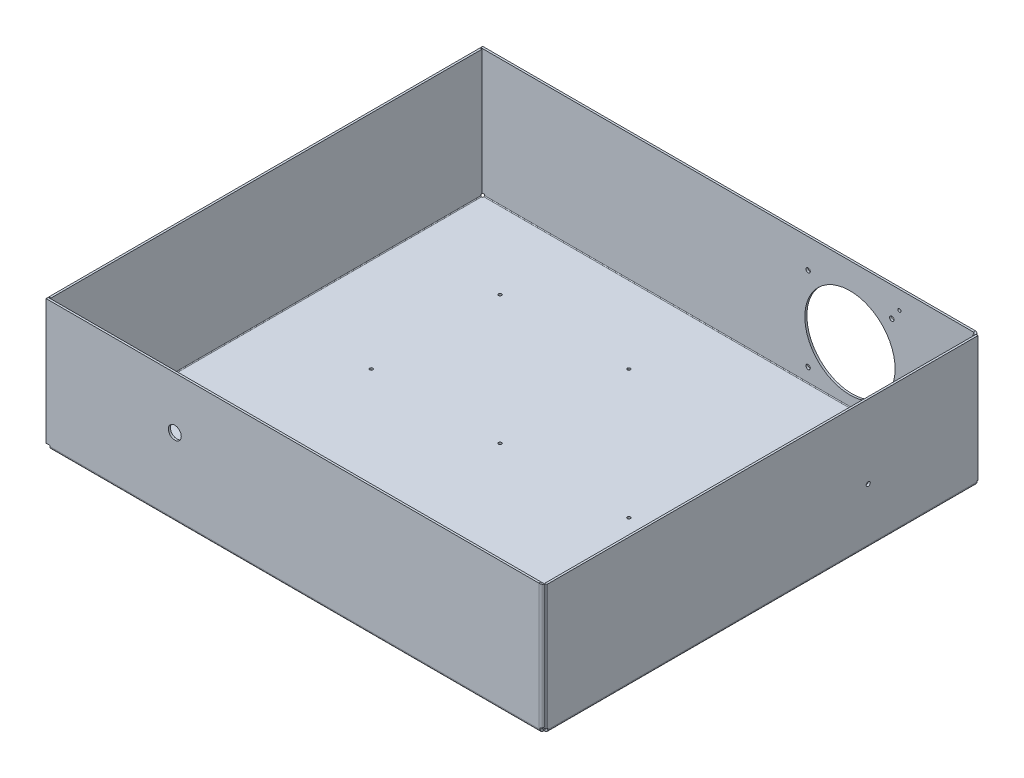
ISO-10303-21;
HEADER;
FILE_DESCRIPTION(('STEP AP214'),'2;1');
FILE_NAME('part.step','',(''),(''),'','','');
FILE_SCHEMA(('AUTOMOTIVE_DESIGN { 1 0 10303 214 1 1 1 1 }'));
ENDSEC;
DATA;
#1=APPLICATION_CONTEXT('core data for automotive mechanical design processes');
#2=APPLICATION_PROTOCOL_DEFINITION('international standard','automotive_design',2000,#1);
#3=PRODUCT_CONTEXT('',#1,'mechanical');
#4=PRODUCT('Part','Part','',(#3));
#5=PRODUCT_RELATED_PRODUCT_CATEGORY('part','',(#4));
#6=PRODUCT_DEFINITION_FORMATION('','',#4);
#7=PRODUCT_DEFINITION_CONTEXT('part definition',#1,'design');
#8=PRODUCT_DEFINITION('design','',#6,#7);
#9=PRODUCT_DEFINITION_SHAPE('','',#8);
#10=(LENGTH_UNIT() NAMED_UNIT(*) SI_UNIT(.MILLI.,.METRE.));
#11=(NAMED_UNIT(*) PLANE_ANGLE_UNIT() SI_UNIT($,.RADIAN.));
#12=(NAMED_UNIT(*) SI_UNIT($,.STERADIAN.) SOLID_ANGLE_UNIT());
#13=UNCERTAINTY_MEASURE_WITH_UNIT(LENGTH_MEASURE(1.E-05),#10,'distance_accuracy_value','');
#14=(GEOMETRIC_REPRESENTATION_CONTEXT(3) GLOBAL_UNCERTAINTY_ASSIGNED_CONTEXT((#13)) GLOBAL_UNIT_ASSIGNED_CONTEXT((#10,
#11,#12)) REPRESENTATION_CONTEXT('',''));
#15=CARTESIAN_POINT('',(0.,0.,0.));
#16=DIRECTION('',(0.,0.,1.));
#17=DIRECTION('',(1.,0.,0.));
#18=AXIS2_PLACEMENT_3D('',#15,#16,#17);
#19=CARTESIAN_POINT('',(-381.,127.254,799.88229945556));
#20=DIRECTION('',(0.,-1.,0.));
#21=DIRECTION('',(0.,0.,-1.));
#22=AXIS2_PLACEMENT_3D('',#19,#20,#21);
#23=PLANE('',#22);
#24=DIRECTION('',(0.,0.,-1.));
#25=VECTOR('',#24,1.);
#26=CARTESIAN_POINT('',(104.987179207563,127.254,-213.268516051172));
#27=LINE('',#26,#25);
#28=CARTESIAN_POINT('',(104.987179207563,127.254,-213.268516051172));
#29=VERTEX_POINT('',#28);
#30=CARTESIAN_POINT('',(104.987179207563,127.254,-215.300516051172));
#31=VERTEX_POINT('',#30);
#32=EDGE_CURVE('E469',#29,#31,#27,.T.);
#33=ORIENTED_EDGE('',*,*,#32,.T.);
#34=DIRECTION('',(-1.,0.,0.));
#35=VECTOR('',#34,1.);
#36=CARTESIAN_POINT('',(-381.,127.254,-215.300516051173));
#37=LINE('',#36,#35);
#38=CARTESIAN_POINT('',(-381.,127.254,-215.300516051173));
#39=VERTEX_POINT('',#38);
#40=EDGE_CURVE('E1020',#31,#39,#37,.T.);
#41=ORIENTED_EDGE('',*,*,#40,.T.);
#42=DIRECTION('',(0.,0.,-1.));
#43=VECTOR('',#42,1.);
#44=CARTESIAN_POINT('',(-381.,127.254,799.88229945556));
#45=LINE('',#44,#43);
#46=CARTESIAN_POINT('',(-381.,127.254,-213.268516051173));
#47=VERTEX_POINT('',#46);
#48=EDGE_CURVE('E1011',#47,#39,#45,.T.);
#49=ORIENTED_EDGE('',*,*,#48,.F.);
#50=DIRECTION('',(-1.,0.,0.));
#51=VECTOR('',#50,1.);
#52=CARTESIAN_POINT('',(-381.,127.254,-213.268516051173));
#53=LINE('',#52,#51);
#54=EDGE_CURVE('E979',#29,#47,#53,.T.);
#55=ORIENTED_EDGE('',*,*,#54,.F.);
#56=EDGE_LOOP('',(#33,#41,#49,#55));
#57=FACE_BOUND('',#56,.T.);
#58=ADVANCED_FACE('F75',(#57),#23,.F.);
#59=CARTESIAN_POINT('',(-381.,127.254,-215.300516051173));
#60=DIRECTION('',(0.,0.,1.));
#61=DIRECTION('',(1.,0.,0.));
#62=AXIS2_PLACEMENT_3D('',#59,#60,#61);
#63=PLANE('',#62);
#64=CARTESIAN_POINT('',(-58.2082207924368,98.3986081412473,-215.300516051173));
#65=DIRECTION('',(0.,0.,1.));
#66=DIRECTION('',(1.,0.,0.));
#67=AXIS2_PLACEMENT_3D('',#64,#65,#66);
#68=CIRCLE('',#67,2.14999999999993);
#69=CARTESIAN_POINT('',(-56.0582207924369,98.3986081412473,-215.300516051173));
#70=VERTEX_POINT('',#69);
#71=EDGE_CURVE('E1217',#70,#70,#68,.T.);
#72=ORIENTED_EDGE('',*,*,#71,.T.);
#73=EDGE_LOOP('',(#72));
#74=FACE_BOUND('',#73,.T.);
#75=CARTESIAN_POINT('',(-58.2082207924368,15.8986081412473,-215.300516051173));
#76=DIRECTION('',(0.,0.,1.));
#77=DIRECTION('',(1.,0.,0.));
#78=AXIS2_PLACEMENT_3D('',#75,#76,#77);
#79=CIRCLE('',#78,2.1499999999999);
#80=CARTESIAN_POINT('',(-56.0582207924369,15.8986081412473,-215.300516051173));
#81=VERTEX_POINT('',#80);
#82=EDGE_CURVE('E1213',#81,#81,#79,.T.);
#83=ORIENTED_EDGE('',*,*,#82,.T.);
#84=EDGE_LOOP('',(#83));
#85=FACE_BOUND('',#84,.T.);
#86=CARTESIAN_POINT('',(24.2917792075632,15.8986081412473,-215.300516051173));
#87=DIRECTION('',(0.,0.,1.));
#88=DIRECTION('',(1.,0.,0.));
#89=AXIS2_PLACEMENT_3D('',#86,#87,#88);
#90=CIRCLE('',#89,2.1499999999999);
#91=CARTESIAN_POINT('',(26.4417792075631,15.8986081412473,-215.300516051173));
#92=VERTEX_POINT('',#91);
#93=EDGE_CURVE('E1209',#92,#92,#90,.T.);
#94=ORIENTED_EDGE('',*,*,#93,.T.);
#95=EDGE_LOOP('',(#94));
#96=FACE_BOUND('',#95,.T.);
#97=CARTESIAN_POINT('',(24.2917792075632,98.3986081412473,-215.300516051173));
#98=DIRECTION('',(0.,0.,1.));
#99=DIRECTION('',(1.,0.,0.));
#100=AXIS2_PLACEMENT_3D('',#97,#98,#99);
#101=CIRCLE('',#100,2.14999999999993);
#102=CARTESIAN_POINT('',(26.4417792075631,98.3986081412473,-215.300516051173));
#103=VERTEX_POINT('',#102);
#104=EDGE_CURVE('E1205',#103,#103,#101,.T.);
#105=ORIENTED_EDGE('',*,*,#104,.T.);
#106=EDGE_LOOP('',(#105));
#107=FACE_BOUND('',#106,.T.);
#108=CARTESIAN_POINT('',(-16.9582207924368,57.1486081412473,-215.300516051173));
#109=DIRECTION('',(0.,0.,1.));
#110=DIRECTION('',(1.,0.,0.));
#111=AXIS2_PLACEMENT_3D('',#108,#109,#110);
#112=CIRCLE('',#111,44.4999999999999);
#113=CARTESIAN_POINT('',(27.5417792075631,57.1486081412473,-215.300516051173));
#114=VERTEX_POINT('',#113);
#115=EDGE_CURVE('E461',#114,#114,#112,.T.);
#116=ORIENTED_EDGE('',*,*,#115,.T.);
#117=EDGE_LOOP('',(#116));
#118=FACE_BOUND('',#117,.T.);
#119=CARTESIAN_POINT('',(31.8097792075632,109.254,-215.300516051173));
#120=DIRECTION('',(0.,0.,-1.));
#121=DIRECTION('',(-1.,0.,0.));
#122=AXIS2_PLACEMENT_3D('',#119,#120,#121);
#123=CIRCLE('',#122,1.52400000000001);
#124=CARTESIAN_POINT('',(30.2857792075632,109.254,-215.300516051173));
#125=VERTEX_POINT('',#124);
#126=EDGE_CURVE('E1003',#125,#125,#123,.T.);
#127=ORIENTED_EDGE('',*,*,#126,.F.);
#128=EDGE_LOOP('',(#127));
#129=FACE_BOUND('',#128,.T.);
#130=DIRECTION('',(0.,1.,0.));
#131=VECTOR('',#130,1.);
#132=CARTESIAN_POINT('',(104.987179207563,127.254,-215.300516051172));
#133=LINE('',#132,#131);
#134=CARTESIAN_POINT('',(104.987179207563,3.78460000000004,-215.300516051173));
#135=VERTEX_POINT('',#134);
#136=EDGE_CURVE('E415',#31,#135,#133,.F.);
#137=ORIENTED_EDGE('',*,*,#136,.T.);
#138=DIRECTION('',(-1.,0.,0.));
#139=VECTOR('',#138,1.);
#140=CARTESIAN_POINT('',(-381.,3.78460000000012,-215.300516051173));
#141=LINE('',#140,#139);
#142=CARTESIAN_POINT('',(106.257179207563,3.78460000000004,-215.300516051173));
#143=VERTEX_POINT('',#142);
#144=EDGE_CURVE('E1188',#143,#135,#141,.T.);
#145=ORIENTED_EDGE('',*,*,#144,.F.);
#146=DIRECTION('',(0.,1.,0.));
#147=VECTOR('',#146,1.);
#148=CARTESIAN_POINT('',(106.257179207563,127.254,-215.300516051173));
#149=LINE('',#148,#147);
#150=CARTESIAN_POINT('',(106.257179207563,2.76860000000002,-215.300516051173));
#151=VERTEX_POINT('',#150);
#152=EDGE_CURVE('E995',#151,#143,#149,.T.);
#153=ORIENTED_EDGE('',*,*,#152,.F.);
#154=DIRECTION('',(-1.,0.,0.));
#155=VECTOR('',#154,1.);
#156=CARTESIAN_POINT('',(106.257179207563,2.76860000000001,-215.300516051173));
#157=LINE('',#156,#155);
#158=CARTESIAN_POINT('',(-377.2154,2.76860000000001,-215.300516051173));
#159=VERTEX_POINT('',#158);
#160=EDGE_CURVE('E992',#151,#159,#157,.T.);
#161=ORIENTED_EDGE('',*,*,#160,.T.);
#162=DIRECTION('',(0.,-1.,0.));
#163=VECTOR('',#162,1.);
#164=CARTESIAN_POINT('',(-377.2154,127.254,-215.300516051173));
#165=LINE('',#164,#163);
#166=CARTESIAN_POINT('',(-377.2154,3.7846,-215.300516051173));
#167=VERTEX_POINT('',#166);
#168=EDGE_CURVE('E984',#167,#159,#165,.T.);
#169=ORIENTED_EDGE('',*,*,#168,.F.);
#170=DIRECTION('',(-1.,0.,0.));
#171=VECTOR('',#170,1.);
#172=CARTESIAN_POINT('',(-381.,3.7846,-215.300516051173));
#173=LINE('',#172,#171);
#174=CARTESIAN_POINT('',(-381.,3.7846,-215.300516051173));
#175=VERTEX_POINT('',#174);
#176=EDGE_CURVE('E990',#167,#175,#173,.T.);
#177=ORIENTED_EDGE('',*,*,#176,.T.);
#178=DIRECTION('',(0.,-1.,0.));
#179=VECTOR('',#178,1.);
#180=CARTESIAN_POINT('',(-381.,127.254,-215.300516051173));
#181=LINE('',#180,#179);
#182=EDGE_CURVE('E1017',#39,#175,#181,.T.);
#183=ORIENTED_EDGE('',*,*,#182,.F.);
#184=ORIENTED_EDGE('',*,*,#40,.F.);
#185=EDGE_LOOP('',(#137,#145,#153,#161,#169,#177,#183,#184));
#186=FACE_BOUND('',#185,.T.);
#187=ADVANCED_FACE('F1123',(#74,#85,#96,#107,#118,#129,#186),#63,.F.);
#188=CARTESIAN_POINT('',(-381.,127.254,-213.268516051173));
#189=DIRECTION('',(0.,0.,1.));
#190=DIRECTION('',(1.,0.,0.));
#191=AXIS2_PLACEMENT_3D('',#188,#189,#190);
#192=PLANE('',#191);
#193=CARTESIAN_POINT('',(-58.2082207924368,98.3986081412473,-213.268516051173));
#194=DIRECTION('',(0.,0.,1.));
#195=DIRECTION('',(1.,0.,0.));
#196=AXIS2_PLACEMENT_3D('',#193,#194,#195);
#197=CIRCLE('',#196,2.14999999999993);
#198=CARTESIAN_POINT('',(-56.0582207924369,98.3986081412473,-213.268516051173));
#199=VERTEX_POINT('',#198);
#200=EDGE_CURVE('E1165',#199,#199,#197,.T.);
#201=ORIENTED_EDGE('',*,*,#200,.F.);
#202=EDGE_LOOP('',(#201));
#203=FACE_BOUND('',#202,.T.);
#204=CARTESIAN_POINT('',(-58.2082207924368,15.8986081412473,-213.268516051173));
#205=DIRECTION('',(0.,0.,1.));
#206=DIRECTION('',(1.,0.,0.));
#207=AXIS2_PLACEMENT_3D('',#204,#205,#206);
#208=CIRCLE('',#207,2.1499999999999);
#209=CARTESIAN_POINT('',(-56.0582207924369,15.8986081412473,-213.268516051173));
#210=VERTEX_POINT('',#209);
#211=EDGE_CURVE('E1169',#210,#210,#208,.T.);
#212=ORIENTED_EDGE('',*,*,#211,.F.);
#213=EDGE_LOOP('',(#212));
#214=FACE_BOUND('',#213,.T.);
#215=CARTESIAN_POINT('',(24.2917792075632,15.8986081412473,-213.268516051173));
#216=DIRECTION('',(0.,0.,1.));
#217=DIRECTION('',(1.,0.,0.));
#218=AXIS2_PLACEMENT_3D('',#215,#216,#217);
#219=CIRCLE('',#218,2.1499999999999);
#220=CARTESIAN_POINT('',(26.4417792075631,15.8986081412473,-213.268516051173));
#221=VERTEX_POINT('',#220);
#222=EDGE_CURVE('E1173',#221,#221,#219,.T.);
#223=ORIENTED_EDGE('',*,*,#222,.F.);
#224=EDGE_LOOP('',(#223));
#225=FACE_BOUND('',#224,.T.);
#226=CARTESIAN_POINT('',(24.2917792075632,98.3986081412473,-213.268516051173));
#227=DIRECTION('',(0.,0.,1.));
#228=DIRECTION('',(1.,0.,0.));
#229=AXIS2_PLACEMENT_3D('',#226,#227,#228);
#230=CIRCLE('',#229,2.14999999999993);
#231=CARTESIAN_POINT('',(26.4417792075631,98.3986081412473,-213.268516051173));
#232=VERTEX_POINT('',#231);
#233=EDGE_CURVE('E1177',#232,#232,#230,.T.);
#234=ORIENTED_EDGE('',*,*,#233,.F.);
#235=EDGE_LOOP('',(#234));
#236=FACE_BOUND('',#235,.T.);
#237=CARTESIAN_POINT('',(-16.9582207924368,57.1486081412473,-213.268516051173));
#238=DIRECTION('',(0.,0.,1.));
#239=DIRECTION('',(1.,0.,0.));
#240=AXIS2_PLACEMENT_3D('',#237,#238,#239);
#241=CIRCLE('',#240,44.4999999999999);
#242=CARTESIAN_POINT('',(27.5417792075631,57.1486081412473,-213.268516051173));
#243=VERTEX_POINT('',#242);
#244=EDGE_CURVE('E1181',#243,#243,#241,.T.);
#245=ORIENTED_EDGE('',*,*,#244,.F.);
#246=EDGE_LOOP('',(#245));
#247=FACE_BOUND('',#246,.T.);
#248=CARTESIAN_POINT('',(31.8097792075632,109.254,-213.268516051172));
#249=DIRECTION('',(0.,0.,1.));
#250=DIRECTION('',(1.,0.,0.));
#251=AXIS2_PLACEMENT_3D('',#248,#249,#250);
#252=CIRCLE('',#251,1.52400000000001);
#253=CARTESIAN_POINT('',(33.3337792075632,109.254,-213.268516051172));
#254=VERTEX_POINT('',#253);
#255=EDGE_CURVE('E14',#254,#254,#252,.F.);
#256=ORIENTED_EDGE('',*,*,#255,.T.);
#257=EDGE_LOOP('',(#256));
#258=FACE_BOUND('',#257,.T.);
#259=DIRECTION('',(1.,0.,0.));
#260=VECTOR('',#259,1.);
#261=CARTESIAN_POINT('',(104.987179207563,3.78460000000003,-213.268516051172));
#262=LINE('',#261,#260);
#263=CARTESIAN_POINT('',(104.987179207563,3.78460000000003,-213.268516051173));
#264=VERTEX_POINT('',#263);
#265=CARTESIAN_POINT('',(106.257179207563,3.78460000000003,-213.268516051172));
#266=VERTEX_POINT('',#265);
#267=EDGE_CURVE('E468',#264,#266,#262,.T.);
#268=ORIENTED_EDGE('',*,*,#267,.F.);
#269=DIRECTION('',(0.,1.,0.));
#270=VECTOR('',#269,1.);
#271=CARTESIAN_POINT('',(104.987179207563,127.254,-213.268516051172));
#272=LINE('',#271,#270);
#273=EDGE_CURVE('E462',#29,#264,#272,.F.);
#274=ORIENTED_EDGE('',*,*,#273,.F.);
#275=ORIENTED_EDGE('',*,*,#54,.T.);
#276=DIRECTION('',(0.,1.,0.));
#277=VECTOR('',#276,1.);
#278=CARTESIAN_POINT('',(-381.,2.03200000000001,-213.268516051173));
#279=LINE('',#278,#277);
#280=CARTESIAN_POINT('',(-381.,3.7846,-213.268516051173));
#281=VERTEX_POINT('',#280);
#282=EDGE_CURVE('E1014',#281,#47,#279,.T.);
#283=ORIENTED_EDGE('',*,*,#282,.F.);
#284=DIRECTION('',(-1.,0.,0.));
#285=VECTOR('',#284,1.);
#286=CARTESIAN_POINT('',(-381.,3.7846,-213.268516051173));
#287=LINE('',#286,#285);
#288=CARTESIAN_POINT('',(-377.2154,3.7846,-213.268516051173));
#289=VERTEX_POINT('',#288);
#290=EDGE_CURVE('E1009',#289,#281,#287,.T.);
#291=ORIENTED_EDGE('',*,*,#290,.F.);
#292=DIRECTION('',(0.,-1.,0.));
#293=VECTOR('',#292,1.);
#294=CARTESIAN_POINT('',(-377.2154,127.254,-213.268516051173));
#295=LINE('',#294,#293);
#296=CARTESIAN_POINT('',(-377.2154,2.76859999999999,-213.268516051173));
#297=VERTEX_POINT('',#296);
#298=EDGE_CURVE('E84',#289,#297,#295,.T.);
#299=ORIENTED_EDGE('',*,*,#298,.T.);
#300=DIRECTION('',(-1.,0.,0.));
#301=VECTOR('',#300,1.);
#302=CARTESIAN_POINT('',(106.257179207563,2.76860000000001,-213.268516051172));
#303=LINE('',#302,#301);
#304=CARTESIAN_POINT('',(106.257179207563,2.76860000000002,-213.268516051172));
#305=VERTEX_POINT('',#304);
#306=EDGE_CURVE('E915',#305,#297,#303,.T.);
#307=ORIENTED_EDGE('',*,*,#306,.F.);
#308=DIRECTION('',(0.,1.,0.));
#309=VECTOR('',#308,1.);
#310=CARTESIAN_POINT('',(106.257179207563,127.254,-213.268516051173));
#311=LINE('',#310,#309);
#312=EDGE_CURVE('E981',#305,#266,#311,.T.);
#313=ORIENTED_EDGE('',*,*,#312,.T.);
#314=EDGE_LOOP('',(#268,#274,#275,#283,#291,#299,#307,#313));
#315=FACE_BOUND('',#314,.T.);
#316=ADVANCED_FACE('F1129',(#203,#214,#225,#236,#247,#258,#315),#192,.T.);
#317=CARTESIAN_POINT('',(-381.,127.254,-799.88229945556));
#318=DIRECTION('',(0.,-1.,0.));
#319=DIRECTION('',(0.,0.,-1.));
#320=AXIS2_PLACEMENT_3D('',#317,#318,#319);
#321=PLANE('',#320);
#322=DIRECTION('',(0.,0.,1.));
#323=VECTOR('',#322,1.);
#324=CARTESIAN_POINT('',(104.987179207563,127.254,213.268516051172));
#325=LINE('',#324,#323);
#326=CARTESIAN_POINT('',(104.987179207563,127.254,213.268516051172));
#327=VERTEX_POINT('',#326);
#328=CARTESIAN_POINT('',(104.987179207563,127.254,215.300516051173));
#329=VERTEX_POINT('',#328);
#330=EDGE_CURVE('E599',#327,#329,#325,.T.);
#331=ORIENTED_EDGE('',*,*,#330,.F.);
#332=DIRECTION('',(1.,0.,0.));
#333=VECTOR('',#332,1.);
#334=CARTESIAN_POINT('',(-381.,127.254,213.268516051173));
#335=LINE('',#334,#333);
#336=CARTESIAN_POINT('',(-381.,127.254,213.268516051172));
#337=VERTEX_POINT('',#336);
#338=EDGE_CURVE('E863',#337,#327,#335,.T.);
#339=ORIENTED_EDGE('',*,*,#338,.F.);
#340=DIRECTION('',(0.,0.,1.));
#341=VECTOR('',#340,1.);
#342=CARTESIAN_POINT('',(-381.,127.254,-799.88229945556));
#343=LINE('',#342,#341);
#344=CARTESIAN_POINT('',(-381.,127.254,215.300516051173));
#345=VERTEX_POINT('',#344);
#346=EDGE_CURVE('E902',#337,#345,#343,.T.);
#347=ORIENTED_EDGE('',*,*,#346,.T.);
#348=DIRECTION('',(1.,0.,0.));
#349=VECTOR('',#348,1.);
#350=CARTESIAN_POINT('',(-381.,127.254,215.300516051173));
#351=LINE('',#350,#349);
#352=EDGE_CURVE('E899',#345,#329,#351,.T.);
#353=ORIENTED_EDGE('',*,*,#352,.T.);
#354=EDGE_LOOP('',(#331,#339,#347,#353));
#355=FACE_BOUND('',#354,.T.);
#356=ADVANCED_FACE('F1139',(#355),#321,.F.);
#357=CARTESIAN_POINT('',(-381.,2.03200000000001,799.88229945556));
#358=DIRECTION('',(-1.,0.,0.));
#359=DIRECTION('',(0.,-1.,0.));
#360=AXIS2_PLACEMENT_3D('',#357,#358,#359);
#361=PLANE('',#360);
#362=ORIENTED_EDGE('',*,*,#182,.T.);
#363=DIRECTION('',(0.,0.,-1.));
#364=VECTOR('',#363,1.);
#365=CARTESIAN_POINT('',(-381.,3.7846,799.88229945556));
#366=LINE('',#365,#364);
#367=EDGE_CURVE('E1006',#281,#175,#366,.T.);
#368=ORIENTED_EDGE('',*,*,#367,.F.);
#369=ORIENTED_EDGE('',*,*,#282,.T.);
#370=ORIENTED_EDGE('',*,*,#48,.T.);
#371=EDGE_LOOP('',(#362,#368,#369,#370));
#372=FACE_BOUND('',#371,.T.);
#373=ADVANCED_FACE('F1135',(#372),#361,.T.);
#374=CARTESIAN_POINT('',(-381.,3.7846,799.88229945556));
#375=DIRECTION('',(0.,-1.,0.));
#376=DIRECTION('',(0.,0.,-1.));
#377=AXIS2_PLACEMENT_3D('',#374,#375,#376);
#378=PLANE('',#377);
#379=ORIENTED_EDGE('',*,*,#176,.F.);
#380=DIRECTION('',(0.,0.,-1.));
#381=VECTOR('',#380,1.);
#382=CARTESIAN_POINT('',(-377.2154,3.7846,799.88229945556));
#383=LINE('',#382,#381);
#384=EDGE_CURVE('E987',#289,#167,#383,.T.);
#385=ORIENTED_EDGE('',*,*,#384,.F.);
#386=ORIENTED_EDGE('',*,*,#290,.T.);
#387=ORIENTED_EDGE('',*,*,#367,.T.);
#388=EDGE_LOOP('',(#379,#385,#386,#387));
#389=FACE_BOUND('',#388,.T.);
#390=ADVANCED_FACE('F1138',(#389),#378,.T.);
#391=CARTESIAN_POINT('',(31.8097792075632,109.254,215.301516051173));
#392=DIRECTION('',(0.,0.,-1.));
#393=DIRECTION('',(-1.,0.,0.));
#394=AXIS2_PLACEMENT_3D('',#391,#392,#393);
#395=CYLINDRICAL_SURFACE('',#394,1.52400000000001);
#396=ORIENTED_EDGE('',*,*,#255,.F.);
#397=EDGE_LOOP('',(#396));
#398=FACE_BOUND('',#397,.T.);
#399=ORIENTED_EDGE('',*,*,#126,.T.);
#400=EDGE_LOOP('',(#399));
#401=FACE_BOUND('',#400,.T.);
#402=ADVANCED_FACE('F1143',(#398,#401),#395,.F.);
#403=CARTESIAN_POINT('',(106.257179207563,127.254,799.88229945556));
#404=DIRECTION('',(-1.,0.,0.));
#405=DIRECTION('',(0.,-1.,0.));
#406=AXIS2_PLACEMENT_3D('',#403,#404,#405);
#407=PLANE('',#406);
#408=DIRECTION('',(0.,0.,-1.));
#409=VECTOR('',#408,1.);
#410=CARTESIAN_POINT('',(106.257179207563,2.76860000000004,799.88229945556));
#411=LINE('',#410,#409);
#412=EDGE_CURVE('E998',#305,#151,#411,.T.);
#413=ORIENTED_EDGE('',*,*,#412,.T.);
#414=ORIENTED_EDGE('',*,*,#152,.T.);
#415=DIRECTION('',(0.,0.,-1.));
#416=VECTOR('',#415,1.);
#417=CARTESIAN_POINT('',(106.257179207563,3.78460000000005,799.88229945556));
#418=LINE('',#417,#416);
#419=EDGE_CURVE('E1001',#266,#143,#418,.T.);
#420=ORIENTED_EDGE('',*,*,#419,.F.);
#421=ORIENTED_EDGE('',*,*,#312,.F.);
#422=EDGE_LOOP('',(#413,#414,#420,#421));
#423=FACE_BOUND('',#422,.T.);
#424=ADVANCED_FACE('F1147',(#423),#407,.F.);
#425=CARTESIAN_POINT('',(-377.2154,127.254,799.88229945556));
#426=DIRECTION('',(1.,0.,0.));
#427=DIRECTION('',(0.,1.,0.));
#428=AXIS2_PLACEMENT_3D('',#425,#426,#427);
#429=PLANE('',#428);
#430=ORIENTED_EDGE('',*,*,#384,.T.);
#431=ORIENTED_EDGE('',*,*,#168,.T.);
#432=DIRECTION('',(0.,0.,-1.));
#433=VECTOR('',#432,1.);
#434=CARTESIAN_POINT('',(-377.2154,2.76860000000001,799.88229945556));
#435=LINE('',#434,#433);
#436=EDGE_CURVE('E1022',#297,#159,#435,.T.);
#437=ORIENTED_EDGE('',*,*,#436,.F.);
#438=ORIENTED_EDGE('',*,*,#298,.F.);
#439=EDGE_LOOP('',(#430,#431,#437,#438));
#440=FACE_BOUND('',#439,.T.);
#441=ADVANCED_FACE('F1150',(#440),#429,.F.);
#442=CARTESIAN_POINT('',(-777.72763621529,2.03199999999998,212.506516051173));
#443=DIRECTION('',(0.,0.,-1.));
#444=DIRECTION('',(0.,-1.,0.));
#445=AXIS2_PLACEMENT_3D('',#442,#443,#444);
#446=PLANE('',#445);
#447=DIRECTION('',(1.,0.,0.));
#448=VECTOR('',#447,1.);
#449=CARTESIAN_POINT('',(-777.72763621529,3.78459999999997,212.506516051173));
#450=LINE('',#449,#448);
#451=CARTESIAN_POINT('',(108.009779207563,3.78459999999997,212.506516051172));
#452=VERTEX_POINT('',#451);
#453=CARTESIAN_POINT('',(110.041779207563,3.78459999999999,212.506516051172));
#454=VERTEX_POINT('',#453);
#455=EDGE_CURVE('E970',#452,#454,#450,.T.);
#456=ORIENTED_EDGE('',*,*,#455,.T.);
#457=DIRECTION('',(0.,1.,0.));
#458=VECTOR('',#457,1.);
#459=CARTESIAN_POINT('',(110.041779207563,2.03199999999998,212.506516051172));
#460=LINE('',#459,#458);
#461=CARTESIAN_POINT('',(110.041779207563,127.254,212.506516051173));
#462=VERTEX_POINT('',#461);
#463=EDGE_CURVE('E967',#454,#462,#460,.T.);
#464=ORIENTED_EDGE('',*,*,#463,.T.);
#465=DIRECTION('',(1.,0.,0.));
#466=VECTOR('',#465,1.);
#467=CARTESIAN_POINT('',(-777.72763621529,127.254,212.506516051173));
#468=LINE('',#467,#466);
#469=CARTESIAN_POINT('',(108.009779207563,127.254,212.506516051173));
#470=VERTEX_POINT('',#469);
#471=EDGE_CURVE('E964',#470,#462,#468,.T.);
#472=ORIENTED_EDGE('',*,*,#471,.F.);
#473=DIRECTION('',(0.,1.,0.));
#474=VECTOR('',#473,1.);
#475=CARTESIAN_POINT('',(108.009779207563,2.03199999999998,212.506516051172));
#476=LINE('',#475,#474);
#477=EDGE_CURVE('E919',#452,#470,#476,.T.);
#478=ORIENTED_EDGE('',*,*,#477,.F.);
#479=EDGE_LOOP('',(#456,#464,#472,#478));
#480=FACE_BOUND('',#479,.T.);
#481=ADVANCED_FACE('F1111',(#480),#446,.F.);
#482=CARTESIAN_POINT('',(-777.72763621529,127.254,-215.300516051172));
#483=DIRECTION('',(0.,-1.,0.));
#484=DIRECTION('',(1.,0.,0.));
#485=AXIS2_PLACEMENT_3D('',#482,#483,#484);
#486=PLANE('',#485);
#487=ORIENTED_EDGE('',*,*,#471,.T.);
#488=DIRECTION('',(0.,0.,-1.));
#489=VECTOR('',#488,1.);
#490=CARTESIAN_POINT('',(110.041779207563,127.254,-215.300516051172));
#491=LINE('',#490,#489);
#492=CARTESIAN_POINT('',(110.041779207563,127.254,-212.506516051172));
#493=VERTEX_POINT('',#492);
#494=EDGE_CURVE('E961',#462,#493,#491,.T.);
#495=ORIENTED_EDGE('',*,*,#494,.T.);
#496=DIRECTION('',(1.,0.,0.));
#497=VECTOR('',#496,1.);
#498=CARTESIAN_POINT('',(-777.72763621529,127.254,-212.506516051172));
#499=LINE('',#498,#497);
#500=CARTESIAN_POINT('',(108.009779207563,127.254,-212.506516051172));
#501=VERTEX_POINT('',#500);
#502=EDGE_CURVE('E956',#501,#493,#499,.T.);
#503=ORIENTED_EDGE('',*,*,#502,.F.);
#504=DIRECTION('',(0.,0.,-1.));
#505=VECTOR('',#504,1.);
#506=CARTESIAN_POINT('',(108.009779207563,127.254,-215.300516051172));
#507=LINE('',#506,#505);
#508=EDGE_CURVE('E916',#470,#501,#507,.T.);
#509=ORIENTED_EDGE('',*,*,#508,.F.);
#510=EDGE_LOOP('',(#487,#495,#503,#509));
#511=FACE_BOUND('',#510,.T.);
#512=ADVANCED_FACE('F1107',(#511),#486,.F.);
#513=CARTESIAN_POINT('',(-777.72763621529,2.03200000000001,-212.506516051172));
#514=DIRECTION('',(0.,0.,-1.));
#515=DIRECTION('',(0.,-1.,0.));
#516=AXIS2_PLACEMENT_3D('',#513,#514,#515);
#517=PLANE('',#516);
#518=DIRECTION('',(0.,1.,0.));
#519=VECTOR('',#518,1.);
#520=CARTESIAN_POINT('',(110.041779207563,2.03200000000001,-212.506516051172));
#521=LINE('',#520,#519);
#522=CARTESIAN_POINT('',(110.041779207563,3.78460000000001,-212.506516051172));
#523=VERTEX_POINT('',#522);
#524=EDGE_CURVE('E933',#523,#493,#521,.T.);
#525=ORIENTED_EDGE('',*,*,#524,.F.);
#526=DIRECTION('',(1.,0.,0.));
#527=VECTOR('',#526,1.);
#528=CARTESIAN_POINT('',(-777.72763621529,3.7846,-212.506516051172));
#529=LINE('',#528,#527);
#530=CARTESIAN_POINT('',(108.009779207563,3.7846,-212.506516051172));
#531=VERTEX_POINT('',#530);
#532=EDGE_CURVE('E951',#531,#523,#529,.T.);
#533=ORIENTED_EDGE('',*,*,#532,.F.);
#534=DIRECTION('',(0.,1.,0.));
#535=VECTOR('',#534,1.);
#536=CARTESIAN_POINT('',(108.009779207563,2.03200000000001,-212.506516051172));
#537=LINE('',#536,#535);
#538=EDGE_CURVE('E959',#531,#501,#537,.T.);
#539=ORIENTED_EDGE('',*,*,#538,.T.);
#540=ORIENTED_EDGE('',*,*,#502,.T.);
#541=EDGE_LOOP('',(#525,#533,#539,#540));
#542=FACE_BOUND('',#541,.T.);
#543=ADVANCED_FACE('F1104',(#542),#517,.T.);
#544=CARTESIAN_POINT('',(-777.72763621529,3.7846,-215.300516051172));
#545=DIRECTION('',(0.,-1.,0.));
#546=DIRECTION('',(1.,0.,0.));
#547=AXIS2_PLACEMENT_3D('',#544,#545,#546);
#548=PLANE('',#547);
#549=DIRECTION('',(0.,0.,-1.));
#550=VECTOR('',#549,1.);
#551=CARTESIAN_POINT('',(110.041779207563,3.78460000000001,-215.300516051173));
#552=LINE('',#551,#550);
#553=CARTESIAN_POINT('',(110.041779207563,3.7846,-211.515916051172));
#554=VERTEX_POINT('',#553);
#555=EDGE_CURVE('E935',#554,#523,#552,.T.);
#556=ORIENTED_EDGE('',*,*,#555,.F.);
#557=DIRECTION('',(1.,0.,0.));
#558=VECTOR('',#557,1.);
#559=CARTESIAN_POINT('',(-777.72763621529,3.7846,-211.515916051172));
#560=LINE('',#559,#558);
#561=CARTESIAN_POINT('',(108.009779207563,3.7846,-211.515916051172));
#562=VERTEX_POINT('',#561);
#563=EDGE_CURVE('E928',#562,#554,#560,.T.);
#564=ORIENTED_EDGE('',*,*,#563,.F.);
#565=DIRECTION('',(0.,0.,-1.));
#566=VECTOR('',#565,1.);
#567=CARTESIAN_POINT('',(108.009779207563,3.7846,-215.300516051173));
#568=LINE('',#567,#566);
#569=EDGE_CURVE('E954',#562,#531,#568,.T.);
#570=ORIENTED_EDGE('',*,*,#569,.T.);
#571=ORIENTED_EDGE('',*,*,#532,.T.);
#572=EDGE_LOOP('',(#556,#564,#570,#571));
#573=FACE_BOUND('',#572,.T.);
#574=ADVANCED_FACE('F1100',(#573),#548,.T.);
#575=CARTESIAN_POINT('',(-777.72763621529,3.7846,-215.300516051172));
#576=DIRECTION('',(0.,-1.,0.));
#577=DIRECTION('',(1.,0.,0.));
#578=AXIS2_PLACEMENT_3D('',#575,#576,#577);
#579=PLANE('',#578);
#580=DIRECTION('',(0.,0.,-1.));
#581=VECTOR('',#580,1.);
#582=CARTESIAN_POINT('',(110.041779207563,3.78460000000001,-215.300516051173));
#583=LINE('',#582,#581);
#584=CARTESIAN_POINT('',(110.041779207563,3.78459999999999,211.515916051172));
#585=VERTEX_POINT('',#584);
#586=EDGE_CURVE('E931',#454,#585,#583,.T.);
#587=ORIENTED_EDGE('',*,*,#586,.F.);
#588=ORIENTED_EDGE('',*,*,#455,.F.);
#589=DIRECTION('',(0.,0.,-1.));
#590=VECTOR('',#589,1.);
#591=CARTESIAN_POINT('',(108.009779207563,3.7846,-215.300516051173));
#592=LINE('',#591,#590);
#593=CARTESIAN_POINT('',(108.009779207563,3.78459999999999,211.515916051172));
#594=VERTEX_POINT('',#593);
#595=EDGE_CURVE('E949',#452,#594,#592,.T.);
#596=ORIENTED_EDGE('',*,*,#595,.T.);
#597=DIRECTION('',(1.,0.,0.));
#598=VECTOR('',#597,1.);
#599=CARTESIAN_POINT('',(-777.72763621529,3.78459999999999,211.515916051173));
#600=LINE('',#599,#598);
#601=EDGE_CURVE('E946',#594,#585,#600,.T.);
#602=ORIENTED_EDGE('',*,*,#601,.T.);
#603=EDGE_LOOP('',(#587,#588,#596,#602));
#604=FACE_BOUND('',#603,.T.);
#605=ADVANCED_FACE('F1113',(#604),#579,.T.);
#606=CARTESIAN_POINT('',(-777.72763621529,127.254,211.515916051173));
#607=DIRECTION('',(0.,0.,-1.));
#608=DIRECTION('',(0.,-1.,0.));
#609=AXIS2_PLACEMENT_3D('',#606,#607,#608);
#610=PLANE('',#609);
#611=DIRECTION('',(1.,0.,0.));
#612=VECTOR('',#611,1.);
#613=CARTESIAN_POINT('',(-777.72763621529,2.7686,211.515916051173));
#614=LINE('',#613,#612);
#615=CARTESIAN_POINT('',(108.009779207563,2.76859999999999,211.515916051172));
#616=VERTEX_POINT('',#615);
#617=CARTESIAN_POINT('',(110.041779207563,2.7686,211.515916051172));
#618=VERTEX_POINT('',#617);
#619=EDGE_CURVE('E943',#616,#618,#614,.T.);
#620=ORIENTED_EDGE('',*,*,#619,.T.);
#621=DIRECTION('',(0.,1.,0.));
#622=VECTOR('',#621,1.);
#623=CARTESIAN_POINT('',(110.041779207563,127.254,211.515916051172));
#624=LINE('',#623,#622);
#625=EDGE_CURVE('E940',#618,#585,#624,.T.);
#626=ORIENTED_EDGE('',*,*,#625,.T.);
#627=ORIENTED_EDGE('',*,*,#601,.F.);
#628=DIRECTION('',(0.,1.,0.));
#629=VECTOR('',#628,1.);
#630=CARTESIAN_POINT('',(108.009779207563,127.254,211.515916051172));
#631=LINE('',#630,#629);
#632=EDGE_CURVE('E922',#616,#594,#631,.T.);
#633=ORIENTED_EDGE('',*,*,#632,.F.);
#634=EDGE_LOOP('',(#620,#626,#627,#633));
#635=FACE_BOUND('',#634,.T.);
#636=ADVANCED_FACE('F1092',(#635),#610,.F.);
#637=CARTESIAN_POINT('',(110.041779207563,127.254,-215.300516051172));
#638=DIRECTION('',(-1.,0.,0.));
#639=DIRECTION('',(0.,0.,1.));
#640=AXIS2_PLACEMENT_3D('',#637,#638,#639);
#641=PLANE('',#640);
#642=CARTESIAN_POINT('',(110.041779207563,54.5898183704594,-104.281079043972));
#643=DIRECTION('',(-1.,0.,0.));
#644=DIRECTION('',(0.,0.,1.));
#645=AXIS2_PLACEMENT_3D('',#642,#643,#644);
#646=CIRCLE('',#645,2.);
#647=CARTESIAN_POINT('',(110.041779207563,54.5898183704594,-102.281079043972));
#648=VERTEX_POINT('',#647);
#649=EDGE_CURVE('E1227',#648,#648,#646,.F.);
#650=ORIENTED_EDGE('',*,*,#649,.F.);
#651=EDGE_LOOP('',(#650));
#652=FACE_BOUND('',#651,.T.);
#653=ORIENTED_EDGE('',*,*,#625,.F.);
#654=DIRECTION('',(0.,0.,-1.));
#655=VECTOR('',#654,1.);
#656=CARTESIAN_POINT('',(110.041779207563,2.7686,211.515916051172));
#657=LINE('',#656,#655);
#658=CARTESIAN_POINT('',(110.041779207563,2.7686,-211.515916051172));
#659=VERTEX_POINT('',#658);
#660=EDGE_CURVE('E937',#618,#659,#657,.T.);
#661=ORIENTED_EDGE('',*,*,#660,.T.);
#662=DIRECTION('',(0.,-1.,0.));
#663=VECTOR('',#662,1.);
#664=CARTESIAN_POINT('',(110.041779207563,127.254,-211.515916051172));
#665=LINE('',#664,#663);
#666=EDGE_CURVE('E925',#554,#659,#665,.T.);
#667=ORIENTED_EDGE('',*,*,#666,.F.);
#668=ORIENTED_EDGE('',*,*,#555,.T.);
#669=ORIENTED_EDGE('',*,*,#524,.T.);
#670=ORIENTED_EDGE('',*,*,#494,.F.);
#671=ORIENTED_EDGE('',*,*,#463,.F.);
#672=ORIENTED_EDGE('',*,*,#586,.T.);
#673=EDGE_LOOP('',(#653,#661,#667,#668,#669,#670,#671,#672));
#674=FACE_BOUND('',#673,.T.);
#675=ADVANCED_FACE('F1088',(#652,#674),#641,.F.);
#676=CARTESIAN_POINT('',(-777.72763621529,127.254,-211.515916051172));
#677=DIRECTION('',(0.,0.,1.));
#678=DIRECTION('',(0.,1.,0.));
#679=AXIS2_PLACEMENT_3D('',#676,#677,#678);
#680=PLANE('',#679);
#681=ORIENTED_EDGE('',*,*,#563,.T.);
#682=ORIENTED_EDGE('',*,*,#666,.T.);
#683=DIRECTION('',(1.,0.,0.));
#684=VECTOR('',#683,1.);
#685=CARTESIAN_POINT('',(-777.72763621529,2.7686,-211.515916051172));
#686=LINE('',#685,#684);
#687=CARTESIAN_POINT('',(108.009779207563,2.76859999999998,-211.515916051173));
#688=VERTEX_POINT('',#687);
#689=EDGE_CURVE('E973',#688,#659,#686,.T.);
#690=ORIENTED_EDGE('',*,*,#689,.F.);
#691=DIRECTION('',(0.,-1.,0.));
#692=VECTOR('',#691,1.);
#693=CARTESIAN_POINT('',(108.009779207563,127.254,-211.515916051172));
#694=LINE('',#693,#692);
#695=EDGE_CURVE('E912',#562,#688,#694,.T.);
#696=ORIENTED_EDGE('',*,*,#695,.F.);
#697=EDGE_LOOP('',(#681,#682,#690,#696));
#698=FACE_BOUND('',#697,.T.);
#699=ADVANCED_FACE('F1084',(#698),#680,.F.);
#700=CARTESIAN_POINT('',(108.009779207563,127.254,-215.300516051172));
#701=DIRECTION('',(-1.,0.,0.));
#702=DIRECTION('',(0.,0.,1.));
#703=AXIS2_PLACEMENT_3D('',#700,#701,#702);
#704=PLANE('',#703);
#705=CARTESIAN_POINT('',(108.009779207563,54.5898183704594,-104.281079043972));
#706=DIRECTION('',(-1.,0.,0.));
#707=DIRECTION('',(0.,0.,1.));
#708=AXIS2_PLACEMENT_3D('',#705,#706,#707);
#709=CIRCLE('',#708,2.);
#710=CARTESIAN_POINT('',(108.009779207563,54.5898183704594,-102.281079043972));
#711=VERTEX_POINT('',#710);
#712=EDGE_CURVE('E1232',#711,#711,#709,.T.);
#713=ORIENTED_EDGE('',*,*,#712,.F.);
#714=EDGE_LOOP('',(#713));
#715=FACE_BOUND('',#714,.T.);
#716=DIRECTION('',(0.,0.,-1.));
#717=VECTOR('',#716,1.);
#718=CARTESIAN_POINT('',(108.009779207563,2.7686,211.515916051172));
#719=LINE('',#718,#717);
#720=EDGE_CURVE('E859',#616,#688,#719,.T.);
#721=ORIENTED_EDGE('',*,*,#720,.F.);
#722=ORIENTED_EDGE('',*,*,#632,.T.);
#723=ORIENTED_EDGE('',*,*,#595,.F.);
#724=ORIENTED_EDGE('',*,*,#477,.T.);
#725=ORIENTED_EDGE('',*,*,#508,.T.);
#726=ORIENTED_EDGE('',*,*,#538,.F.);
#727=ORIENTED_EDGE('',*,*,#569,.F.);
#728=ORIENTED_EDGE('',*,*,#695,.T.);
#729=EDGE_LOOP('',(#721,#722,#723,#724,#725,#726,#727,#728));
#730=FACE_BOUND('',#729,.T.);
#731=ADVANCED_FACE('F1096',(#715,#730),#704,.T.);
#732=CARTESIAN_POINT('',(-381.,2.03200000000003,-799.88229945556));
#733=DIRECTION('',(1.,0.,0.));
#734=DIRECTION('',(0.,-1.,0.));
#735=AXIS2_PLACEMENT_3D('',#732,#733,#734);
#736=PLANE('',#735);
#737=DIRECTION('',(0.,0.,1.));
#738=VECTOR('',#737,1.);
#739=CARTESIAN_POINT('',(-381.,3.78460000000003,-799.88229945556));
#740=LINE('',#739,#738);
#741=CARTESIAN_POINT('',(-381.,3.78460000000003,213.268516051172));
#742=VERTEX_POINT('',#741);
#743=CARTESIAN_POINT('',(-381.,3.78460000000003,215.300516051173));
#744=VERTEX_POINT('',#743);
#745=EDGE_CURVE('E905',#742,#744,#740,.T.);
#746=ORIENTED_EDGE('',*,*,#745,.T.);
#747=DIRECTION('',(0.,-1.,0.));
#748=VECTOR('',#747,1.);
#749=CARTESIAN_POINT('',(-381.,127.254,215.300516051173));
#750=LINE('',#749,#748);
#751=EDGE_CURVE('E880',#345,#744,#750,.T.);
#752=ORIENTED_EDGE('',*,*,#751,.F.);
#753=ORIENTED_EDGE('',*,*,#346,.F.);
#754=DIRECTION('',(0.,1.,0.));
#755=VECTOR('',#754,1.);
#756=CARTESIAN_POINT('',(-381.,2.03200000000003,213.268516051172));
#757=LINE('',#756,#755);
#758=EDGE_CURVE('E866',#742,#337,#757,.T.);
#759=ORIENTED_EDGE('',*,*,#758,.F.);
#760=EDGE_LOOP('',(#746,#752,#753,#759));
#761=FACE_BOUND('',#760,.T.);
#762=ADVANCED_FACE('F1240',(#761),#736,.F.);
#763=CARTESIAN_POINT('',(-254.,76.2,195.308003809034));
#764=DIRECTION('',(0.,0.,1.));
#765=DIRECTION('',(1.,0.,0.));
#766=AXIS2_PLACEMENT_3D('',#763,#764,#765);
#767=CYLINDRICAL_SURFACE('',#766,6.34999999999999);
#768=CARTESIAN_POINT('',(-254.,76.2,215.300516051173));
#769=DIRECTION('',(0.,0.,1.));
#770=DIRECTION('',(1.,0.,0.));
#771=AXIS2_PLACEMENT_3D('',#768,#769,#770);
#772=CIRCLE('',#771,6.34999999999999);
#773=CARTESIAN_POINT('',(-247.65,76.2,215.300516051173));
#774=VERTEX_POINT('',#773);
#775=EDGE_CURVE('E896',#774,#774,#772,.T.);
#776=ORIENTED_EDGE('',*,*,#775,.T.);
#777=EDGE_LOOP('',(#776));
#778=FACE_BOUND('',#777,.T.);
#779=CARTESIAN_POINT('',(-254.,76.2,213.268516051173));
#780=DIRECTION('',(0.,0.,-1.));
#781=DIRECTION('',(-1.,0.,0.));
#782=AXIS2_PLACEMENT_3D('',#779,#780,#781);
#783=CIRCLE('',#782,6.34999999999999);
#784=CARTESIAN_POINT('',(-260.35,76.2,213.268516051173));
#785=VERTEX_POINT('',#784);
#786=EDGE_CURVE('E856',#785,#785,#783,.F.);
#787=ORIENTED_EDGE('',*,*,#786,.F.);
#788=EDGE_LOOP('',(#787));
#789=FACE_BOUND('',#788,.T.);
#790=ADVANCED_FACE('F1245',(#778,#789),#767,.F.);
#791=CARTESIAN_POINT('',(-381.,3.78460000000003,-799.88229945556));
#792=DIRECTION('',(0.,-1.,0.));
#793=DIRECTION('',(0.,0.,-1.));
#794=AXIS2_PLACEMENT_3D('',#791,#792,#793);
#795=PLANE('',#794);
#796=DIRECTION('',(1.,0.,0.));
#797=VECTOR('',#796,1.);
#798=CARTESIAN_POINT('',(-381.,3.78460000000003,215.300516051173));
#799=LINE('',#798,#797);
#800=CARTESIAN_POINT('',(-377.2154,3.78460000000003,215.300516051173));
#801=VERTEX_POINT('',#800);
#802=EDGE_CURVE('E878',#744,#801,#799,.T.);
#803=ORIENTED_EDGE('',*,*,#802,.F.);
#804=ORIENTED_EDGE('',*,*,#745,.F.);
#805=DIRECTION('',(1.,0.,0.));
#806=VECTOR('',#805,1.);
#807=CARTESIAN_POINT('',(-381.,3.78460000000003,213.268516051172));
#808=LINE('',#807,#806);
#809=CARTESIAN_POINT('',(-377.2154,3.78460000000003,213.268516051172));
#810=VERTEX_POINT('',#809);
#811=EDGE_CURVE('E894',#742,#810,#808,.T.);
#812=ORIENTED_EDGE('',*,*,#811,.T.);
#813=DIRECTION('',(0.,0.,1.));
#814=VECTOR('',#813,1.);
#815=CARTESIAN_POINT('',(-377.2154,3.78460000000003,-799.88229945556));
#816=LINE('',#815,#814);
#817=EDGE_CURVE('E891',#810,#801,#816,.T.);
#818=ORIENTED_EDGE('',*,*,#817,.T.);
#819=EDGE_LOOP('',(#803,#804,#812,#818));
#820=FACE_BOUND('',#819,.T.);
#821=ADVANCED_FACE('F1722',(#820),#795,.T.);
#822=CARTESIAN_POINT('',(-377.2154,127.254,-799.88229945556));
#823=DIRECTION('',(1.,0.,0.));
#824=DIRECTION('',(0.,-1.,0.));
#825=AXIS2_PLACEMENT_3D('',#822,#823,#824);
#826=PLANE('',#825);
#827=DIRECTION('',(0.,0.,1.));
#828=VECTOR('',#827,1.);
#829=CARTESIAN_POINT('',(-377.2154,2.76860000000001,-799.88229945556));
#830=LINE('',#829,#828);
#831=CARTESIAN_POINT('',(-377.2154,2.76860000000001,213.268516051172));
#832=VERTEX_POINT('',#831);
#833=CARTESIAN_POINT('',(-377.2154,2.7686,215.300516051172));
#834=VERTEX_POINT('',#833);
#835=EDGE_CURVE('E888',#832,#834,#830,.T.);
#836=ORIENTED_EDGE('',*,*,#835,.T.);
#837=DIRECTION('',(0.,1.,0.));
#838=VECTOR('',#837,1.);
#839=CARTESIAN_POINT('',(-377.2154,127.254,215.300516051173));
#840=LINE('',#839,#838);
#841=EDGE_CURVE('E885',#834,#801,#840,.T.);
#842=ORIENTED_EDGE('',*,*,#841,.T.);
#843=ORIENTED_EDGE('',*,*,#817,.F.);
#844=DIRECTION('',(0.,1.,0.));
#845=VECTOR('',#844,1.);
#846=CARTESIAN_POINT('',(-377.2154,127.254,213.268516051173));
#847=LINE('',#846,#845);
#848=EDGE_CURVE('E869',#832,#810,#847,.T.);
#849=ORIENTED_EDGE('',*,*,#848,.F.);
#850=EDGE_LOOP('',(#836,#842,#843,#849));
#851=FACE_BOUND('',#850,.T.);
#852=ADVANCED_FACE('F1715',(#851),#826,.F.);
#853=CARTESIAN_POINT('',(-381.,127.254,215.300516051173));
#854=DIRECTION('',(0.,0.,-1.));
#855=DIRECTION('',(-1.,0.,0.));
#856=AXIS2_PLACEMENT_3D('',#853,#854,#855);
#857=PLANE('',#856);
#858=ORIENTED_EDGE('',*,*,#775,.F.);
#859=EDGE_LOOP('',(#858));
#860=FACE_BOUND('',#859,.T.);
#861=DIRECTION('',(0.,-1.,0.));
#862=VECTOR('',#861,1.);
#863=CARTESIAN_POINT('',(106.257179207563,127.254,215.300516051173));
#864=LINE('',#863,#862);
#865=CARTESIAN_POINT('',(106.257179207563,3.78460000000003,215.300516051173));
#866=VERTEX_POINT('',#865);
#867=CARTESIAN_POINT('',(106.257179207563,2.76860000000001,215.300516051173));
#868=VERTEX_POINT('',#867);
#869=EDGE_CURVE('E872',#866,#868,#864,.T.);
#870=ORIENTED_EDGE('',*,*,#869,.F.);
#871=DIRECTION('',(-1.,0.,0.));
#872=VECTOR('',#871,1.);
#873=CARTESIAN_POINT('',(-381.,3.78460000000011,215.300516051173));
#874=LINE('',#873,#872);
#875=CARTESIAN_POINT('',(104.987179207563,3.78460000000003,215.300516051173));
#876=VERTEX_POINT('',#875);
#877=EDGE_CURVE('E598',#866,#876,#874,.T.);
#878=ORIENTED_EDGE('',*,*,#877,.T.);
#879=DIRECTION('',(0.,-1.,0.));
#880=VECTOR('',#879,1.);
#881=CARTESIAN_POINT('',(104.987179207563,3.78460000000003,215.300516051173));
#882=LINE('',#881,#880);
#883=EDGE_CURVE('E566',#876,#329,#882,.F.);
#884=ORIENTED_EDGE('',*,*,#883,.T.);
#885=ORIENTED_EDGE('',*,*,#352,.F.);
#886=ORIENTED_EDGE('',*,*,#751,.T.);
#887=ORIENTED_EDGE('',*,*,#802,.T.);
#888=ORIENTED_EDGE('',*,*,#841,.F.);
#889=DIRECTION('',(1.,0.,0.));
#890=VECTOR('',#889,1.);
#891=CARTESIAN_POINT('',(-377.2154,2.76860000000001,215.300516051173));
#892=LINE('',#891,#890);
#893=EDGE_CURVE('E882',#834,#868,#892,.T.);
#894=ORIENTED_EDGE('',*,*,#893,.T.);
#895=EDGE_LOOP('',(#870,#878,#884,#885,#886,#887,#888,#894));
#896=FACE_BOUND('',#895,.T.);
#897=ADVANCED_FACE('F1708',(#860,#896),#857,.F.);
#898=CARTESIAN_POINT('',(106.257179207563,127.254,-799.88229945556));
#899=DIRECTION('',(-1.,0.,0.));
#900=DIRECTION('',(0.,1.,0.));
#901=AXIS2_PLACEMENT_3D('',#898,#899,#900);
#902=PLANE('',#901);
#903=DIRECTION('',(0.,0.,1.));
#904=VECTOR('',#903,1.);
#905=CARTESIAN_POINT('',(106.257179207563,3.78460000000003,-799.88229945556));
#906=LINE('',#905,#904);
#907=CARTESIAN_POINT('',(106.257179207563,3.78460000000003,213.268516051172));
#908=VERTEX_POINT('',#907);
#909=EDGE_CURVE('E875',#908,#866,#906,.T.);
#910=ORIENTED_EDGE('',*,*,#909,.T.);
#911=ORIENTED_EDGE('',*,*,#869,.T.);
#912=DIRECTION('',(0.,0.,1.));
#913=VECTOR('',#912,1.);
#914=CARTESIAN_POINT('',(106.257179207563,2.76860000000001,-799.88229945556));
#915=LINE('',#914,#913);
#916=CARTESIAN_POINT('',(106.257179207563,2.76859999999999,213.268516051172));
#917=VERTEX_POINT('',#916);
#918=EDGE_CURVE('E908',#917,#868,#915,.T.);
#919=ORIENTED_EDGE('',*,*,#918,.F.);
#920=DIRECTION('',(0.,-1.,0.));
#921=VECTOR('',#920,1.);
#922=CARTESIAN_POINT('',(106.257179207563,127.254,213.268516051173));
#923=LINE('',#922,#921);
#924=EDGE_CURVE('E860',#908,#917,#923,.T.);
#925=ORIENTED_EDGE('',*,*,#924,.F.);
#926=EDGE_LOOP('',(#910,#911,#919,#925));
#927=FACE_BOUND('',#926,.T.);
#928=ADVANCED_FACE('F1701',(#927),#902,.F.);
#929=CARTESIAN_POINT('',(-381.,127.254,213.268516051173));
#930=DIRECTION('',(0.,0.,-1.));
#931=DIRECTION('',(-1.,0.,0.));
#932=AXIS2_PLACEMENT_3D('',#929,#930,#931);
#933=PLANE('',#932);
#934=DIRECTION('',(1.,0.,0.));
#935=VECTOR('',#934,1.);
#936=CARTESIAN_POINT('',(104.987179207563,3.78460000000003,213.268516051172));
#937=LINE('',#936,#935);
#938=CARTESIAN_POINT('',(104.987179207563,3.78460000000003,213.268516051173));
#939=VERTEX_POINT('',#938);
#940=EDGE_CURVE('E100',#939,#908,#937,.T.);
#941=ORIENTED_EDGE('',*,*,#940,.T.);
#942=ORIENTED_EDGE('',*,*,#924,.T.);
#943=DIRECTION('',(1.,0.,0.));
#944=VECTOR('',#943,1.);
#945=CARTESIAN_POINT('',(-377.2154,2.76860000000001,213.268516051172));
#946=LINE('',#945,#944);
#947=EDGE_CURVE('E794',#832,#917,#946,.T.);
#948=ORIENTED_EDGE('',*,*,#947,.F.);
#949=ORIENTED_EDGE('',*,*,#848,.T.);
#950=ORIENTED_EDGE('',*,*,#811,.F.);
#951=ORIENTED_EDGE('',*,*,#758,.T.);
#952=ORIENTED_EDGE('',*,*,#338,.T.);
#953=DIRECTION('',(0.,-1.,0.));
#954=VECTOR('',#953,1.);
#955=CARTESIAN_POINT('',(104.987179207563,3.78460000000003,213.268516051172));
#956=LINE('',#955,#954);
#957=EDGE_CURVE('E595',#939,#327,#956,.F.);
#958=ORIENTED_EDGE('',*,*,#957,.F.);
#959=EDGE_LOOP('',(#941,#942,#948,#949,#950,#951,#952,#958));
#960=FACE_BOUND('',#959,.T.);
#961=ORIENTED_EDGE('',*,*,#786,.T.);
#962=EDGE_LOOP('',(#961));
#963=FACE_BOUND('',#962,.T.);
#964=ADVANCED_FACE('F1693',(#960,#963),#933,.T.);
#965=CARTESIAN_POINT('',(506.769415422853,2.03200000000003,-212.506516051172));
#966=DIRECTION('',(0.,0.,1.));
#967=DIRECTION('',(0.,-1.,0.));
#968=AXIS2_PLACEMENT_3D('',#965,#966,#967);
#969=PLANE('',#968);
#970=DIRECTION('',(-1.,0.,0.));
#971=VECTOR('',#970,1.);
#972=CARTESIAN_POINT('',(506.769415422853,3.78460000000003,-212.506516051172));
#973=LINE('',#972,#971);
#974=CARTESIAN_POINT('',(-378.968,3.78460000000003,-212.506516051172));
#975=VERTEX_POINT('',#974);
#976=CARTESIAN_POINT('',(-381.,3.78460000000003,-212.506516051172));
#977=VERTEX_POINT('',#976);
#978=EDGE_CURVE('E849',#975,#977,#973,.T.);
#979=ORIENTED_EDGE('',*,*,#978,.T.);
#980=DIRECTION('',(0.,1.,0.));
#981=VECTOR('',#980,1.);
#982=CARTESIAN_POINT('',(-381.,2.03200000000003,-212.506516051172));
#983=LINE('',#982,#981);
#984=CARTESIAN_POINT('',(-381.,127.254,-212.506516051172));
#985=VERTEX_POINT('',#984);
#986=EDGE_CURVE('E846',#977,#985,#983,.T.);
#987=ORIENTED_EDGE('',*,*,#986,.T.);
#988=DIRECTION('',(-1.,0.,0.));
#989=VECTOR('',#988,1.);
#990=CARTESIAN_POINT('',(506.769415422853,127.254,-212.506516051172));
#991=LINE('',#990,#989);
#992=CARTESIAN_POINT('',(-378.968,127.254,-212.506516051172));
#993=VERTEX_POINT('',#992);
#994=EDGE_CURVE('E843',#993,#985,#991,.T.);
#995=ORIENTED_EDGE('',*,*,#994,.F.);
#996=DIRECTION('',(0.,1.,0.));
#997=VECTOR('',#996,1.);
#998=CARTESIAN_POINT('',(-378.968,2.03200000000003,-212.506516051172));
#999=LINE('',#998,#997);
#1000=EDGE_CURVE('E798',#975,#993,#999,.T.);
#1001=ORIENTED_EDGE('',*,*,#1000,.F.);
#1002=EDGE_LOOP('',(#979,#987,#995,#1001));
#1003=FACE_BOUND('',#1002,.T.);
#1004=ADVANCED_FACE('F1685',(#1003),#969,.F.);
#1005=CARTESIAN_POINT('',(506.769415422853,127.254,-215.300516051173));
#1006=DIRECTION('',(0.,-1.,0.));
#1007=DIRECTION('',(1.,0.,0.));
#1008=AXIS2_PLACEMENT_3D('',#1005,#1006,#1007);
#1009=PLANE('',#1008);
#1010=ORIENTED_EDGE('',*,*,#994,.T.);
#1011=DIRECTION('',(0.,0.,1.));
#1012=VECTOR('',#1011,1.);
#1013=CARTESIAN_POINT('',(-381.,127.254,-215.300516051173));
#1014=LINE('',#1013,#1012);
#1015=CARTESIAN_POINT('',(-381.,127.254,212.506516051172));
#1016=VERTEX_POINT('',#1015);
#1017=EDGE_CURVE('E840',#985,#1016,#1014,.T.);
#1018=ORIENTED_EDGE('',*,*,#1017,.T.);
#1019=DIRECTION('',(-1.,0.,0.));
#1020=VECTOR('',#1019,1.);
#1021=CARTESIAN_POINT('',(506.769415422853,127.254,212.506516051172));
#1022=LINE('',#1021,#1020);
#1023=CARTESIAN_POINT('',(-378.968,127.254,212.506516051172));
#1024=VERTEX_POINT('',#1023);
#1025=EDGE_CURVE('E835',#1024,#1016,#1022,.T.);
#1026=ORIENTED_EDGE('',*,*,#1025,.F.);
#1027=DIRECTION('',(0.,0.,1.));
#1028=VECTOR('',#1027,1.);
#1029=CARTESIAN_POINT('',(-378.968,127.254,-215.300516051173));
#1030=LINE('',#1029,#1028);
#1031=EDGE_CURVE('E795',#993,#1024,#1030,.T.);
#1032=ORIENTED_EDGE('',*,*,#1031,.F.);
#1033=EDGE_LOOP('',(#1010,#1018,#1026,#1032));
#1034=FACE_BOUND('',#1033,.T.);
#1035=ADVANCED_FACE('F1677',(#1034),#1009,.F.);
#1036=CARTESIAN_POINT('',(506.769415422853,2.03200000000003,212.506516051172));
#1037=DIRECTION('',(0.,0.,1.));
#1038=DIRECTION('',(0.,-1.,0.));
#1039=AXIS2_PLACEMENT_3D('',#1036,#1037,#1038);
#1040=PLANE('',#1039);
#1041=DIRECTION('',(0.,1.,0.));
#1042=VECTOR('',#1041,1.);
#1043=CARTESIAN_POINT('',(-381.,2.03200000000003,212.506516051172));
#1044=LINE('',#1043,#1042);
#1045=CARTESIAN_POINT('',(-381.,3.78460000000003,212.506516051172));
#1046=VERTEX_POINT('',#1045);
#1047=EDGE_CURVE('E812',#1046,#1016,#1044,.T.);
#1048=ORIENTED_EDGE('',*,*,#1047,.F.);
#1049=DIRECTION('',(-1.,0.,0.));
#1050=VECTOR('',#1049,1.);
#1051=CARTESIAN_POINT('',(506.769415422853,3.78460000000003,212.506516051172));
#1052=LINE('',#1051,#1050);
#1053=CARTESIAN_POINT('',(-378.968,3.78460000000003,212.506516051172));
#1054=VERTEX_POINT('',#1053);
#1055=EDGE_CURVE('E830',#1054,#1046,#1052,.T.);
#1056=ORIENTED_EDGE('',*,*,#1055,.F.);
#1057=DIRECTION('',(0.,1.,0.));
#1058=VECTOR('',#1057,1.);
#1059=CARTESIAN_POINT('',(-378.968,2.03200000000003,212.506516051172));
#1060=LINE('',#1059,#1058);
#1061=EDGE_CURVE('E838',#1054,#1024,#1060,.T.);
#1062=ORIENTED_EDGE('',*,*,#1061,.T.);
#1063=ORIENTED_EDGE('',*,*,#1025,.T.);
#1064=EDGE_LOOP('',(#1048,#1056,#1062,#1063));
#1065=FACE_BOUND('',#1064,.T.);
#1066=ADVANCED_FACE('F1668',(#1065),#1040,.T.);
#1067=CARTESIAN_POINT('',(506.769415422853,3.78460000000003,-215.300516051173));
#1068=DIRECTION('',(0.,-1.,0.));
#1069=DIRECTION('',(1.,0.,0.));
#1070=AXIS2_PLACEMENT_3D('',#1067,#1068,#1069);
#1071=PLANE('',#1070);
#1072=DIRECTION('',(0.,0.,1.));
#1073=VECTOR('',#1072,1.);
#1074=CARTESIAN_POINT('',(-381.,3.78460000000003,-215.300516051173));
#1075=LINE('',#1074,#1073);
#1076=CARTESIAN_POINT('',(-381.,3.78460000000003,211.515916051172));
#1077=VERTEX_POINT('',#1076);
#1078=EDGE_CURVE('E814',#1077,#1046,#1075,.T.);
#1079=ORIENTED_EDGE('',*,*,#1078,.F.);
#1080=DIRECTION('',(-1.,0.,0.));
#1081=VECTOR('',#1080,1.);
#1082=CARTESIAN_POINT('',(506.769415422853,3.78460000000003,211.515916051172));
#1083=LINE('',#1082,#1081);
#1084=CARTESIAN_POINT('',(-378.968,3.78460000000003,211.515916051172));
#1085=VERTEX_POINT('',#1084);
#1086=EDGE_CURVE('E807',#1085,#1077,#1083,.T.);
#1087=ORIENTED_EDGE('',*,*,#1086,.F.);
#1088=DIRECTION('',(0.,0.,1.));
#1089=VECTOR('',#1088,1.);
#1090=CARTESIAN_POINT('',(-378.968,3.78460000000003,-215.300516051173));
#1091=LINE('',#1090,#1089);
#1092=EDGE_CURVE('E833',#1085,#1054,#1091,.T.);
#1093=ORIENTED_EDGE('',*,*,#1092,.T.);
#1094=ORIENTED_EDGE('',*,*,#1055,.T.);
#1095=EDGE_LOOP('',(#1079,#1087,#1093,#1094));
#1096=FACE_BOUND('',#1095,.T.);
#1097=ADVANCED_FACE('F1661',(#1096),#1071,.T.);
#1098=CARTESIAN_POINT('',(506.769415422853,3.78460000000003,-215.300516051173));
#1099=DIRECTION('',(0.,-1.,0.));
#1100=DIRECTION('',(1.,0.,0.));
#1101=AXIS2_PLACEMENT_3D('',#1098,#1099,#1100);
#1102=PLANE('',#1101);
#1103=DIRECTION('',(0.,0.,1.));
#1104=VECTOR('',#1103,1.);
#1105=CARTESIAN_POINT('',(-381.,3.78460000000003,-215.300516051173));
#1106=LINE('',#1105,#1104);
#1107=CARTESIAN_POINT('',(-381.,3.78460000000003,-211.515916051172));
#1108=VERTEX_POINT('',#1107);
#1109=EDGE_CURVE('E810',#977,#1108,#1106,.T.);
#1110=ORIENTED_EDGE('',*,*,#1109,.F.);
#1111=ORIENTED_EDGE('',*,*,#978,.F.);
#1112=DIRECTION('',(0.,0.,1.));
#1113=VECTOR('',#1112,1.);
#1114=CARTESIAN_POINT('',(-378.968,3.78460000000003,-215.300516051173));
#1115=LINE('',#1114,#1113);
#1116=CARTESIAN_POINT('',(-378.968,3.78460000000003,-211.515916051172));
#1117=VERTEX_POINT('',#1116);
#1118=EDGE_CURVE('E828',#975,#1117,#1115,.T.);
#1119=ORIENTED_EDGE('',*,*,#1118,.T.);
#1120=DIRECTION('',(-1.,0.,0.));
#1121=VECTOR('',#1120,1.);
#1122=CARTESIAN_POINT('',(506.769415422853,3.78460000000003,-211.515916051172));
#1123=LINE('',#1122,#1121);
#1124=EDGE_CURVE('E825',#1117,#1108,#1123,.T.);
#1125=ORIENTED_EDGE('',*,*,#1124,.T.);
#1126=EDGE_LOOP('',(#1110,#1111,#1119,#1125));
#1127=FACE_BOUND('',#1126,.T.);
#1128=ADVANCED_FACE('F1653',(#1127),#1102,.T.);
#1129=CARTESIAN_POINT('',(506.769415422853,127.254,-211.515916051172));
#1130=DIRECTION('',(0.,0.,1.));
#1131=DIRECTION('',(0.,-1.,0.));
#1132=AXIS2_PLACEMENT_3D('',#1129,#1130,#1131);
#1133=PLANE('',#1132);
#1134=DIRECTION('',(-1.,0.,0.));
#1135=VECTOR('',#1134,1.);
#1136=CARTESIAN_POINT('',(506.769415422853,2.76860000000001,-211.515916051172));
#1137=LINE('',#1136,#1135);
#1138=CARTESIAN_POINT('',(-378.968,2.76859999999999,-211.515916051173));
#1139=VERTEX_POINT('',#1138);
#1140=CARTESIAN_POINT('',(-381.,2.76859999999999,-211.515916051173));
#1141=VERTEX_POINT('',#1140);
#1142=EDGE_CURVE('E822',#1139,#1141,#1137,.T.);
#1143=ORIENTED_EDGE('',*,*,#1142,.T.);
#1144=DIRECTION('',(0.,1.,0.));
#1145=VECTOR('',#1144,1.);
#1146=CARTESIAN_POINT('',(-381.,127.254,-211.515916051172));
#1147=LINE('',#1146,#1145);
#1148=EDGE_CURVE('E819',#1141,#1108,#1147,.T.);
#1149=ORIENTED_EDGE('',*,*,#1148,.T.);
#1150=ORIENTED_EDGE('',*,*,#1124,.F.);
#1151=DIRECTION('',(0.,1.,0.));
#1152=VECTOR('',#1151,1.);
#1153=CARTESIAN_POINT('',(-378.968,127.254,-211.515916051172));
#1154=LINE('',#1153,#1152);
#1155=EDGE_CURVE('E801',#1139,#1117,#1154,.T.);
#1156=ORIENTED_EDGE('',*,*,#1155,.F.);
#1157=EDGE_LOOP('',(#1143,#1149,#1150,#1156));
#1158=FACE_BOUND('',#1157,.T.);
#1159=ADVANCED_FACE('F1646',(#1158),#1133,.F.);
#1160=CARTESIAN_POINT('',(-381.,127.254,-215.300516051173));
#1161=DIRECTION('',(1.,0.,0.));
#1162=DIRECTION('',(0.,0.,-1.));
#1163=AXIS2_PLACEMENT_3D('',#1160,#1161,#1162);
#1164=PLANE('',#1163);
#1165=ORIENTED_EDGE('',*,*,#1148,.F.);
#1166=DIRECTION('',(0.,0.,1.));
#1167=VECTOR('',#1166,1.);
#1168=CARTESIAN_POINT('',(-381.,2.76860000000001,-211.515916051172));
#1169=LINE('',#1168,#1167);
#1170=CARTESIAN_POINT('',(-381.,2.76860000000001,211.515916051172));
#1171=VERTEX_POINT('',#1170);
#1172=EDGE_CURVE('E816',#1141,#1171,#1169,.T.);
#1173=ORIENTED_EDGE('',*,*,#1172,.T.);
#1174=DIRECTION('',(0.,-1.,0.));
#1175=VECTOR('',#1174,1.);
#1176=CARTESIAN_POINT('',(-381.,127.254,211.515916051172));
#1177=LINE('',#1176,#1175);
#1178=EDGE_CURVE('E804',#1077,#1171,#1177,.T.);
#1179=ORIENTED_EDGE('',*,*,#1178,.F.);
#1180=ORIENTED_EDGE('',*,*,#1078,.T.);
#1181=ORIENTED_EDGE('',*,*,#1047,.T.);
#1182=ORIENTED_EDGE('',*,*,#1017,.F.);
#1183=ORIENTED_EDGE('',*,*,#986,.F.);
#1184=ORIENTED_EDGE('',*,*,#1109,.T.);
#1185=EDGE_LOOP('',(#1165,#1173,#1179,#1180,#1181,#1182,#1183,#1184));
#1186=FACE_BOUND('',#1185,.T.);
#1187=ADVANCED_FACE('F1638',(#1186),#1164,.F.);
#1188=CARTESIAN_POINT('',(506.769415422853,127.254,211.515916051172));
#1189=DIRECTION('',(0.,0.,-1.));
#1190=DIRECTION('',(0.,1.,0.));
#1191=AXIS2_PLACEMENT_3D('',#1188,#1189,#1190);
#1192=PLANE('',#1191);
#1193=ORIENTED_EDGE('',*,*,#1086,.T.);
#1194=ORIENTED_EDGE('',*,*,#1178,.T.);
#1195=DIRECTION('',(-1.,0.,0.));
#1196=VECTOR('',#1195,1.);
#1197=CARTESIAN_POINT('',(506.769415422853,2.76860000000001,211.515916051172));
#1198=LINE('',#1197,#1196);
#1199=CARTESIAN_POINT('',(-378.968,2.76859999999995,211.515916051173));
#1200=VERTEX_POINT('',#1199);
#1201=EDGE_CURVE('E852',#1200,#1171,#1198,.T.);
#1202=ORIENTED_EDGE('',*,*,#1201,.F.);
#1203=DIRECTION('',(0.,-1.,0.));
#1204=VECTOR('',#1203,1.);
#1205=CARTESIAN_POINT('',(-378.968,127.254,211.515916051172));
#1206=LINE('',#1205,#1204);
#1207=EDGE_CURVE('E791',#1085,#1200,#1206,.T.);
#1208=ORIENTED_EDGE('',*,*,#1207,.F.);
#1209=EDGE_LOOP('',(#1193,#1194,#1202,#1208));
#1210=FACE_BOUND('',#1209,.T.);
#1211=ADVANCED_FACE('F1631',(#1210),#1192,.F.);
#1212=CARTESIAN_POINT('',(-378.968,127.254,-215.300516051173));
#1213=DIRECTION('',(1.,0.,0.));
#1214=DIRECTION('',(0.,0.,-1.));
#1215=AXIS2_PLACEMENT_3D('',#1212,#1213,#1214);
#1216=PLANE('',#1215);
#1217=DIRECTION('',(0.,0.,1.));
#1218=VECTOR('',#1217,1.);
#1219=CARTESIAN_POINT('',(-378.968,2.76860000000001,-211.515916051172));
#1220=LINE('',#1219,#1218);
#1221=EDGE_CURVE('E790',#1139,#1200,#1220,.T.);
#1222=ORIENTED_EDGE('',*,*,#1221,.F.);
#1223=ORIENTED_EDGE('',*,*,#1155,.T.);
#1224=ORIENTED_EDGE('',*,*,#1118,.F.);
#1225=ORIENTED_EDGE('',*,*,#1000,.T.);
#1226=ORIENTED_EDGE('',*,*,#1031,.T.);
#1227=ORIENTED_EDGE('',*,*,#1061,.F.);
#1228=ORIENTED_EDGE('',*,*,#1092,.F.);
#1229=ORIENTED_EDGE('',*,*,#1207,.T.);
#1230=EDGE_LOOP('',(#1222,#1223,#1224,#1225,#1226,#1227,#1228,#1229));
#1231=FACE_BOUND('',#1230,.T.);
#1232=ADVANCED_FACE('F1034',(#1231),#1216,.T.);
#1233=CARTESIAN_POINT('',(-381.,0.,215.300516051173));
#1234=DIRECTION('',(0.,1.,0.));
#1235=DIRECTION('',(0.,0.,1.));
#1236=AXIS2_PLACEMENT_3D('',#1233,#1234,#1235);
#1237=PLANE('',#1236);
#1238=CARTESIAN_POINT('',(-269.732078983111,-1.8492932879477E-10,162.041569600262));
#1239=DIRECTION('',(0.,1.,0.));
#1240=DIRECTION('',(0.,0.,1.));
#1241=AXIS2_PLACEMENT_3D('',#1238,#1239,#1240);
#1242=CIRCLE('',#1241,1.52400000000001);
#1243=CARTESIAN_POINT('',(-269.732078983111,-1.8492932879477E-10,163.565569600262));
#1244=VERTEX_POINT('',#1243);
#1245=EDGE_CURVE('E1221',#1244,#1244,#1242,.T.);
#1246=ORIENTED_EDGE('',*,*,#1245,.T.);
#1247=EDGE_LOOP('',(#1246));
#1248=FACE_BOUND('',#1247,.T.);
#1249=CARTESIAN_POINT('',(-285.690220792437,0.,116.931483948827));
#1250=DIRECTION('',(0.,1.,0.));
#1251=DIRECTION('',(0.,0.,1.));
#1252=AXIS2_PLACEMENT_3D('',#1249,#1250,#1251);
#1253=CIRCLE('',#1252,1.52400000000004);
#1254=CARTESIAN_POINT('',(-285.690220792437,0.,118.455483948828));
#1255=VERTEX_POINT('',#1254);
#1256=EDGE_CURVE('E686',#1255,#1255,#1253,.F.);
#1257=ORIENTED_EDGE('',*,*,#1256,.F.);
#1258=EDGE_LOOP('',(#1257));
#1259=FACE_BOUND('',#1258,.T.);
#1260=CARTESIAN_POINT('',(-158.690220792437,0.,116.931483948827));
#1261=DIRECTION('',(0.,1.,0.));
#1262=DIRECTION('',(0.,0.,1.));
#1263=AXIS2_PLACEMENT_3D('',#1260,#1261,#1262);
#1264=CIRCLE('',#1263,1.52400000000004);
#1265=CARTESIAN_POINT('',(-158.690220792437,0.,118.455483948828));
#1266=VERTEX_POINT('',#1265);
#1267=EDGE_CURVE('E689',#1266,#1266,#1264,.F.);
#1268=ORIENTED_EDGE('',*,*,#1267,.F.);
#1269=EDGE_LOOP('',(#1268));
#1270=FACE_BOUND('',#1269,.T.);
#1271=CARTESIAN_POINT('',(-31.6902207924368,0.,116.931483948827));
#1272=DIRECTION('',(0.,1.,0.));
#1273=DIRECTION('',(0.,0.,1.));
#1274=AXIS2_PLACEMENT_3D('',#1271,#1272,#1273);
#1275=CIRCLE('',#1274,1.52400000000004);
#1276=CARTESIAN_POINT('',(-31.6902207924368,0.,118.455483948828));
#1277=VERTEX_POINT('',#1276);
#1278=EDGE_CURVE('E692',#1277,#1277,#1275,.F.);
#1279=ORIENTED_EDGE('',*,*,#1278,.F.);
#1280=EDGE_LOOP('',(#1279));
#1281=FACE_BOUND('',#1280,.T.);
#1282=CARTESIAN_POINT('',(-285.690220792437,0.,-10.0685160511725));
#1283=DIRECTION('',(0.,1.,0.));
#1284=DIRECTION('',(0.,0.,1.));
#1285=AXIS2_PLACEMENT_3D('',#1282,#1283,#1284);
#1286=CIRCLE('',#1285,1.52400000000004);
#1287=CARTESIAN_POINT('',(-285.690220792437,0.,-8.54451605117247));
#1288=VERTEX_POINT('',#1287);
#1289=EDGE_CURVE('E695',#1288,#1288,#1286,.F.);
#1290=ORIENTED_EDGE('',*,*,#1289,.F.);
#1291=EDGE_LOOP('',(#1290));
#1292=FACE_BOUND('',#1291,.T.);
#1293=CARTESIAN_POINT('',(-158.690220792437,0.,-10.0685160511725));
#1294=DIRECTION('',(0.,1.,0.));
#1295=DIRECTION('',(0.,0.,1.));
#1296=AXIS2_PLACEMENT_3D('',#1293,#1294,#1295);
#1297=CIRCLE('',#1296,1.52400000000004);
#1298=CARTESIAN_POINT('',(-158.690220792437,0.,-8.54451605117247));
#1299=VERTEX_POINT('',#1298);
#1300=EDGE_CURVE('E698',#1299,#1299,#1297,.F.);
#1301=ORIENTED_EDGE('',*,*,#1300,.F.);
#1302=EDGE_LOOP('',(#1301));
#1303=FACE_BOUND('',#1302,.T.);
#1304=CARTESIAN_POINT('',(-31.6902207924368,0.,-10.0685160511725));
#1305=DIRECTION('',(0.,1.,0.));
#1306=DIRECTION('',(0.,0.,1.));
#1307=AXIS2_PLACEMENT_3D('',#1304,#1305,#1306);
#1308=CIRCLE('',#1307,1.52400000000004);
#1309=CARTESIAN_POINT('',(-31.6902207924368,0.,-8.54451605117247));
#1310=VERTEX_POINT('',#1309);
#1311=EDGE_CURVE('E701',#1310,#1310,#1308,.F.);
#1312=ORIENTED_EDGE('',*,*,#1311,.F.);
#1313=EDGE_LOOP('',(#1312));
#1314=FACE_BOUND('',#1313,.T.);
#1315=CARTESIAN_POINT('',(-285.690220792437,0.,-137.068516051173));
#1316=DIRECTION('',(0.,1.,0.));
#1317=DIRECTION('',(0.,0.,1.));
#1318=AXIS2_PLACEMENT_3D('',#1315,#1316,#1317);
#1319=CIRCLE('',#1318,1.52400000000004);
#1320=CARTESIAN_POINT('',(-285.690220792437,0.,-135.544516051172));
#1321=VERTEX_POINT('',#1320);
#1322=EDGE_CURVE('E704',#1321,#1321,#1319,.F.);
#1323=ORIENTED_EDGE('',*,*,#1322,.F.);
#1324=EDGE_LOOP('',(#1323));
#1325=FACE_BOUND('',#1324,.T.);
#1326=CARTESIAN_POINT('',(-158.690220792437,0.,-137.068516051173));
#1327=DIRECTION('',(0.,1.,0.));
#1328=DIRECTION('',(0.,0.,1.));
#1329=AXIS2_PLACEMENT_3D('',#1326,#1327,#1328);
#1330=CIRCLE('',#1329,1.52400000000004);
#1331=CARTESIAN_POINT('',(-158.690220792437,0.,-135.544516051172));
#1332=VERTEX_POINT('',#1331);
#1333=EDGE_CURVE('E707',#1332,#1332,#1330,.F.);
#1334=ORIENTED_EDGE('',*,*,#1333,.F.);
#1335=EDGE_LOOP('',(#1334));
#1336=FACE_BOUND('',#1335,.T.);
#1337=CARTESIAN_POINT('',(-6.2902207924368,0.,-149.768516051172));
#1338=DIRECTION('',(0.,1.,0.));
#1339=DIRECTION('',(0.,0.,1.));
#1340=AXIS2_PLACEMENT_3D('',#1337,#1338,#1339);
#1341=CIRCLE('',#1340,1.52400000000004);
#1342=CARTESIAN_POINT('',(-6.2902207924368,0.,-148.244516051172));
#1343=VERTEX_POINT('',#1342);
#1344=EDGE_CURVE('E710',#1343,#1343,#1341,.F.);
#1345=ORIENTED_EDGE('',*,*,#1344,.F.);
#1346=EDGE_LOOP('',(#1345));
#1347=FACE_BOUND('',#1346,.T.);
#1348=DIRECTION('',(0.,0.,1.));
#1349=VECTOR('',#1348,1.);
#1350=CARTESIAN_POINT('',(-378.2314,0.,-211.515916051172));
#1351=LINE('',#1350,#1349);
#1352=CARTESIAN_POINT('',(-378.2314,0.,-211.515916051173));
#1353=VERTEX_POINT('',#1352);
#1354=CARTESIAN_POINT('',(-378.2314,0.,211.515916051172));
#1355=VERTEX_POINT('',#1354);
#1356=EDGE_CURVE('E750',#1353,#1355,#1351,.T.);
#1357=ORIENTED_EDGE('',*,*,#1356,.F.);
#1358=DIRECTION('',(-1.,0.,0.));
#1359=VECTOR('',#1358,1.);
#1360=CARTESIAN_POINT('',(-381.,0.,-211.515916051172));
#1361=LINE('',#1360,#1359);
#1362=CARTESIAN_POINT('',(-377.2154,0.,-211.515916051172));
#1363=VERTEX_POINT('',#1362);
#1364=EDGE_CURVE('E714',#1363,#1353,#1361,.T.);
#1365=ORIENTED_EDGE('',*,*,#1364,.F.);
#1366=DIRECTION('',(0.,0.,1.));
#1367=VECTOR('',#1366,1.);
#1368=CARTESIAN_POINT('',(-377.2154,0.,215.300516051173));
#1369=LINE('',#1368,#1367);
#1370=CARTESIAN_POINT('',(-377.2154,0.,-212.531916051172));
#1371=VERTEX_POINT('',#1370);
#1372=EDGE_CURVE('E787',#1371,#1363,#1369,.T.);
#1373=ORIENTED_EDGE('',*,*,#1372,.F.);
#1374=DIRECTION('',(-1.,0.,0.));
#1375=VECTOR('',#1374,1.);
#1376=CARTESIAN_POINT('',(106.257179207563,0.,-212.531916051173));
#1377=LINE('',#1376,#1375);
#1378=CARTESIAN_POINT('',(106.257179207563,0.,-212.531916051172));
#1379=VERTEX_POINT('',#1378);
#1380=EDGE_CURVE('E744',#1379,#1371,#1377,.T.);
#1381=ORIENTED_EDGE('',*,*,#1380,.F.);
#1382=DIRECTION('',(0.,0.,-1.));
#1383=VECTOR('',#1382,1.);
#1384=CARTESIAN_POINT('',(106.257179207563,0.,215.300516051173));
#1385=LINE('',#1384,#1383);
#1386=CARTESIAN_POINT('',(106.257179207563,0.,-211.515916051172));
#1387=VERTEX_POINT('',#1386);
#1388=EDGE_CURVE('E717',#1387,#1379,#1385,.T.);
#1389=ORIENTED_EDGE('',*,*,#1388,.F.);
#1390=DIRECTION('',(-1.,0.,0.));
#1391=VECTOR('',#1390,1.);
#1392=CARTESIAN_POINT('',(-381.,0.,-211.515916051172));
#1393=LINE('',#1392,#1391);
#1394=CARTESIAN_POINT('',(107.273179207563,0.,-211.515916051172));
#1395=VERTEX_POINT('',#1394);
#1396=EDGE_CURVE('E720',#1395,#1387,#1393,.T.);
#1397=ORIENTED_EDGE('',*,*,#1396,.F.);
#1398=DIRECTION('',(0.,0.,-1.));
#1399=VECTOR('',#1398,1.);
#1400=CARTESIAN_POINT('',(107.273179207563,0.,211.515916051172));
#1401=LINE('',#1400,#1399);
#1402=CARTESIAN_POINT('',(107.273179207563,0.,211.515916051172));
#1403=VERTEX_POINT('',#1402);
#1404=EDGE_CURVE('E746',#1403,#1395,#1401,.T.);
#1405=ORIENTED_EDGE('',*,*,#1404,.F.);
#1406=DIRECTION('',(1.,0.,0.));
#1407=VECTOR('',#1406,1.);
#1408=CARTESIAN_POINT('',(-381.,0.,211.515916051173));
#1409=LINE('',#1408,#1407);
#1410=CARTESIAN_POINT('',(106.257179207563,0.,211.515916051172));
#1411=VERTEX_POINT('',#1410);
#1412=EDGE_CURVE('E723',#1411,#1403,#1409,.T.);
#1413=ORIENTED_EDGE('',*,*,#1412,.F.);
#1414=DIRECTION('',(0.,0.,-1.));
#1415=VECTOR('',#1414,1.);
#1416=CARTESIAN_POINT('',(106.257179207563,0.,215.300516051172));
#1417=LINE('',#1416,#1415);
#1418=CARTESIAN_POINT('',(106.257179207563,0.,212.531916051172));
#1419=VERTEX_POINT('',#1418);
#1420=EDGE_CURVE('E726',#1419,#1411,#1417,.T.);
#1421=ORIENTED_EDGE('',*,*,#1420,.F.);
#1422=DIRECTION('',(1.,0.,0.));
#1423=VECTOR('',#1422,1.);
#1424=CARTESIAN_POINT('',(-377.2154,0.,212.531916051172));
#1425=LINE('',#1424,#1423);
#1426=CARTESIAN_POINT('',(-377.2154,0.,212.531916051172));
#1427=VERTEX_POINT('',#1426);
#1428=EDGE_CURVE('E748',#1427,#1419,#1425,.T.);
#1429=ORIENTED_EDGE('',*,*,#1428,.F.);
#1430=DIRECTION('',(0.,0.,1.));
#1431=VECTOR('',#1430,1.);
#1432=CARTESIAN_POINT('',(-377.2154,0.,215.300516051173));
#1433=LINE('',#1432,#1431);
#1434=CARTESIAN_POINT('',(-377.2154,0.,211.515916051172));
#1435=VERTEX_POINT('',#1434);
#1436=EDGE_CURVE('E729',#1435,#1427,#1433,.T.);
#1437=ORIENTED_EDGE('',*,*,#1436,.F.);
#1438=DIRECTION('',(1.,0.,0.));
#1439=VECTOR('',#1438,1.);
#1440=CARTESIAN_POINT('',(-381.,0.,211.515916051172));
#1441=LINE('',#1440,#1439);
#1442=EDGE_CURVE('E711',#1355,#1435,#1441,.T.);
#1443=ORIENTED_EDGE('',*,*,#1442,.F.);
#1444=EDGE_LOOP('',(#1357,#1365,#1373,#1381,#1389,#1397,#1405,#1413,#1421,#1429,#1437,#1443));
#1445=FACE_BOUND('',#1444,.T.);
#1446=ADVANCED_FACE('F1030',(#1248,#1259,#1270,#1281,#1292,#1303,#1314,#1325,#1336,#1347,#1445),
#1237,.F.);
#1447=CARTESIAN_POINT('',(-381.,2.032,215.300516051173));
#1448=DIRECTION('',(0.,1.,0.));
#1449=DIRECTION('',(0.,0.,1.));
#1450=AXIS2_PLACEMENT_3D('',#1447,#1448,#1449);
#1451=PLANE('',#1450);
#1452=CARTESIAN_POINT('',(-269.732078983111,2.03199999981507,162.041569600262));
#1453=DIRECTION('',(0.,1.,0.));
#1454=DIRECTION('',(0.,0.,1.));
#1455=AXIS2_PLACEMENT_3D('',#1452,#1453,#1454);
#1456=CIRCLE('',#1455,1.52400000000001);
#1457=CARTESIAN_POINT('',(-269.732078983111,2.03199999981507,163.565569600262));
#1458=VERTEX_POINT('',#1457);
#1459=EDGE_CURVE('E1224',#1458,#1458,#1456,.T.);
#1460=ORIENTED_EDGE('',*,*,#1459,.F.);
#1461=EDGE_LOOP('',(#1460));
#1462=FACE_BOUND('',#1461,.T.);
#1463=CARTESIAN_POINT('',(-285.690220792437,2.032,116.931483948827));
#1464=DIRECTION('',(0.,1.,0.));
#1465=DIRECTION('',(0.,0.,1.));
#1466=AXIS2_PLACEMENT_3D('',#1463,#1464,#1465);
#1467=CIRCLE('',#1466,1.52400000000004);
#1468=CARTESIAN_POINT('',(-285.690220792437,2.032,118.455483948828));
#1469=VERTEX_POINT('',#1468);
#1470=EDGE_CURVE('E638',#1469,#1469,#1467,.T.);
#1471=ORIENTED_EDGE('',*,*,#1470,.F.);
#1472=EDGE_LOOP('',(#1471));
#1473=FACE_BOUND('',#1472,.T.);
#1474=CARTESIAN_POINT('',(-158.690220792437,2.032,116.931483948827));
#1475=DIRECTION('',(0.,1.,0.));
#1476=DIRECTION('',(0.,0.,1.));
#1477=AXIS2_PLACEMENT_3D('',#1474,#1475,#1476);
#1478=CIRCLE('',#1477,1.52400000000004);
#1479=CARTESIAN_POINT('',(-158.690220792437,2.032,118.455483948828));
#1480=VERTEX_POINT('',#1479);
#1481=EDGE_CURVE('E644',#1480,#1480,#1478,.T.);
#1482=ORIENTED_EDGE('',*,*,#1481,.F.);
#1483=EDGE_LOOP('',(#1482));
#1484=FACE_BOUND('',#1483,.T.);
#1485=CARTESIAN_POINT('',(-31.6902207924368,2.032,116.931483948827));
#1486=DIRECTION('',(0.,1.,0.));
#1487=DIRECTION('',(0.,0.,1.));
#1488=AXIS2_PLACEMENT_3D('',#1485,#1486,#1487);
#1489=CIRCLE('',#1488,1.52400000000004);
#1490=CARTESIAN_POINT('',(-31.6902207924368,2.032,118.455483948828));
#1491=VERTEX_POINT('',#1490);
#1492=EDGE_CURVE('E647',#1491,#1491,#1489,.T.);
#1493=ORIENTED_EDGE('',*,*,#1492,.F.);
#1494=EDGE_LOOP('',(#1493));
#1495=FACE_BOUND('',#1494,.T.);
#1496=CARTESIAN_POINT('',(-285.690220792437,2.032,-10.0685160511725));
#1497=DIRECTION('',(0.,1.,0.));
#1498=DIRECTION('',(0.,0.,1.));
#1499=AXIS2_PLACEMENT_3D('',#1496,#1497,#1498);
#1500=CIRCLE('',#1499,1.52400000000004);
#1501=CARTESIAN_POINT('',(-285.690220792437,2.032,-8.54451605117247));
#1502=VERTEX_POINT('',#1501);
#1503=EDGE_CURVE('E650',#1502,#1502,#1500,.T.);
#1504=ORIENTED_EDGE('',*,*,#1503,.F.);
#1505=EDGE_LOOP('',(#1504));
#1506=FACE_BOUND('',#1505,.T.);
#1507=CARTESIAN_POINT('',(-158.690220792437,2.032,-10.0685160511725));
#1508=DIRECTION('',(0.,1.,0.));
#1509=DIRECTION('',(0.,0.,1.));
#1510=AXIS2_PLACEMENT_3D('',#1507,#1508,#1509);
#1511=CIRCLE('',#1510,1.52400000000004);
#1512=CARTESIAN_POINT('',(-158.690220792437,2.032,-8.54451605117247));
#1513=VERTEX_POINT('',#1512);
#1514=EDGE_CURVE('E653',#1513,#1513,#1511,.T.);
#1515=ORIENTED_EDGE('',*,*,#1514,.F.);
#1516=EDGE_LOOP('',(#1515));
#1517=FACE_BOUND('',#1516,.T.);
#1518=CARTESIAN_POINT('',(-31.6902207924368,2.032,-10.0685160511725));
#1519=DIRECTION('',(0.,1.,0.));
#1520=DIRECTION('',(0.,0.,1.));
#1521=AXIS2_PLACEMENT_3D('',#1518,#1519,#1520);
#1522=CIRCLE('',#1521,1.52400000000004);
#1523=CARTESIAN_POINT('',(-31.6902207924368,2.032,-8.54451605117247));
#1524=VERTEX_POINT('',#1523);
#1525=EDGE_CURVE('E656',#1524,#1524,#1522,.T.);
#1526=ORIENTED_EDGE('',*,*,#1525,.F.);
#1527=EDGE_LOOP('',(#1526));
#1528=FACE_BOUND('',#1527,.T.);
#1529=CARTESIAN_POINT('',(-285.690220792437,2.032,-137.068516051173));
#1530=DIRECTION('',(0.,1.,0.));
#1531=DIRECTION('',(0.,0.,1.));
#1532=AXIS2_PLACEMENT_3D('',#1529,#1530,#1531);
#1533=CIRCLE('',#1532,1.52400000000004);
#1534=CARTESIAN_POINT('',(-285.690220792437,2.032,-135.544516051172));
#1535=VERTEX_POINT('',#1534);
#1536=EDGE_CURVE('E659',#1535,#1535,#1533,.T.);
#1537=ORIENTED_EDGE('',*,*,#1536,.F.);
#1538=EDGE_LOOP('',(#1537));
#1539=FACE_BOUND('',#1538,.T.);
#1540=CARTESIAN_POINT('',(-158.690220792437,2.032,-137.068516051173));
#1541=DIRECTION('',(0.,1.,0.));
#1542=DIRECTION('',(0.,0.,1.));
#1543=AXIS2_PLACEMENT_3D('',#1540,#1541,#1542);
#1544=CIRCLE('',#1543,1.52400000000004);
#1545=CARTESIAN_POINT('',(-158.690220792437,2.032,-135.544516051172));
#1546=VERTEX_POINT('',#1545);
#1547=EDGE_CURVE('E662',#1546,#1546,#1544,.T.);
#1548=ORIENTED_EDGE('',*,*,#1547,.F.);
#1549=EDGE_LOOP('',(#1548));
#1550=FACE_BOUND('',#1549,.T.);
#1551=CARTESIAN_POINT('',(-6.2902207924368,2.032,-149.768516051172));
#1552=DIRECTION('',(0.,1.,0.));
#1553=DIRECTION('',(0.,0.,1.));
#1554=AXIS2_PLACEMENT_3D('',#1551,#1552,#1553);
#1555=CIRCLE('',#1554,1.52400000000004);
#1556=CARTESIAN_POINT('',(-6.2902207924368,2.032,-148.244516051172));
#1557=VERTEX_POINT('',#1556);
#1558=EDGE_CURVE('E79',#1557,#1557,#1555,.T.);
#1559=ORIENTED_EDGE('',*,*,#1558,.F.);
#1560=EDGE_LOOP('',(#1559));
#1561=FACE_BOUND('',#1560,.T.);
#1562=DIRECTION('',(-1.,0.,0.));
#1563=VECTOR('',#1562,1.);
#1564=CARTESIAN_POINT('',(-381.,2.032,-211.515916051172));
#1565=LINE('',#1564,#1563);
#1566=CARTESIAN_POINT('',(-377.2154,2.032,-211.515916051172));
#1567=VERTEX_POINT('',#1566);
#1568=CARTESIAN_POINT('',(-378.2314,2.03200000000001,-211.515916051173));
#1569=VERTEX_POINT('',#1568);
#1570=EDGE_CURVE('E683',#1567,#1569,#1565,.T.);
#1571=ORIENTED_EDGE('',*,*,#1570,.T.);
#1572=DIRECTION('',(0.,0.,1.));
#1573=VECTOR('',#1572,1.);
#1574=CARTESIAN_POINT('',(-378.2314,2.03200000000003,-211.515916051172));
#1575=LINE('',#1574,#1573);
#1576=CARTESIAN_POINT('',(-378.2314,2.03200000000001,211.515916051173));
#1577=VERTEX_POINT('',#1576);
#1578=EDGE_CURVE('E741',#1569,#1577,#1575,.T.);
#1579=ORIENTED_EDGE('',*,*,#1578,.T.);
#1580=DIRECTION('',(1.,0.,0.));
#1581=VECTOR('',#1580,1.);
#1582=CARTESIAN_POINT('',(-381.,2.032,211.515916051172));
#1583=LINE('',#1582,#1581);
#1584=CARTESIAN_POINT('',(-377.2154,2.03200000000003,211.515916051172));
#1585=VERTEX_POINT('',#1584);
#1586=EDGE_CURVE('E665',#1577,#1585,#1583,.T.);
#1587=ORIENTED_EDGE('',*,*,#1586,.T.);
#1588=DIRECTION('',(0.,0.,1.));
#1589=VECTOR('',#1588,1.);
#1590=CARTESIAN_POINT('',(-377.2154,2.032,215.300516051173));
#1591=LINE('',#1590,#1589);
#1592=CARTESIAN_POINT('',(-377.2154,2.03200000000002,212.531916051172));
#1593=VERTEX_POINT('',#1592);
#1594=EDGE_CURVE('E668',#1585,#1593,#1591,.T.);
#1595=ORIENTED_EDGE('',*,*,#1594,.T.);
#1596=DIRECTION('',(1.,0.,0.));
#1597=VECTOR('',#1596,1.);
#1598=CARTESIAN_POINT('',(-377.2154,2.03200000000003,212.531916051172));
#1599=LINE('',#1598,#1597);
#1600=CARTESIAN_POINT('',(106.257179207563,2.03200000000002,212.531916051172));
#1601=VERTEX_POINT('',#1600);
#1602=EDGE_CURVE('E738',#1593,#1601,#1599,.T.);
#1603=ORIENTED_EDGE('',*,*,#1602,.T.);
#1604=DIRECTION('',(0.,0.,-1.));
#1605=VECTOR('',#1604,1.);
#1606=CARTESIAN_POINT('',(106.257179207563,2.032,215.300516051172));
#1607=LINE('',#1606,#1605);
#1608=CARTESIAN_POINT('',(106.257179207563,2.03200000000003,211.515916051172));
#1609=VERTEX_POINT('',#1608);
#1610=EDGE_CURVE('E671',#1601,#1609,#1607,.T.);
#1611=ORIENTED_EDGE('',*,*,#1610,.T.);
#1612=DIRECTION('',(1.,0.,0.));
#1613=VECTOR('',#1612,1.);
#1614=CARTESIAN_POINT('',(-381.,2.032,211.515916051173));
#1615=LINE('',#1614,#1613);
#1616=CARTESIAN_POINT('',(107.273179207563,2.03199999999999,211.515916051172));
#1617=VERTEX_POINT('',#1616);
#1618=EDGE_CURVE('E674',#1609,#1617,#1615,.T.);
#1619=ORIENTED_EDGE('',*,*,#1618,.T.);
#1620=DIRECTION('',(0.,0.,-1.));
#1621=VECTOR('',#1620,1.);
#1622=CARTESIAN_POINT('',(107.273179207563,2.03200000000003,211.515916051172));
#1623=LINE('',#1622,#1621);
#1624=CARTESIAN_POINT('',(107.273179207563,2.032,-211.515916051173));
#1625=VERTEX_POINT('',#1624);
#1626=EDGE_CURVE('E735',#1617,#1625,#1623,.T.);
#1627=ORIENTED_EDGE('',*,*,#1626,.T.);
#1628=DIRECTION('',(-1.,0.,0.));
#1629=VECTOR('',#1628,1.);
#1630=CARTESIAN_POINT('',(-381.,2.032,-211.515916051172));
#1631=LINE('',#1630,#1629);
#1632=CARTESIAN_POINT('',(106.257179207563,2.03200000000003,-211.515916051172));
#1633=VERTEX_POINT('',#1632);
#1634=EDGE_CURVE('E677',#1625,#1633,#1631,.T.);
#1635=ORIENTED_EDGE('',*,*,#1634,.T.);
#1636=DIRECTION('',(0.,0.,-1.));
#1637=VECTOR('',#1636,1.);
#1638=CARTESIAN_POINT('',(106.257179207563,2.032,215.300516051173));
#1639=LINE('',#1638,#1637);
#1640=CARTESIAN_POINT('',(106.257179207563,2.03200000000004,-212.531916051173));
#1641=VERTEX_POINT('',#1640);
#1642=EDGE_CURVE('E680',#1633,#1641,#1639,.T.);
#1643=ORIENTED_EDGE('',*,*,#1642,.T.);
#1644=DIRECTION('',(-1.,0.,0.));
#1645=VECTOR('',#1644,1.);
#1646=CARTESIAN_POINT('',(106.257179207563,2.03200000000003,-212.531916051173));
#1647=LINE('',#1646,#1645);
#1648=CARTESIAN_POINT('',(-377.2154,2.03200000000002,-212.531916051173));
#1649=VERTEX_POINT('',#1648);
#1650=EDGE_CURVE('E732',#1641,#1649,#1647,.T.);
#1651=ORIENTED_EDGE('',*,*,#1650,.T.);
#1652=DIRECTION('',(0.,0.,1.));
#1653=VECTOR('',#1652,1.);
#1654=CARTESIAN_POINT('',(-377.2154,2.03200000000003,215.300516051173));
#1655=LINE('',#1654,#1653);
#1656=EDGE_CURVE('E784',#1649,#1567,#1655,.T.);
#1657=ORIENTED_EDGE('',*,*,#1656,.T.);
#1658=EDGE_LOOP('',(#1571,#1579,#1587,#1595,#1603,#1611,#1619,#1627,#1635,#1643,#1651,#1657));
#1659=FACE_BOUND('',#1658,.T.);
#1660=ADVANCED_FACE('F1033',(#1462,#1473,#1484,#1495,#1506,#1517,#1528,#1539,#1550,#1561,#1659),
#1451,.T.);
#1661=CARTESIAN_POINT('',(-6.2902207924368,-4.31052293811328,-149.768516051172));
#1662=DIRECTION('',(0.,1.,0.));
#1663=DIRECTION('',(0.,0.,1.));
#1664=AXIS2_PLACEMENT_3D('',#1661,#1662,#1663);
#1665=CYLINDRICAL_SURFACE('',#1664,1.52400000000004);
#1666=CARTESIAN_POINT('',(-6.2902207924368,0.,-148.244516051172));
#1667=CARTESIAN_POINT('',(-6.2902207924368,0.0211666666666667,-148.244516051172));
#1668=CARTESIAN_POINT('',(-6.2902207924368,0.0423333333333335,-148.244516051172));
#1669=CARTESIAN_POINT('',(-6.2902207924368,0.0846666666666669,-148.244516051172));
#1670=CARTESIAN_POINT('',(-6.2902207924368,0.105833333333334,-148.244516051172));
#1671=CARTESIAN_POINT('',(-6.2902207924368,0.148166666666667,-148.244516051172));
#1672=CARTESIAN_POINT('',(-6.2902207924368,0.169333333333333,-148.244516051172));
#1673=CARTESIAN_POINT('',(-6.2902207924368,0.211666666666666,-148.244516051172));
#1674=CARTESIAN_POINT('',(-6.2902207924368,0.232833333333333,-148.244516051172));
#1675=CARTESIAN_POINT('',(-6.2902207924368,0.275166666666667,-148.244516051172));
#1676=CARTESIAN_POINT('',(-6.2902207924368,0.296333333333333,-148.244516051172));
#1677=CARTESIAN_POINT('',(-6.2902207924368,0.338666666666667,-148.244516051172));
#1678=CARTESIAN_POINT('',(-6.2902207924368,0.359833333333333,-148.244516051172));
#1679=CARTESIAN_POINT('',(-6.2902207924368,0.402166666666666,-148.244516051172));
#1680=CARTESIAN_POINT('',(-6.2902207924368,0.423333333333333,-148.244516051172));
#1681=CARTESIAN_POINT('',(-6.2902207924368,0.465666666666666,-148.244516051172));
#1682=CARTESIAN_POINT('',(-6.2902207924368,0.486833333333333,-148.244516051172));
#1683=CARTESIAN_POINT('',(-6.2902207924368,0.529166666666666,-148.244516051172));
#1684=CARTESIAN_POINT('',(-6.2902207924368,0.550333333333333,-148.244516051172));
#1685=CARTESIAN_POINT('',(-6.2902207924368,0.592666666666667,-148.244516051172));
#1686=CARTESIAN_POINT('',(-6.2902207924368,0.613833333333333,-148.244516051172));
#1687=CARTESIAN_POINT('',(-6.2902207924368,0.656166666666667,-148.244516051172));
#1688=CARTESIAN_POINT('',(-6.2902207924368,0.677333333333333,-148.244516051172));
#1689=CARTESIAN_POINT('',(-6.2902207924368,0.719666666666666,-148.244516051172));
#1690=CARTESIAN_POINT('',(-6.2902207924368,0.740833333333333,-148.244516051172));
#1691=CARTESIAN_POINT('',(-6.2902207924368,0.783166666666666,-148.244516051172));
#1692=CARTESIAN_POINT('',(-6.2902207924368,0.804333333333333,-148.244516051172));
#1693=CARTESIAN_POINT('',(-6.2902207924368,0.846666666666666,-148.244516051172));
#1694=CARTESIAN_POINT('',(-6.2902207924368,0.867833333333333,-148.244516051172));
#1695=CARTESIAN_POINT('',(-6.2902207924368,0.910166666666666,-148.244516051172));
#1696=CARTESIAN_POINT('',(-6.2902207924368,0.931333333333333,-148.244516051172));
#1697=CARTESIAN_POINT('',(-6.2902207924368,0.973666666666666,-148.244516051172));
#1698=CARTESIAN_POINT('',(-6.2902207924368,0.994833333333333,-148.244516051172));
#1699=CARTESIAN_POINT('',(-6.2902207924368,1.03716666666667,-148.244516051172));
#1700=CARTESIAN_POINT('',(-6.2902207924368,1.05833333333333,-148.244516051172));
#1701=CARTESIAN_POINT('',(-6.2902207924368,1.10066666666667,-148.244516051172));
#1702=CARTESIAN_POINT('',(-6.2902207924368,1.12183333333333,-148.244516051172));
#1703=CARTESIAN_POINT('',(-6.2902207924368,1.16416666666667,-148.244516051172));
#1704=CARTESIAN_POINT('',(-6.2902207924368,1.18533333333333,-148.244516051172));
#1705=CARTESIAN_POINT('',(-6.2902207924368,1.22766666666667,-148.244516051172));
#1706=CARTESIAN_POINT('',(-6.2902207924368,1.24883333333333,-148.244516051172));
#1707=CARTESIAN_POINT('',(-6.2902207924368,1.29116666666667,-148.244516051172));
#1708=CARTESIAN_POINT('',(-6.2902207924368,1.31233333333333,-148.244516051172));
#1709=CARTESIAN_POINT('',(-6.2902207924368,1.35466666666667,-148.244516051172));
#1710=CARTESIAN_POINT('',(-6.2902207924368,1.37583333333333,-148.244516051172));
#1711=CARTESIAN_POINT('',(-6.2902207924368,1.41816666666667,-148.244516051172));
#1712=CARTESIAN_POINT('',(-6.2902207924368,1.43933333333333,-148.244516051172));
#1713=CARTESIAN_POINT('',(-6.2902207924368,1.48166666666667,-148.244516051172));
#1714=CARTESIAN_POINT('',(-6.2902207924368,1.50283333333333,-148.244516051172));
#1715=CARTESIAN_POINT('',(-6.2902207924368,1.54516666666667,-148.244516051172));
#1716=CARTESIAN_POINT('',(-6.2902207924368,1.56633333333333,-148.244516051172));
#1717=CARTESIAN_POINT('',(-6.2902207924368,1.60866666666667,-148.244516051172));
#1718=CARTESIAN_POINT('',(-6.2902207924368,1.62983333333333,-148.244516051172));
#1719=CARTESIAN_POINT('',(-6.2902207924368,1.67216666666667,-148.244516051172));
#1720=CARTESIAN_POINT('',(-6.2902207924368,1.69333333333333,-148.244516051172));
#1721=CARTESIAN_POINT('',(-6.2902207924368,1.73566666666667,-148.244516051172));
#1722=CARTESIAN_POINT('',(-6.2902207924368,1.75683333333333,-148.244516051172));
#1723=CARTESIAN_POINT('',(-6.2902207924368,1.79916666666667,-148.244516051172));
#1724=CARTESIAN_POINT('',(-6.2902207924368,1.82033333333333,-148.244516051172));
#1725=CARTESIAN_POINT('',(-6.2902207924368,1.86266666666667,-148.244516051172));
#1726=CARTESIAN_POINT('',(-6.2902207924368,1.88383333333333,-148.244516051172));
#1727=CARTESIAN_POINT('',(-6.2902207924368,1.92616666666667,-148.244516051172));
#1728=CARTESIAN_POINT('',(-6.2902207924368,1.94733333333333,-148.244516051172));
#1729=CARTESIAN_POINT('',(-6.2902207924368,1.98966666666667,-148.244516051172));
#1730=CARTESIAN_POINT('',(-6.2902207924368,2.01083333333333,-148.244516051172));
#1731=CARTESIAN_POINT('',(-6.2902207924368,2.032,-148.244516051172));
#1732=B_SPLINE_CURVE_WITH_KNOTS('',3,(#1666,#1667,#1668,#1669,#1670,#1671,#1672,#1673,#1674,
#1675,#1676,#1677,#1678,#1679,#1680,#1681,#1682,#1683,#1684,#1685,#1686,#1687,#1688,#1689,#1690,
#1691,#1692,#1693,#1694,#1695,#1696,#1697,#1698,#1699,#1700,#1701,#1702,#1703,#1704,#1705,#1706,
#1707,#1708,#1709,#1710,#1711,#1712,#1713,#1714,#1715,#1716,#1717,#1718,#1719,#1720,#1721,#1722,
#1723,#1724,#1725,#1726,#1727,#1728,#1729,#1730,#1731),.UNSPECIFIED.,.F.,.F.,(4,2,2,2,2,2,2,2,2,
2,2,2,2,2,2,2,2,2,2,2,2,2,2,2,2,2,2,2,2,2,2,2,4),(0.,0.0635000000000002,0.127,0.1905,0.254,
0.3175,0.380999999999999,0.4445,0.508,0.5715,0.635,0.698499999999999,0.762,0.8255,
0.888999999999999,0.952499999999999,1.016,1.0795,1.143,1.2065,1.27,1.3335,1.397,1.4605,1.524,
1.5875,1.651,1.7145,1.778,1.8415,1.905,1.9685,2.032),.UNSPECIFIED.);
#1733=EDGE_CURVE('BSEAM77',#1343,#1557,#1732,.T.);
#1734=ORIENTED_EDGE('',*,*,#1344,.T.);
#1735=ORIENTED_EDGE('',*,*,#1558,.T.);
#1736=ORIENTED_EDGE('',*,*,#1733,.T.);
#1737=ORIENTED_EDGE('',*,*,#1733,.F.);
#1738=EDGE_LOOP('',(#1734,#1736,#1735,#1737));
#1739=FACE_BOUND('',#1738,.T.);
#1740=ADVANCED_FACE('F77',(#1739),#1665,.F.);
#1741=CARTESIAN_POINT('',(-158.690220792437,-4.31052293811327,-137.068516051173));
#1742=DIRECTION('',(0.,1.,0.));
#1743=DIRECTION('',(0.,0.,1.));
#1744=AXIS2_PLACEMENT_3D('',#1741,#1742,#1743);
#1745=CYLINDRICAL_SURFACE('',#1744,1.52400000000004);
#1746=ORIENTED_EDGE('',*,*,#1333,.T.);
#1747=EDGE_LOOP('',(#1746));
#1748=FACE_BOUND('',#1747,.T.);
#1749=ORIENTED_EDGE('',*,*,#1547,.T.);
#1750=EDGE_LOOP('',(#1749));
#1751=FACE_BOUND('',#1750,.T.);
#1752=ADVANCED_FACE('F1603',(#1748,#1751),#1745,.F.);
#1753=CARTESIAN_POINT('',(-285.690220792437,-4.31052293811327,-137.068516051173));
#1754=DIRECTION('',(0.,1.,0.));
#1755=DIRECTION('',(0.,0.,1.));
#1756=AXIS2_PLACEMENT_3D('',#1753,#1754,#1755);
#1757=CYLINDRICAL_SURFACE('',#1756,1.52400000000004);
#1758=ORIENTED_EDGE('',*,*,#1322,.T.);
#1759=EDGE_LOOP('',(#1758));
#1760=FACE_BOUND('',#1759,.T.);
#1761=ORIENTED_EDGE('',*,*,#1536,.T.);
#1762=EDGE_LOOP('',(#1761));
#1763=FACE_BOUND('',#1762,.T.);
#1764=ADVANCED_FACE('F1595',(#1760,#1763),#1757,.F.);
#1765=CARTESIAN_POINT('',(-31.6902207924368,-4.31052293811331,-10.0685160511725));
#1766=DIRECTION('',(0.,1.,0.));
#1767=DIRECTION('',(0.,0.,1.));
#1768=AXIS2_PLACEMENT_3D('',#1765,#1766,#1767);
#1769=CYLINDRICAL_SURFACE('',#1768,1.52400000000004);
#1770=ORIENTED_EDGE('',*,*,#1311,.T.);
#1771=EDGE_LOOP('',(#1770));
#1772=FACE_BOUND('',#1771,.T.);
#1773=ORIENTED_EDGE('',*,*,#1525,.T.);
#1774=EDGE_LOOP('',(#1773));
#1775=FACE_BOUND('',#1774,.T.);
#1776=ADVANCED_FACE('F1587',(#1772,#1775),#1769,.F.);
#1777=CARTESIAN_POINT('',(-158.690220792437,-4.31052293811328,-10.0685160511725));
#1778=DIRECTION('',(0.,1.,0.));
#1779=DIRECTION('',(0.,0.,1.));
#1780=AXIS2_PLACEMENT_3D('',#1777,#1778,#1779);
#1781=CYLINDRICAL_SURFACE('',#1780,1.52400000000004);
#1782=CARTESIAN_POINT('',(-158.690220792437,0.,-8.54451605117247));
#1783=CARTESIAN_POINT('',(-158.690220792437,0.0211666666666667,-8.54451605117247));
#1784=CARTESIAN_POINT('',(-158.690220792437,0.0423333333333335,-8.54451605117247));
#1785=CARTESIAN_POINT('',(-158.690220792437,0.0846666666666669,-8.54451605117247));
#1786=CARTESIAN_POINT('',(-158.690220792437,0.105833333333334,-8.54451605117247));
#1787=CARTESIAN_POINT('',(-158.690220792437,0.148166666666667,-8.54451605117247));
#1788=CARTESIAN_POINT('',(-158.690220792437,0.169333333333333,-8.54451605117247));
#1789=CARTESIAN_POINT('',(-158.690220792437,0.211666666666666,-8.54451605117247));
#1790=CARTESIAN_POINT('',(-158.690220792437,0.232833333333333,-8.54451605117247));
#1791=CARTESIAN_POINT('',(-158.690220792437,0.275166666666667,-8.54451605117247));
#1792=CARTESIAN_POINT('',(-158.690220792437,0.296333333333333,-8.54451605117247));
#1793=CARTESIAN_POINT('',(-158.690220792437,0.338666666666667,-8.54451605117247));
#1794=CARTESIAN_POINT('',(-158.690220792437,0.359833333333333,-8.54451605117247));
#1795=CARTESIAN_POINT('',(-158.690220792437,0.402166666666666,-8.54451605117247));
#1796=CARTESIAN_POINT('',(-158.690220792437,0.423333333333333,-8.54451605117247));
#1797=CARTESIAN_POINT('',(-158.690220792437,0.465666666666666,-8.54451605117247));
#1798=CARTESIAN_POINT('',(-158.690220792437,0.486833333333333,-8.54451605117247));
#1799=CARTESIAN_POINT('',(-158.690220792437,0.529166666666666,-8.54451605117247));
#1800=CARTESIAN_POINT('',(-158.690220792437,0.550333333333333,-8.54451605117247));
#1801=CARTESIAN_POINT('',(-158.690220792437,0.592666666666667,-8.54451605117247));
#1802=CARTESIAN_POINT('',(-158.690220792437,0.613833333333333,-8.54451605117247));
#1803=CARTESIAN_POINT('',(-158.690220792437,0.656166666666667,-8.54451605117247));
#1804=CARTESIAN_POINT('',(-158.690220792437,0.677333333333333,-8.54451605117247));
#1805=CARTESIAN_POINT('',(-158.690220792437,0.719666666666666,-8.54451605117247));
#1806=CARTESIAN_POINT('',(-158.690220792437,0.740833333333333,-8.54451605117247));
#1807=CARTESIAN_POINT('',(-158.690220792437,0.783166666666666,-8.54451605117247));
#1808=CARTESIAN_POINT('',(-158.690220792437,0.804333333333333,-8.54451605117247));
#1809=CARTESIAN_POINT('',(-158.690220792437,0.846666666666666,-8.54451605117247));
#1810=CARTESIAN_POINT('',(-158.690220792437,0.867833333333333,-8.54451605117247));
#1811=CARTESIAN_POINT('',(-158.690220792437,0.910166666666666,-8.54451605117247));
#1812=CARTESIAN_POINT('',(-158.690220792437,0.931333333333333,-8.54451605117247));
#1813=CARTESIAN_POINT('',(-158.690220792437,0.973666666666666,-8.54451605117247));
#1814=CARTESIAN_POINT('',(-158.690220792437,0.994833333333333,-8.54451605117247));
#1815=CARTESIAN_POINT('',(-158.690220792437,1.03716666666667,-8.54451605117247));
#1816=CARTESIAN_POINT('',(-158.690220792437,1.05833333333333,-8.54451605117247));
#1817=CARTESIAN_POINT('',(-158.690220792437,1.10066666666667,-8.54451605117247));
#1818=CARTESIAN_POINT('',(-158.690220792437,1.12183333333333,-8.54451605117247));
#1819=CARTESIAN_POINT('',(-158.690220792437,1.16416666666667,-8.54451605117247));
#1820=CARTESIAN_POINT('',(-158.690220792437,1.18533333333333,-8.54451605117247));
#1821=CARTESIAN_POINT('',(-158.690220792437,1.22766666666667,-8.54451605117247));
#1822=CARTESIAN_POINT('',(-158.690220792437,1.24883333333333,-8.54451605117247));
#1823=CARTESIAN_POINT('',(-158.690220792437,1.29116666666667,-8.54451605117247));
#1824=CARTESIAN_POINT('',(-158.690220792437,1.31233333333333,-8.54451605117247));
#1825=CARTESIAN_POINT('',(-158.690220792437,1.35466666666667,-8.54451605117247));
#1826=CARTESIAN_POINT('',(-158.690220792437,1.37583333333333,-8.54451605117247));
#1827=CARTESIAN_POINT('',(-158.690220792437,1.41816666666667,-8.54451605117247));
#1828=CARTESIAN_POINT('',(-158.690220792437,1.43933333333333,-8.54451605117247));
#1829=CARTESIAN_POINT('',(-158.690220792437,1.48166666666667,-8.54451605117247));
#1830=CARTESIAN_POINT('',(-158.690220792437,1.50283333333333,-8.54451605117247));
#1831=CARTESIAN_POINT('',(-158.690220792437,1.54516666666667,-8.54451605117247));
#1832=CARTESIAN_POINT('',(-158.690220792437,1.56633333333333,-8.54451605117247));
#1833=CARTESIAN_POINT('',(-158.690220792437,1.60866666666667,-8.54451605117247));
#1834=CARTESIAN_POINT('',(-158.690220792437,1.62983333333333,-8.54451605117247));
#1835=CARTESIAN_POINT('',(-158.690220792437,1.67216666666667,-8.54451605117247));
#1836=CARTESIAN_POINT('',(-158.690220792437,1.69333333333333,-8.54451605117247));
#1837=CARTESIAN_POINT('',(-158.690220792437,1.73566666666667,-8.54451605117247));
#1838=CARTESIAN_POINT('',(-158.690220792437,1.75683333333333,-8.54451605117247));
#1839=CARTESIAN_POINT('',(-158.690220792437,1.79916666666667,-8.54451605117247));
#1840=CARTESIAN_POINT('',(-158.690220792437,1.82033333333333,-8.54451605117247));
#1841=CARTESIAN_POINT('',(-158.690220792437,1.86266666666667,-8.54451605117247));
#1842=CARTESIAN_POINT('',(-158.690220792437,1.88383333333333,-8.54451605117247));
#1843=CARTESIAN_POINT('',(-158.690220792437,1.92616666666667,-8.54451605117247));
#1844=CARTESIAN_POINT('',(-158.690220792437,1.94733333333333,-8.54451605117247));
#1845=CARTESIAN_POINT('',(-158.690220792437,1.98966666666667,-8.54451605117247));
#1846=CARTESIAN_POINT('',(-158.690220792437,2.01083333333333,-8.54451605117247));
#1847=CARTESIAN_POINT('',(-158.690220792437,2.032,-8.54451605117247));
#1848=B_SPLINE_CURVE_WITH_KNOTS('',3,(#1782,#1783,#1784,#1785,#1786,#1787,#1788,#1789,#1790,
#1791,#1792,#1793,#1794,#1795,#1796,#1797,#1798,#1799,#1800,#1801,#1802,#1803,#1804,#1805,#1806,
#1807,#1808,#1809,#1810,#1811,#1812,#1813,#1814,#1815,#1816,#1817,#1818,#1819,#1820,#1821,#1822,
#1823,#1824,#1825,#1826,#1827,#1828,#1829,#1830,#1831,#1832,#1833,#1834,#1835,#1836,#1837,#1838,
#1839,#1840,#1841,#1842,#1843,#1844,#1845,#1846,#1847),.UNSPECIFIED.,.F.,.F.,(4,2,2,2,2,2,2,2,2,
2,2,2,2,2,2,2,2,2,2,2,2,2,2,2,2,2,2,2,2,2,2,2,4),(0.,0.0635000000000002,0.127,0.1905,0.254,
0.3175,0.380999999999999,0.4445,0.508,0.5715,0.635,0.698499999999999,0.762,0.8255,
0.888999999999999,0.952499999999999,1.016,1.0795,1.143,1.2065,1.27,1.3335,1.397,1.4605,1.524,
1.5875,1.651,1.7145,1.778,1.8415,1.905,1.9685,2.032),.UNSPECIFIED.);
#1849=EDGE_CURVE('BSEAM1579',#1299,#1513,#1848,.T.);
#1850=ORIENTED_EDGE('',*,*,#1300,.T.);
#1851=ORIENTED_EDGE('',*,*,#1514,.T.);
#1852=ORIENTED_EDGE('',*,*,#1849,.T.);
#1853=ORIENTED_EDGE('',*,*,#1849,.F.);
#1854=EDGE_LOOP('',(#1850,#1852,#1851,#1853));
#1855=FACE_BOUND('',#1854,.T.);
#1856=ADVANCED_FACE('F1579',(#1855),#1781,.F.);
#1857=CARTESIAN_POINT('',(-285.690220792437,-4.31052293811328,-10.0685160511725));
#1858=DIRECTION('',(0.,1.,0.));
#1859=DIRECTION('',(0.,0.,1.));
#1860=AXIS2_PLACEMENT_3D('',#1857,#1858,#1859);
#1861=CYLINDRICAL_SURFACE('',#1860,1.52400000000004);
#1862=CARTESIAN_POINT('',(-285.690220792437,0.,-8.54451605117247));
#1863=CARTESIAN_POINT('',(-285.690220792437,0.0211666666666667,-8.54451605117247));
#1864=CARTESIAN_POINT('',(-285.690220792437,0.0423333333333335,-8.54451605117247));
#1865=CARTESIAN_POINT('',(-285.690220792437,0.0846666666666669,-8.54451605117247));
#1866=CARTESIAN_POINT('',(-285.690220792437,0.105833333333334,-8.54451605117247));
#1867=CARTESIAN_POINT('',(-285.690220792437,0.148166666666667,-8.54451605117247));
#1868=CARTESIAN_POINT('',(-285.690220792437,0.169333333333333,-8.54451605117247));
#1869=CARTESIAN_POINT('',(-285.690220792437,0.211666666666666,-8.54451605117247));
#1870=CARTESIAN_POINT('',(-285.690220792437,0.232833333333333,-8.54451605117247));
#1871=CARTESIAN_POINT('',(-285.690220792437,0.275166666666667,-8.54451605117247));
#1872=CARTESIAN_POINT('',(-285.690220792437,0.296333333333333,-8.54451605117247));
#1873=CARTESIAN_POINT('',(-285.690220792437,0.338666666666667,-8.54451605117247));
#1874=CARTESIAN_POINT('',(-285.690220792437,0.359833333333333,-8.54451605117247));
#1875=CARTESIAN_POINT('',(-285.690220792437,0.402166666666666,-8.54451605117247));
#1876=CARTESIAN_POINT('',(-285.690220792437,0.423333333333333,-8.54451605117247));
#1877=CARTESIAN_POINT('',(-285.690220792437,0.465666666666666,-8.54451605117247));
#1878=CARTESIAN_POINT('',(-285.690220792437,0.486833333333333,-8.54451605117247));
#1879=CARTESIAN_POINT('',(-285.690220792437,0.529166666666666,-8.54451605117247));
#1880=CARTESIAN_POINT('',(-285.690220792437,0.550333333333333,-8.54451605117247));
#1881=CARTESIAN_POINT('',(-285.690220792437,0.592666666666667,-8.54451605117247));
#1882=CARTESIAN_POINT('',(-285.690220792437,0.613833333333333,-8.54451605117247));
#1883=CARTESIAN_POINT('',(-285.690220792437,0.656166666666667,-8.54451605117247));
#1884=CARTESIAN_POINT('',(-285.690220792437,0.677333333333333,-8.54451605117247));
#1885=CARTESIAN_POINT('',(-285.690220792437,0.719666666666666,-8.54451605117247));
#1886=CARTESIAN_POINT('',(-285.690220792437,0.740833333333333,-8.54451605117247));
#1887=CARTESIAN_POINT('',(-285.690220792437,0.783166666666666,-8.54451605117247));
#1888=CARTESIAN_POINT('',(-285.690220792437,0.804333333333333,-8.54451605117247));
#1889=CARTESIAN_POINT('',(-285.690220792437,0.846666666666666,-8.54451605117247));
#1890=CARTESIAN_POINT('',(-285.690220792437,0.867833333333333,-8.54451605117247));
#1891=CARTESIAN_POINT('',(-285.690220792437,0.910166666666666,-8.54451605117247));
#1892=CARTESIAN_POINT('',(-285.690220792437,0.931333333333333,-8.54451605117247));
#1893=CARTESIAN_POINT('',(-285.690220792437,0.973666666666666,-8.54451605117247));
#1894=CARTESIAN_POINT('',(-285.690220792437,0.994833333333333,-8.54451605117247));
#1895=CARTESIAN_POINT('',(-285.690220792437,1.03716666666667,-8.54451605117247));
#1896=CARTESIAN_POINT('',(-285.690220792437,1.05833333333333,-8.54451605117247));
#1897=CARTESIAN_POINT('',(-285.690220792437,1.10066666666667,-8.54451605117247));
#1898=CARTESIAN_POINT('',(-285.690220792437,1.12183333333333,-8.54451605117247));
#1899=CARTESIAN_POINT('',(-285.690220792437,1.16416666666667,-8.54451605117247));
#1900=CARTESIAN_POINT('',(-285.690220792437,1.18533333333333,-8.54451605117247));
#1901=CARTESIAN_POINT('',(-285.690220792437,1.22766666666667,-8.54451605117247));
#1902=CARTESIAN_POINT('',(-285.690220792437,1.24883333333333,-8.54451605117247));
#1903=CARTESIAN_POINT('',(-285.690220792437,1.29116666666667,-8.54451605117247));
#1904=CARTESIAN_POINT('',(-285.690220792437,1.31233333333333,-8.54451605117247));
#1905=CARTESIAN_POINT('',(-285.690220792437,1.35466666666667,-8.54451605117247));
#1906=CARTESIAN_POINT('',(-285.690220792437,1.37583333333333,-8.54451605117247));
#1907=CARTESIAN_POINT('',(-285.690220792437,1.41816666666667,-8.54451605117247));
#1908=CARTESIAN_POINT('',(-285.690220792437,1.43933333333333,-8.54451605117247));
#1909=CARTESIAN_POINT('',(-285.690220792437,1.48166666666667,-8.54451605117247));
#1910=CARTESIAN_POINT('',(-285.690220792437,1.50283333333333,-8.54451605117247));
#1911=CARTESIAN_POINT('',(-285.690220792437,1.54516666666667,-8.54451605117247));
#1912=CARTESIAN_POINT('',(-285.690220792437,1.56633333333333,-8.54451605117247));
#1913=CARTESIAN_POINT('',(-285.690220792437,1.60866666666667,-8.54451605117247));
#1914=CARTESIAN_POINT('',(-285.690220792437,1.62983333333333,-8.54451605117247));
#1915=CARTESIAN_POINT('',(-285.690220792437,1.67216666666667,-8.54451605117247));
#1916=CARTESIAN_POINT('',(-285.690220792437,1.69333333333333,-8.54451605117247));
#1917=CARTESIAN_POINT('',(-285.690220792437,1.73566666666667,-8.54451605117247));
#1918=CARTESIAN_POINT('',(-285.690220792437,1.75683333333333,-8.54451605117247));
#1919=CARTESIAN_POINT('',(-285.690220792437,1.79916666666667,-8.54451605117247));
#1920=CARTESIAN_POINT('',(-285.690220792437,1.82033333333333,-8.54451605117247));
#1921=CARTESIAN_POINT('',(-285.690220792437,1.86266666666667,-8.54451605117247));
#1922=CARTESIAN_POINT('',(-285.690220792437,1.88383333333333,-8.54451605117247));
#1923=CARTESIAN_POINT('',(-285.690220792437,1.92616666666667,-8.54451605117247));
#1924=CARTESIAN_POINT('',(-285.690220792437,1.94733333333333,-8.54451605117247));
#1925=CARTESIAN_POINT('',(-285.690220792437,1.98966666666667,-8.54451605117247));
#1926=CARTESIAN_POINT('',(-285.690220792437,2.01083333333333,-8.54451605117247));
#1927=CARTESIAN_POINT('',(-285.690220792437,2.032,-8.54451605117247));
#1928=B_SPLINE_CURVE_WITH_KNOTS('',3,(#1862,#1863,#1864,#1865,#1866,#1867,#1868,#1869,#1870,
#1871,#1872,#1873,#1874,#1875,#1876,#1877,#1878,#1879,#1880,#1881,#1882,#1883,#1884,#1885,#1886,
#1887,#1888,#1889,#1890,#1891,#1892,#1893,#1894,#1895,#1896,#1897,#1898,#1899,#1900,#1901,#1902,
#1903,#1904,#1905,#1906,#1907,#1908,#1909,#1910,#1911,#1912,#1913,#1914,#1915,#1916,#1917,#1918,
#1919,#1920,#1921,#1922,#1923,#1924,#1925,#1926,#1927),.UNSPECIFIED.,.F.,.F.,(4,2,2,2,2,2,2,2,2,
2,2,2,2,2,2,2,2,2,2,2,2,2,2,2,2,2,2,2,2,2,2,2,4),(0.,0.0635000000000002,0.127,0.1905,0.254,
0.3175,0.380999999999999,0.4445,0.508,0.5715,0.635,0.698499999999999,0.762,0.8255,
0.888999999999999,0.952499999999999,1.016,1.0795,1.143,1.2065,1.27,1.3335,1.397,1.4605,1.524,
1.5875,1.651,1.7145,1.778,1.8415,1.905,1.9685,2.032),.UNSPECIFIED.);
#1929=EDGE_CURVE('BSEAM1571',#1288,#1502,#1928,.T.);
#1930=ORIENTED_EDGE('',*,*,#1289,.T.);
#1931=ORIENTED_EDGE('',*,*,#1503,.T.);
#1932=ORIENTED_EDGE('',*,*,#1929,.T.);
#1933=ORIENTED_EDGE('',*,*,#1929,.F.);
#1934=EDGE_LOOP('',(#1930,#1932,#1931,#1933));
#1935=FACE_BOUND('',#1934,.T.);
#1936=ADVANCED_FACE('F1571',(#1935),#1861,.F.);
#1937=CARTESIAN_POINT('',(-31.6902207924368,-4.31052293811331,116.931483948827));
#1938=DIRECTION('',(0.,1.,0.));
#1939=DIRECTION('',(0.,0.,1.));
#1940=AXIS2_PLACEMENT_3D('',#1937,#1938,#1939);
#1941=CYLINDRICAL_SURFACE('',#1940,1.52400000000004);
#1942=ORIENTED_EDGE('',*,*,#1278,.T.);
#1943=EDGE_LOOP('',(#1942));
#1944=FACE_BOUND('',#1943,.T.);
#1945=ORIENTED_EDGE('',*,*,#1492,.T.);
#1946=EDGE_LOOP('',(#1945));
#1947=FACE_BOUND('',#1946,.T.);
#1948=ADVANCED_FACE('F1563',(#1944,#1947),#1941,.F.);
#1949=CARTESIAN_POINT('',(-158.690220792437,-4.31052293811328,116.931483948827));
#1950=DIRECTION('',(0.,1.,0.));
#1951=DIRECTION('',(0.,0.,1.));
#1952=AXIS2_PLACEMENT_3D('',#1949,#1950,#1951);
#1953=CYLINDRICAL_SURFACE('',#1952,1.52400000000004);
#1954=CARTESIAN_POINT('',(-158.690220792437,0.,118.455483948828));
#1955=CARTESIAN_POINT('',(-158.690220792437,0.0211666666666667,118.455483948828));
#1956=CARTESIAN_POINT('',(-158.690220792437,0.0423333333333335,118.455483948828));
#1957=CARTESIAN_POINT('',(-158.690220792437,0.0846666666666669,118.455483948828));
#1958=CARTESIAN_POINT('',(-158.690220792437,0.105833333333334,118.455483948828));
#1959=CARTESIAN_POINT('',(-158.690220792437,0.148166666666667,118.455483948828));
#1960=CARTESIAN_POINT('',(-158.690220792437,0.169333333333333,118.455483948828));
#1961=CARTESIAN_POINT('',(-158.690220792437,0.211666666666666,118.455483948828));
#1962=CARTESIAN_POINT('',(-158.690220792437,0.232833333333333,118.455483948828));
#1963=CARTESIAN_POINT('',(-158.690220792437,0.275166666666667,118.455483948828));
#1964=CARTESIAN_POINT('',(-158.690220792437,0.296333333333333,118.455483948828));
#1965=CARTESIAN_POINT('',(-158.690220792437,0.338666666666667,118.455483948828));
#1966=CARTESIAN_POINT('',(-158.690220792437,0.359833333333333,118.455483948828));
#1967=CARTESIAN_POINT('',(-158.690220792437,0.402166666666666,118.455483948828));
#1968=CARTESIAN_POINT('',(-158.690220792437,0.423333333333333,118.455483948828));
#1969=CARTESIAN_POINT('',(-158.690220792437,0.465666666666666,118.455483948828));
#1970=CARTESIAN_POINT('',(-158.690220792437,0.486833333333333,118.455483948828));
#1971=CARTESIAN_POINT('',(-158.690220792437,0.529166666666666,118.455483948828));
#1972=CARTESIAN_POINT('',(-158.690220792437,0.550333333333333,118.455483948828));
#1973=CARTESIAN_POINT('',(-158.690220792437,0.592666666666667,118.455483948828));
#1974=CARTESIAN_POINT('',(-158.690220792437,0.613833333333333,118.455483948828));
#1975=CARTESIAN_POINT('',(-158.690220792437,0.656166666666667,118.455483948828));
#1976=CARTESIAN_POINT('',(-158.690220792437,0.677333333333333,118.455483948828));
#1977=CARTESIAN_POINT('',(-158.690220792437,0.719666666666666,118.455483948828));
#1978=CARTESIAN_POINT('',(-158.690220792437,0.740833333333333,118.455483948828));
#1979=CARTESIAN_POINT('',(-158.690220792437,0.783166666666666,118.455483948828));
#1980=CARTESIAN_POINT('',(-158.690220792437,0.804333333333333,118.455483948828));
#1981=CARTESIAN_POINT('',(-158.690220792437,0.846666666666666,118.455483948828));
#1982=CARTESIAN_POINT('',(-158.690220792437,0.867833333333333,118.455483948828));
#1983=CARTESIAN_POINT('',(-158.690220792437,0.910166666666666,118.455483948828));
#1984=CARTESIAN_POINT('',(-158.690220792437,0.931333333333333,118.455483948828));
#1985=CARTESIAN_POINT('',(-158.690220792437,0.973666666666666,118.455483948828));
#1986=CARTESIAN_POINT('',(-158.690220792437,0.994833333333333,118.455483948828));
#1987=CARTESIAN_POINT('',(-158.690220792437,1.03716666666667,118.455483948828));
#1988=CARTESIAN_POINT('',(-158.690220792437,1.05833333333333,118.455483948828));
#1989=CARTESIAN_POINT('',(-158.690220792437,1.10066666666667,118.455483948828));
#1990=CARTESIAN_POINT('',(-158.690220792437,1.12183333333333,118.455483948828));
#1991=CARTESIAN_POINT('',(-158.690220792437,1.16416666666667,118.455483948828));
#1992=CARTESIAN_POINT('',(-158.690220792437,1.18533333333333,118.455483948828));
#1993=CARTESIAN_POINT('',(-158.690220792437,1.22766666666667,118.455483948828));
#1994=CARTESIAN_POINT('',(-158.690220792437,1.24883333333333,118.455483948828));
#1995=CARTESIAN_POINT('',(-158.690220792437,1.29116666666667,118.455483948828));
#1996=CARTESIAN_POINT('',(-158.690220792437,1.31233333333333,118.455483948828));
#1997=CARTESIAN_POINT('',(-158.690220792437,1.35466666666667,118.455483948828));
#1998=CARTESIAN_POINT('',(-158.690220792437,1.37583333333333,118.455483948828));
#1999=CARTESIAN_POINT('',(-158.690220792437,1.41816666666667,118.455483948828));
#2000=CARTESIAN_POINT('',(-158.690220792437,1.43933333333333,118.455483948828));
#2001=CARTESIAN_POINT('',(-158.690220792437,1.48166666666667,118.455483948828));
#2002=CARTESIAN_POINT('',(-158.690220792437,1.50283333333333,118.455483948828));
#2003=CARTESIAN_POINT('',(-158.690220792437,1.54516666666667,118.455483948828));
#2004=CARTESIAN_POINT('',(-158.690220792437,1.56633333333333,118.455483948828));
#2005=CARTESIAN_POINT('',(-158.690220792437,1.60866666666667,118.455483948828));
#2006=CARTESIAN_POINT('',(-158.690220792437,1.62983333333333,118.455483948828));
#2007=CARTESIAN_POINT('',(-158.690220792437,1.67216666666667,118.455483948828));
#2008=CARTESIAN_POINT('',(-158.690220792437,1.69333333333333,118.455483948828));
#2009=CARTESIAN_POINT('',(-158.690220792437,1.73566666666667,118.455483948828));
#2010=CARTESIAN_POINT('',(-158.690220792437,1.75683333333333,118.455483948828));
#2011=CARTESIAN_POINT('',(-158.690220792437,1.79916666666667,118.455483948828));
#2012=CARTESIAN_POINT('',(-158.690220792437,1.82033333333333,118.455483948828));
#2013=CARTESIAN_POINT('',(-158.690220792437,1.86266666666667,118.455483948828));
#2014=CARTESIAN_POINT('',(-158.690220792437,1.88383333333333,118.455483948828));
#2015=CARTESIAN_POINT('',(-158.690220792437,1.92616666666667,118.455483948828));
#2016=CARTESIAN_POINT('',(-158.690220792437,1.94733333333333,118.455483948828));
#2017=CARTESIAN_POINT('',(-158.690220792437,1.98966666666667,118.455483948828));
#2018=CARTESIAN_POINT('',(-158.690220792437,2.01083333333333,118.455483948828));
#2019=CARTESIAN_POINT('',(-158.690220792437,2.032,118.455483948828));
#2020=B_SPLINE_CURVE_WITH_KNOTS('',3,(#1954,#1955,#1956,#1957,#1958,#1959,#1960,#1961,#1962,
#1963,#1964,#1965,#1966,#1967,#1968,#1969,#1970,#1971,#1972,#1973,#1974,#1975,#1976,#1977,#1978,
#1979,#1980,#1981,#1982,#1983,#1984,#1985,#1986,#1987,#1988,#1989,#1990,#1991,#1992,#1993,#1994,
#1995,#1996,#1997,#1998,#1999,#2000,#2001,#2002,#2003,#2004,#2005,#2006,#2007,#2008,#2009,#2010,
#2011,#2012,#2013,#2014,#2015,#2016,#2017,#2018,#2019),.UNSPECIFIED.,.F.,.F.,(4,2,2,2,2,2,2,2,2,
2,2,2,2,2,2,2,2,2,2,2,2,2,2,2,2,2,2,2,2,2,2,2,4),(0.,0.0635000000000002,0.127,0.1905,0.254,
0.3175,0.380999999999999,0.4445,0.508,0.5715,0.635,0.698499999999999,0.762,0.8255,
0.888999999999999,0.952499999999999,1.016,1.0795,1.143,1.2065,1.27,1.3335,1.397,1.4605,1.524,
1.5875,1.651,1.7145,1.778,1.8415,1.905,1.9685,2.032),.UNSPECIFIED.);
#2021=EDGE_CURVE('BSEAM1554',#1266,#1480,#2020,.T.);
#2022=ORIENTED_EDGE('',*,*,#1267,.T.);
#2023=ORIENTED_EDGE('',*,*,#1481,.T.);
#2024=ORIENTED_EDGE('',*,*,#2021,.T.);
#2025=ORIENTED_EDGE('',*,*,#2021,.F.);
#2026=EDGE_LOOP('',(#2022,#2024,#2023,#2025));
#2027=FACE_BOUND('',#2026,.T.);
#2028=ADVANCED_FACE('F1554',(#2027),#1953,.F.);
#2029=CARTESIAN_POINT('',(-285.690220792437,-4.31052293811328,116.931483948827));
#2030=DIRECTION('',(0.,1.,0.));
#2031=DIRECTION('',(0.,0.,1.));
#2032=AXIS2_PLACEMENT_3D('',#2029,#2030,#2031);
#2033=CYLINDRICAL_SURFACE('',#2032,1.52400000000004);
#2034=CARTESIAN_POINT('',(-285.690220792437,0.,118.455483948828));
#2035=CARTESIAN_POINT('',(-285.690220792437,0.0211666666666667,118.455483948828));
#2036=CARTESIAN_POINT('',(-285.690220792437,0.0423333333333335,118.455483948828));
#2037=CARTESIAN_POINT('',(-285.690220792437,0.0846666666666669,118.455483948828));
#2038=CARTESIAN_POINT('',(-285.690220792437,0.105833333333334,118.455483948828));
#2039=CARTESIAN_POINT('',(-285.690220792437,0.148166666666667,118.455483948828));
#2040=CARTESIAN_POINT('',(-285.690220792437,0.169333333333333,118.455483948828));
#2041=CARTESIAN_POINT('',(-285.690220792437,0.211666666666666,118.455483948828));
#2042=CARTESIAN_POINT('',(-285.690220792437,0.232833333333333,118.455483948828));
#2043=CARTESIAN_POINT('',(-285.690220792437,0.275166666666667,118.455483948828));
#2044=CARTESIAN_POINT('',(-285.690220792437,0.296333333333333,118.455483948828));
#2045=CARTESIAN_POINT('',(-285.690220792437,0.338666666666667,118.455483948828));
#2046=CARTESIAN_POINT('',(-285.690220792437,0.359833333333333,118.455483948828));
#2047=CARTESIAN_POINT('',(-285.690220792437,0.402166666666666,118.455483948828));
#2048=CARTESIAN_POINT('',(-285.690220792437,0.423333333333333,118.455483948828));
#2049=CARTESIAN_POINT('',(-285.690220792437,0.465666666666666,118.455483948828));
#2050=CARTESIAN_POINT('',(-285.690220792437,0.486833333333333,118.455483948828));
#2051=CARTESIAN_POINT('',(-285.690220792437,0.529166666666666,118.455483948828));
#2052=CARTESIAN_POINT('',(-285.690220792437,0.550333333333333,118.455483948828));
#2053=CARTESIAN_POINT('',(-285.690220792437,0.592666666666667,118.455483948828));
#2054=CARTESIAN_POINT('',(-285.690220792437,0.613833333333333,118.455483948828));
#2055=CARTESIAN_POINT('',(-285.690220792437,0.656166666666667,118.455483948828));
#2056=CARTESIAN_POINT('',(-285.690220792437,0.677333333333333,118.455483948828));
#2057=CARTESIAN_POINT('',(-285.690220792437,0.719666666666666,118.455483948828));
#2058=CARTESIAN_POINT('',(-285.690220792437,0.740833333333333,118.455483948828));
#2059=CARTESIAN_POINT('',(-285.690220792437,0.783166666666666,118.455483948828));
#2060=CARTESIAN_POINT('',(-285.690220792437,0.804333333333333,118.455483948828));
#2061=CARTESIAN_POINT('',(-285.690220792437,0.846666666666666,118.455483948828));
#2062=CARTESIAN_POINT('',(-285.690220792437,0.867833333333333,118.455483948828));
#2063=CARTESIAN_POINT('',(-285.690220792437,0.910166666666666,118.455483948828));
#2064=CARTESIAN_POINT('',(-285.690220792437,0.931333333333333,118.455483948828));
#2065=CARTESIAN_POINT('',(-285.690220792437,0.973666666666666,118.455483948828));
#2066=CARTESIAN_POINT('',(-285.690220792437,0.994833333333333,118.455483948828));
#2067=CARTESIAN_POINT('',(-285.690220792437,1.03716666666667,118.455483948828));
#2068=CARTESIAN_POINT('',(-285.690220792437,1.05833333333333,118.455483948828));
#2069=CARTESIAN_POINT('',(-285.690220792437,1.10066666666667,118.455483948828));
#2070=CARTESIAN_POINT('',(-285.690220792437,1.12183333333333,118.455483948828));
#2071=CARTESIAN_POINT('',(-285.690220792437,1.16416666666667,118.455483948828));
#2072=CARTESIAN_POINT('',(-285.690220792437,1.18533333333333,118.455483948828));
#2073=CARTESIAN_POINT('',(-285.690220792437,1.22766666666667,118.455483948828));
#2074=CARTESIAN_POINT('',(-285.690220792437,1.24883333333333,118.455483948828));
#2075=CARTESIAN_POINT('',(-285.690220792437,1.29116666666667,118.455483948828));
#2076=CARTESIAN_POINT('',(-285.690220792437,1.31233333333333,118.455483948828));
#2077=CARTESIAN_POINT('',(-285.690220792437,1.35466666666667,118.455483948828));
#2078=CARTESIAN_POINT('',(-285.690220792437,1.37583333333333,118.455483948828));
#2079=CARTESIAN_POINT('',(-285.690220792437,1.41816666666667,118.455483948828));
#2080=CARTESIAN_POINT('',(-285.690220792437,1.43933333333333,118.455483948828));
#2081=CARTESIAN_POINT('',(-285.690220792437,1.48166666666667,118.455483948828));
#2082=CARTESIAN_POINT('',(-285.690220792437,1.50283333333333,118.455483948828));
#2083=CARTESIAN_POINT('',(-285.690220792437,1.54516666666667,118.455483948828));
#2084=CARTESIAN_POINT('',(-285.690220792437,1.56633333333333,118.455483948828));
#2085=CARTESIAN_POINT('',(-285.690220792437,1.60866666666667,118.455483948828));
#2086=CARTESIAN_POINT('',(-285.690220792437,1.62983333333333,118.455483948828));
#2087=CARTESIAN_POINT('',(-285.690220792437,1.67216666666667,118.455483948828));
#2088=CARTESIAN_POINT('',(-285.690220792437,1.69333333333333,118.455483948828));
#2089=CARTESIAN_POINT('',(-285.690220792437,1.73566666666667,118.455483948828));
#2090=CARTESIAN_POINT('',(-285.690220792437,1.75683333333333,118.455483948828));
#2091=CARTESIAN_POINT('',(-285.690220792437,1.79916666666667,118.455483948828));
#2092=CARTESIAN_POINT('',(-285.690220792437,1.82033333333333,118.455483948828));
#2093=CARTESIAN_POINT('',(-285.690220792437,1.86266666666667,118.455483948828));
#2094=CARTESIAN_POINT('',(-285.690220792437,1.88383333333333,118.455483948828));
#2095=CARTESIAN_POINT('',(-285.690220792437,1.92616666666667,118.455483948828));
#2096=CARTESIAN_POINT('',(-285.690220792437,1.94733333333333,118.455483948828));
#2097=CARTESIAN_POINT('',(-285.690220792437,1.98966666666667,118.455483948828));
#2098=CARTESIAN_POINT('',(-285.690220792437,2.01083333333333,118.455483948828));
#2099=CARTESIAN_POINT('',(-285.690220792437,2.032,118.455483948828));
#2100=B_SPLINE_CURVE_WITH_KNOTS('',3,(#2034,#2035,#2036,#2037,#2038,#2039,#2040,#2041,#2042,
#2043,#2044,#2045,#2046,#2047,#2048,#2049,#2050,#2051,#2052,#2053,#2054,#2055,#2056,#2057,#2058,
#2059,#2060,#2061,#2062,#2063,#2064,#2065,#2066,#2067,#2068,#2069,#2070,#2071,#2072,#2073,#2074,
#2075,#2076,#2077,#2078,#2079,#2080,#2081,#2082,#2083,#2084,#2085,#2086,#2087,#2088,#2089,#2090,
#2091,#2092,#2093,#2094,#2095,#2096,#2097,#2098,#2099),.UNSPECIFIED.,.F.,.F.,(4,2,2,2,2,2,2,2,2,
2,2,2,2,2,2,2,2,2,2,2,2,2,2,2,2,2,2,2,2,2,2,2,4),(0.,0.0635000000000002,0.127,0.1905,0.254,
0.3175,0.380999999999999,0.4445,0.508,0.5715,0.635,0.698499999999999,0.762,0.8255,
0.888999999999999,0.952499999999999,1.016,1.0795,1.143,1.2065,1.27,1.3335,1.397,1.4605,1.524,
1.5875,1.651,1.7145,1.778,1.8415,1.905,1.9685,2.032),.UNSPECIFIED.);
#2101=EDGE_CURVE('BSEAM1546',#1255,#1469,#2100,.T.);
#2102=ORIENTED_EDGE('',*,*,#1256,.T.);
#2103=ORIENTED_EDGE('',*,*,#1470,.T.);
#2104=ORIENTED_EDGE('',*,*,#2101,.T.);
#2105=ORIENTED_EDGE('',*,*,#2101,.F.);
#2106=EDGE_LOOP('',(#2102,#2104,#2103,#2105));
#2107=FACE_BOUND('',#2106,.T.);
#2108=ADVANCED_FACE('F1546',(#2107),#2033,.F.);
#2109=CARTESIAN_POINT('',(-381.,1292.60390081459,-211.515916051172));
#2110=DIRECTION('',(0.,0.,1.));
#2111=DIRECTION('',(1.,0.,0.));
#2112=AXIS2_PLACEMENT_3D('',#2109,#2110,#2111);
#2113=PLANE('',#2112);
#2114=DIRECTION('',(0.,-1.,0.));
#2115=VECTOR('',#2114,1.);
#2116=CARTESIAN_POINT('',(-377.2154,1292.60390081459,-211.515916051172));
#2117=LINE('',#2116,#2115);
#2118=EDGE_CURVE('E752',#1567,#1363,#2117,.T.);
#2119=ORIENTED_EDGE('',*,*,#2118,.T.);
#2120=ORIENTED_EDGE('',*,*,#1364,.T.);
#2121=DIRECTION('',(0.,-1.,0.));
#2122=VECTOR('',#2121,1.);
#2123=CARTESIAN_POINT('',(-378.2314,1292.60390081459,-211.515916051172));
#2124=LINE('',#2123,#2122);
#2125=EDGE_CURVE('E782',#1569,#1353,#2124,.T.);
#2126=ORIENTED_EDGE('',*,*,#2125,.F.);
#2127=ORIENTED_EDGE('',*,*,#1570,.F.);
#2128=EDGE_LOOP('',(#2119,#2120,#2126,#2127));
#2129=FACE_BOUND('',#2128,.T.);
#2130=ADVANCED_FACE('F1044',(#2129),#2113,.F.);
#2131=CARTESIAN_POINT('',(-381.,1292.60390081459,211.515916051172));
#2132=DIRECTION('',(0.,0.,-1.));
#2133=DIRECTION('',(-1.,0.,0.));
#2134=AXIS2_PLACEMENT_3D('',#2131,#2132,#2133);
#2135=PLANE('',#2134);
#2136=DIRECTION('',(0.,-1.,0.));
#2137=VECTOR('',#2136,1.);
#2138=CARTESIAN_POINT('',(-378.2314,1292.60390081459,211.515916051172));
#2139=LINE('',#2138,#2137);
#2140=EDGE_CURVE('E779',#1577,#1355,#2139,.T.);
#2141=ORIENTED_EDGE('',*,*,#2140,.T.);
#2142=ORIENTED_EDGE('',*,*,#1442,.T.);
#2143=DIRECTION('',(0.,-1.,0.));
#2144=VECTOR('',#2143,1.);
#2145=CARTESIAN_POINT('',(-377.2154,1292.60390081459,211.515916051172));
#2146=LINE('',#2145,#2144);
#2147=EDGE_CURVE('E776',#1585,#1435,#2146,.T.);
#2148=ORIENTED_EDGE('',*,*,#2147,.F.);
#2149=ORIENTED_EDGE('',*,*,#1586,.F.);
#2150=EDGE_LOOP('',(#2141,#2142,#2148,#2149));
#2151=FACE_BOUND('',#2150,.T.);
#2152=ADVANCED_FACE('F1531',(#2151),#2135,.F.);
#2153=CARTESIAN_POINT('',(-377.2154,1292.60390081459,215.300516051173));
#2154=DIRECTION('',(1.,0.,0.));
#2155=DIRECTION('',(0.,0.,-1.));
#2156=AXIS2_PLACEMENT_3D('',#2153,#2154,#2155);
#2157=PLANE('',#2156);
#2158=ORIENTED_EDGE('',*,*,#2147,.T.);
#2159=ORIENTED_EDGE('',*,*,#1436,.T.);
#2160=DIRECTION('',(0.,-1.,0.));
#2161=VECTOR('',#2160,1.);
#2162=CARTESIAN_POINT('',(-377.2154,1292.60390081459,212.531916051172));
#2163=LINE('',#2162,#2161);
#2164=EDGE_CURVE('E774',#1593,#1427,#2163,.T.);
#2165=ORIENTED_EDGE('',*,*,#2164,.F.);
#2166=ORIENTED_EDGE('',*,*,#1594,.F.);
#2167=EDGE_LOOP('',(#2158,#2159,#2165,#2166));
#2168=FACE_BOUND('',#2167,.T.);
#2169=ADVANCED_FACE('F1523',(#2168),#2157,.F.);
#2170=CARTESIAN_POINT('',(106.257179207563,1292.60390081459,215.300516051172));
#2171=DIRECTION('',(-1.,0.,0.));
#2172=DIRECTION('',(0.,0.,1.));
#2173=AXIS2_PLACEMENT_3D('',#2170,#2171,#2172);
#2174=PLANE('',#2173);
#2175=DIRECTION('',(0.,-1.,0.));
#2176=VECTOR('',#2175,1.);
#2177=CARTESIAN_POINT('',(106.257179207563,1292.60390081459,212.531916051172));
#2178=LINE('',#2177,#2176);
#2179=EDGE_CURVE('E771',#1601,#1419,#2178,.T.);
#2180=ORIENTED_EDGE('',*,*,#2179,.T.);
#2181=ORIENTED_EDGE('',*,*,#1420,.T.);
#2182=DIRECTION('',(0.,-1.,0.));
#2183=VECTOR('',#2182,1.);
#2184=CARTESIAN_POINT('',(106.257179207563,1292.60390081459,211.515916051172));
#2185=LINE('',#2184,#2183);
#2186=EDGE_CURVE('E768',#1609,#1411,#2185,.T.);
#2187=ORIENTED_EDGE('',*,*,#2186,.F.);
#2188=ORIENTED_EDGE('',*,*,#1610,.F.);
#2189=EDGE_LOOP('',(#2180,#2181,#2187,#2188));
#2190=FACE_BOUND('',#2189,.T.);
#2191=ADVANCED_FACE('F1516',(#2190),#2174,.F.);
#2192=CARTESIAN_POINT('',(-381.,1292.60390081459,211.515916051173));
#2193=DIRECTION('',(0.,0.,-1.));
#2194=DIRECTION('',(-1.,0.,0.));
#2195=AXIS2_PLACEMENT_3D('',#2192,#2193,#2194);
#2196=PLANE('',#2195);
#2197=ORIENTED_EDGE('',*,*,#2186,.T.);
#2198=ORIENTED_EDGE('',*,*,#1412,.T.);
#2199=DIRECTION('',(0.,-1.,0.));
#2200=VECTOR('',#2199,1.);
#2201=CARTESIAN_POINT('',(107.273179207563,1292.60390081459,211.515916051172));
#2202=LINE('',#2201,#2200);
#2203=EDGE_CURVE('E766',#1617,#1403,#2202,.T.);
#2204=ORIENTED_EDGE('',*,*,#2203,.F.);
#2205=ORIENTED_EDGE('',*,*,#1618,.F.);
#2206=EDGE_LOOP('',(#2197,#2198,#2204,#2205));
#2207=FACE_BOUND('',#2206,.T.);
#2208=ADVANCED_FACE('F1069',(#2207),#2196,.F.);
#2209=CARTESIAN_POINT('',(-381.,1292.60390081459,-211.515916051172));
#2210=DIRECTION('',(0.,0.,1.));
#2211=DIRECTION('',(1.,0.,0.));
#2212=AXIS2_PLACEMENT_3D('',#2209,#2210,#2211);
#2213=PLANE('',#2212);
#2214=DIRECTION('',(0.,-1.,0.));
#2215=VECTOR('',#2214,1.);
#2216=CARTESIAN_POINT('',(107.273179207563,1292.60390081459,-211.515916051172));
#2217=LINE('',#2216,#2215);
#2218=EDGE_CURVE('E763',#1625,#1395,#2217,.T.);
#2219=ORIENTED_EDGE('',*,*,#2218,.T.);
#2220=ORIENTED_EDGE('',*,*,#1396,.T.);
#2221=DIRECTION('',(0.,-1.,0.));
#2222=VECTOR('',#2221,1.);
#2223=CARTESIAN_POINT('',(106.257179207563,1292.60390081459,-211.515916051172));
#2224=LINE('',#2223,#2222);
#2225=EDGE_CURVE('E760',#1633,#1387,#2224,.T.);
#2226=ORIENTED_EDGE('',*,*,#2225,.F.);
#2227=ORIENTED_EDGE('',*,*,#1634,.F.);
#2228=EDGE_LOOP('',(#2219,#2220,#2226,#2227));
#2229=FACE_BOUND('',#2228,.T.);
#2230=ADVANCED_FACE('F1059',(#2229),#2213,.F.);
#2231=CARTESIAN_POINT('',(106.257179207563,1292.60390081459,215.300516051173));
#2232=DIRECTION('',(-1.,0.,0.));
#2233=DIRECTION('',(0.,0.,1.));
#2234=AXIS2_PLACEMENT_3D('',#2231,#2232,#2233);
#2235=PLANE('',#2234);
#2236=ORIENTED_EDGE('',*,*,#2225,.T.);
#2237=ORIENTED_EDGE('',*,*,#1388,.T.);
#2238=DIRECTION('',(0.,-1.,0.));
#2239=VECTOR('',#2238,1.);
#2240=CARTESIAN_POINT('',(106.257179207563,1292.60390081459,-212.531916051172));
#2241=LINE('',#2240,#2239);
#2242=EDGE_CURVE('E758',#1641,#1379,#2241,.T.);
#2243=ORIENTED_EDGE('',*,*,#2242,.F.);
#2244=ORIENTED_EDGE('',*,*,#1642,.F.);
#2245=EDGE_LOOP('',(#2236,#2237,#2243,#2244));
#2246=FACE_BOUND('',#2245,.T.);
#2247=ADVANCED_FACE('F1055',(#2246),#2235,.F.);
#2248=CARTESIAN_POINT('',(-377.2154,1292.60390081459,215.300516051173));
#2249=DIRECTION('',(1.,0.,0.));
#2250=DIRECTION('',(0.,0.,-1.));
#2251=AXIS2_PLACEMENT_3D('',#2248,#2249,#2250);
#2252=PLANE('',#2251);
#2253=DIRECTION('',(0.,-1.,0.));
#2254=VECTOR('',#2253,1.);
#2255=CARTESIAN_POINT('',(-377.2154,1292.60390081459,-212.531916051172));
#2256=LINE('',#2255,#2254);
#2257=EDGE_CURVE('E755',#1649,#1371,#2256,.T.);
#2258=ORIENTED_EDGE('',*,*,#2257,.T.);
#2259=ORIENTED_EDGE('',*,*,#1372,.T.);
#2260=ORIENTED_EDGE('',*,*,#2118,.F.);
#2261=ORIENTED_EDGE('',*,*,#1656,.F.);
#2262=EDGE_LOOP('',(#2258,#2259,#2260,#2261));
#2263=FACE_BOUND('',#2262,.T.);
#2264=ADVANCED_FACE('F1048',(#2263),#2252,.F.);
#2265=CARTESIAN_POINT('',(-378.2314,2.76859999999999,211.515916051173));
#2266=DIRECTION('',(0.,0.,1.));
#2267=DIRECTION('',(1.,0.,0.));
#2268=AXIS2_PLACEMENT_3D('',#2265,#2266,#2267);
#2269=PLANE('',#2268);
#2270=ORIENTED_EDGE('',*,*,#2140,.F.);
#2271=CARTESIAN_POINT('',(-378.2314,2.76859999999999,211.515916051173));
#2272=DIRECTION('',(0.,0.,1.));
#2273=DIRECTION('',(1.,0.,0.));
#2274=AXIS2_PLACEMENT_3D('',#2271,#2272,#2273);
#2275=CIRCLE('',#2274,0.736599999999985);
#2276=EDGE_CURVE('E636',#1577,#1200,#2275,.F.);
#2277=ORIENTED_EDGE('',*,*,#2276,.T.);
#2278=ORIENTED_EDGE('',*,*,#1201,.T.);
#2279=CARTESIAN_POINT('',(-378.2314,2.76859999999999,211.515916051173));
#2280=DIRECTION('',(0.,0.,1.));
#2281=DIRECTION('',(1.,0.,0.));
#2282=AXIS2_PLACEMENT_3D('',#2279,#2280,#2281);
#2283=CIRCLE('',#2282,2.76859999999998);
#2284=EDGE_CURVE('E635',#1355,#1171,#2283,.F.);
#2285=ORIENTED_EDGE('',*,*,#2284,.F.);
#2286=EDGE_LOOP('',(#2270,#2277,#2278,#2285));
#2287=FACE_BOUND('',#2286,.T.);
#2288=ADVANCED_FACE('F1485',(#2287),#2269,.T.);
#2289=CARTESIAN_POINT('',(-378.2314,2.76859999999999,-211.515916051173));
#2290=DIRECTION('',(0.,0.,-1.));
#2291=DIRECTION('',(-1.,0.,0.));
#2292=AXIS2_PLACEMENT_3D('',#2289,#2290,#2291);
#2293=PLANE('',#2292);
#2294=ORIENTED_EDGE('',*,*,#1142,.F.);
#2295=CARTESIAN_POINT('',(-378.2314,2.76859999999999,-211.515916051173));
#2296=DIRECTION('',(0.,0.,1.));
#2297=DIRECTION('',(1.,0.,0.));
#2298=AXIS2_PLACEMENT_3D('',#2295,#2296,#2297);
#2299=CIRCLE('',#2298,0.736599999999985);
#2300=EDGE_CURVE('E628',#1139,#1569,#2299,.T.);
#2301=ORIENTED_EDGE('',*,*,#2300,.T.);
#2302=ORIENTED_EDGE('',*,*,#2125,.T.);
#2303=CARTESIAN_POINT('',(-378.2314,2.76859999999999,-211.515916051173));
#2304=DIRECTION('',(0.,0.,1.));
#2305=DIRECTION('',(1.,0.,0.));
#2306=AXIS2_PLACEMENT_3D('',#2303,#2304,#2305);
#2307=CIRCLE('',#2306,2.76859999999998);
#2308=EDGE_CURVE('E632',#1141,#1353,#2307,.T.);
#2309=ORIENTED_EDGE('',*,*,#2308,.F.);
#2310=EDGE_LOOP('',(#2294,#2301,#2302,#2309));
#2311=FACE_BOUND('',#2310,.T.);
#2312=ADVANCED_FACE('F1478',(#2311),#2293,.T.);
#2313=CARTESIAN_POINT('',(-378.2314,2.76859999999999,-1216.18099174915));
#2314=DIRECTION('',(0.,0.,1.));
#2315=DIRECTION('',(1.,0.,0.));
#2316=AXIS2_PLACEMENT_3D('',#2313,#2314,#2315);
#2317=CYLINDRICAL_SURFACE('',#2316,2.76859999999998);
#2318=ORIENTED_EDGE('',*,*,#2308,.T.);
#2319=ORIENTED_EDGE('',*,*,#1356,.T.);
#2320=ORIENTED_EDGE('',*,*,#2284,.T.);
#2321=ORIENTED_EDGE('',*,*,#1172,.F.);
#2322=EDGE_LOOP('',(#2318,#2319,#2320,#2321));
#2323=FACE_BOUND('',#2322,.T.);
#2324=ADVANCED_FACE('F1469',(#2323),#2317,.T.);
#2325=CARTESIAN_POINT('',(-378.2314,2.76859999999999,-1216.18099174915));
#2326=DIRECTION('',(0.,0.,1.));
#2327=DIRECTION('',(1.,0.,0.));
#2328=AXIS2_PLACEMENT_3D('',#2325,#2326,#2327);
#2329=CYLINDRICAL_SURFACE('',#2328,0.736599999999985);
#2330=ORIENTED_EDGE('',*,*,#2300,.F.);
#2331=ORIENTED_EDGE('',*,*,#1221,.T.);
#2332=ORIENTED_EDGE('',*,*,#2276,.F.);
#2333=ORIENTED_EDGE('',*,*,#1578,.F.);
#2334=EDGE_LOOP('',(#2330,#2331,#2332,#2333));
#2335=FACE_BOUND('',#2334,.T.);
#2336=ADVANCED_FACE('F1460',(#2335),#2329,.F.);
#2337=CARTESIAN_POINT('',(106.257179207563,2.76860000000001,212.531916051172));
#2338=DIRECTION('',(1.,0.,0.));
#2339=DIRECTION('',(0.,0.,-1.));
#2340=AXIS2_PLACEMENT_3D('',#2337,#2338,#2339);
#2341=PLANE('',#2340);
#2342=ORIENTED_EDGE('',*,*,#2179,.F.);
#2343=CARTESIAN_POINT('',(106.257179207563,2.76860000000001,212.531916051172));
#2344=DIRECTION('',(1.,0.,0.));
#2345=DIRECTION('',(0.,0.,-1.));
#2346=AXIS2_PLACEMENT_3D('',#2343,#2344,#2345);
#2347=CIRCLE('',#2346,0.736599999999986);
#2348=EDGE_CURVE('E626',#1601,#917,#2347,.F.);
#2349=ORIENTED_EDGE('',*,*,#2348,.T.);
#2350=ORIENTED_EDGE('',*,*,#918,.T.);
#2351=CARTESIAN_POINT('',(106.257179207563,2.76860000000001,212.531916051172));
#2352=DIRECTION('',(1.,0.,0.));
#2353=DIRECTION('',(0.,0.,-1.));
#2354=AXIS2_PLACEMENT_3D('',#2351,#2352,#2353);
#2355=CIRCLE('',#2354,2.76859999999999);
#2356=EDGE_CURVE('E625',#1419,#868,#2355,.F.);
#2357=ORIENTED_EDGE('',*,*,#2356,.F.);
#2358=EDGE_LOOP('',(#2342,#2349,#2350,#2357));
#2359=FACE_BOUND('',#2358,.T.);
#2360=ADVANCED_FACE('F1451',(#2359),#2341,.T.);
#2361=CARTESIAN_POINT('',(-377.2154,2.76860000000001,212.531916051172));
#2362=DIRECTION('',(-1.,0.,0.));
#2363=DIRECTION('',(0.,0.,1.));
#2364=AXIS2_PLACEMENT_3D('',#2361,#2362,#2363);
#2365=PLANE('',#2364);
#2366=ORIENTED_EDGE('',*,*,#835,.F.);
#2367=CARTESIAN_POINT('',(-377.2154,2.76860000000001,212.531916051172));
#2368=DIRECTION('',(1.,0.,0.));
#2369=DIRECTION('',(0.,0.,-1.));
#2370=AXIS2_PLACEMENT_3D('',#2367,#2368,#2369);
#2371=CIRCLE('',#2370,0.736599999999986);
#2372=EDGE_CURVE('E618',#832,#1593,#2371,.T.);
#2373=ORIENTED_EDGE('',*,*,#2372,.T.);
#2374=ORIENTED_EDGE('',*,*,#2164,.T.);
#2375=CARTESIAN_POINT('',(-377.2154,2.76860000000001,212.531916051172));
#2376=DIRECTION('',(1.,0.,0.));
#2377=DIRECTION('',(0.,0.,-1.));
#2378=AXIS2_PLACEMENT_3D('',#2375,#2376,#2377);
#2379=CIRCLE('',#2378,2.76859999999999);
#2380=EDGE_CURVE('E622',#834,#1427,#2379,.T.);
#2381=ORIENTED_EDGE('',*,*,#2380,.F.);
#2382=EDGE_LOOP('',(#2366,#2373,#2374,#2381));
#2383=FACE_BOUND('',#2382,.T.);
#2384=ADVANCED_FACE('F1442',(#2383),#2365,.T.);
#2385=CARTESIAN_POINT('',(-1302.86299333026,2.76860000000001,212.531916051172));
#2386=DIRECTION('',(1.,0.,0.));
#2387=DIRECTION('',(0.,0.,-1.));
#2388=AXIS2_PLACEMENT_3D('',#2385,#2386,#2387);
#2389=CYLINDRICAL_SURFACE('',#2388,2.76859999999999);
#2390=ORIENTED_EDGE('',*,*,#2380,.T.);
#2391=ORIENTED_EDGE('',*,*,#1428,.T.);
#2392=ORIENTED_EDGE('',*,*,#2356,.T.);
#2393=ORIENTED_EDGE('',*,*,#893,.F.);
#2394=EDGE_LOOP('',(#2390,#2391,#2392,#2393));
#2395=FACE_BOUND('',#2394,.T.);
#2396=ADVANCED_FACE('F1433',(#2395),#2389,.T.);
#2397=CARTESIAN_POINT('',(-1302.86299333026,2.76860000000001,212.531916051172));
#2398=DIRECTION('',(1.,0.,0.));
#2399=DIRECTION('',(0.,0.,-1.));
#2400=AXIS2_PLACEMENT_3D('',#2397,#2398,#2399);
#2401=CYLINDRICAL_SURFACE('',#2400,0.736599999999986);
#2402=ORIENTED_EDGE('',*,*,#2372,.F.);
#2403=ORIENTED_EDGE('',*,*,#947,.T.);
#2404=ORIENTED_EDGE('',*,*,#2348,.F.);
#2405=ORIENTED_EDGE('',*,*,#1602,.F.);
#2406=EDGE_LOOP('',(#2402,#2403,#2404,#2405));
#2407=FACE_BOUND('',#2406,.T.);
#2408=ADVANCED_FACE('F1425',(#2407),#2401,.F.);
#2409=CARTESIAN_POINT('',(107.273179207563,2.7686,-211.515916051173));
#2410=DIRECTION('',(0.,0.,-1.));
#2411=DIRECTION('',(0.,1.,0.));
#2412=AXIS2_PLACEMENT_3D('',#2409,#2410,#2411);
#2413=PLANE('',#2412);
#2414=ORIENTED_EDGE('',*,*,#2218,.F.);
#2415=CARTESIAN_POINT('',(107.273179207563,2.7686,-211.515916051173));
#2416=DIRECTION('',(0.,0.,-1.));
#2417=DIRECTION('',(-1.,0.,0.));
#2418=AXIS2_PLACEMENT_3D('',#2415,#2416,#2417);
#2419=CIRCLE('',#2418,0.7366);
#2420=EDGE_CURVE('E616',#1625,#688,#2419,.F.);
#2421=ORIENTED_EDGE('',*,*,#2420,.T.);
#2422=ORIENTED_EDGE('',*,*,#689,.T.);
#2423=CARTESIAN_POINT('',(107.273179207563,2.7686,-211.515916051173));
#2424=DIRECTION('',(0.,0.,-1.));
#2425=DIRECTION('',(-1.,0.,0.));
#2426=AXIS2_PLACEMENT_3D('',#2423,#2424,#2425);
#2427=CIRCLE('',#2426,2.7686);
#2428=EDGE_CURVE('E615',#1395,#659,#2427,.F.);
#2429=ORIENTED_EDGE('',*,*,#2428,.F.);
#2430=EDGE_LOOP('',(#2414,#2421,#2422,#2429));
#2431=FACE_BOUND('',#2430,.T.);
#2432=ADVANCED_FACE('F1081',(#2431),#2413,.T.);
#2433=CARTESIAN_POINT('',(107.273179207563,2.76859999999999,211.515916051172));
#2434=DIRECTION('',(0.,0.,1.));
#2435=DIRECTION('',(1.,0.,0.));
#2436=AXIS2_PLACEMENT_3D('',#2433,#2434,#2435);
#2437=PLANE('',#2436);
#2438=ORIENTED_EDGE('',*,*,#619,.F.);
#2439=CARTESIAN_POINT('',(107.273179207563,2.76859999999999,211.515916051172));
#2440=DIRECTION('',(0.,0.,-1.));
#2441=DIRECTION('',(-1.,0.,0.));
#2442=AXIS2_PLACEMENT_3D('',#2439,#2440,#2441);
#2443=CIRCLE('',#2442,0.7366);
#2444=EDGE_CURVE('E608',#616,#1617,#2443,.T.);
#2445=ORIENTED_EDGE('',*,*,#2444,.T.);
#2446=ORIENTED_EDGE('',*,*,#2203,.T.);
#2447=CARTESIAN_POINT('',(107.273179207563,2.76859999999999,211.515916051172));
#2448=DIRECTION('',(0.,0.,-1.));
#2449=DIRECTION('',(-1.,0.,0.));
#2450=AXIS2_PLACEMENT_3D('',#2447,#2448,#2449);
#2451=CIRCLE('',#2450,2.7686);
#2452=EDGE_CURVE('E612',#618,#1403,#2451,.T.);
#2453=ORIENTED_EDGE('',*,*,#2452,.F.);
#2454=EDGE_LOOP('',(#2438,#2445,#2446,#2453));
#2455=FACE_BOUND('',#2454,.T.);
#2456=ADVANCED_FACE('F1073',(#2455),#2437,.T.);
#2457=CARTESIAN_POINT('',(107.273179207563,2.76859999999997,1050.05730498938));
#2458=DIRECTION('',(0.,0.,-1.));
#2459=DIRECTION('',(-1.,0.,0.));
#2460=AXIS2_PLACEMENT_3D('',#2457,#2458,#2459);
#2461=CYLINDRICAL_SURFACE('',#2460,2.7686);
#2462=ORIENTED_EDGE('',*,*,#2452,.T.);
#2463=ORIENTED_EDGE('',*,*,#1404,.T.);
#2464=ORIENTED_EDGE('',*,*,#2428,.T.);
#2465=ORIENTED_EDGE('',*,*,#660,.F.);
#2466=EDGE_LOOP('',(#2462,#2463,#2464,#2465));
#2467=FACE_BOUND('',#2466,.T.);
#2468=ADVANCED_FACE('F1077',(#2467),#2461,.T.);
#2469=CARTESIAN_POINT('',(107.273179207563,2.76859999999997,1050.05730498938));
#2470=DIRECTION('',(0.,0.,-1.));
#2471=DIRECTION('',(-1.,0.,0.));
#2472=AXIS2_PLACEMENT_3D('',#2469,#2470,#2471);
#2473=CYLINDRICAL_SURFACE('',#2472,0.7366);
#2474=ORIENTED_EDGE('',*,*,#2444,.F.);
#2475=ORIENTED_EDGE('',*,*,#720,.T.);
#2476=ORIENTED_EDGE('',*,*,#2420,.F.);
#2477=ORIENTED_EDGE('',*,*,#1626,.F.);
#2478=EDGE_LOOP('',(#2474,#2475,#2476,#2477));
#2479=FACE_BOUND('',#2478,.T.);
#2480=ADVANCED_FACE('F1066',(#2479),#2473,.F.);
#2481=CARTESIAN_POINT('',(-377.2154,2.7686,-212.531916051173));
#2482=DIRECTION('',(-1.,0.,0.));
#2483=DIRECTION('',(0.,-1.,0.));
#2484=AXIS2_PLACEMENT_3D('',#2481,#2482,#2483);
#2485=PLANE('',#2484);
#2486=ORIENTED_EDGE('',*,*,#2257,.F.);
#2487=CARTESIAN_POINT('',(-377.2154,2.7686,-212.531916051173));
#2488=DIRECTION('',(-1.,0.,0.));
#2489=DIRECTION('',(0.,0.,1.));
#2490=AXIS2_PLACEMENT_3D('',#2487,#2488,#2489);
#2491=CIRCLE('',#2490,0.73659999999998);
#2492=EDGE_CURVE('E606',#1649,#297,#2491,.F.);
#2493=ORIENTED_EDGE('',*,*,#2492,.T.);
#2494=ORIENTED_EDGE('',*,*,#436,.T.);
#2495=CARTESIAN_POINT('',(-377.2154,2.7686,-212.531916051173));
#2496=DIRECTION('',(-1.,0.,0.));
#2497=DIRECTION('',(0.,0.,1.));
#2498=AXIS2_PLACEMENT_3D('',#2495,#2496,#2497);
#2499=CIRCLE('',#2498,2.76859999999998);
#2500=EDGE_CURVE('E605',#1371,#159,#2499,.F.);
#2501=ORIENTED_EDGE('',*,*,#2500,.F.);
#2502=EDGE_LOOP('',(#2486,#2493,#2494,#2501));
#2503=FACE_BOUND('',#2502,.T.);
#2504=ADVANCED_FACE('F1387',(#2503),#2485,.T.);
#2505=CARTESIAN_POINT('',(106.257179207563,2.76860000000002,-212.531916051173));
#2506=DIRECTION('',(1.,0.,0.));
#2507=DIRECTION('',(0.,1.,0.));
#2508=AXIS2_PLACEMENT_3D('',#2505,#2506,#2507);
#2509=PLANE('',#2508);
#2510=ORIENTED_EDGE('',*,*,#412,.F.);
#2511=CARTESIAN_POINT('',(106.257179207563,2.76860000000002,-212.531916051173));
#2512=DIRECTION('',(-1.,0.,0.));
#2513=DIRECTION('',(0.,0.,1.));
#2514=AXIS2_PLACEMENT_3D('',#2511,#2512,#2513);
#2515=CIRCLE('',#2514,0.73659999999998);
#2516=EDGE_CURVE('E601',#305,#1641,#2515,.T.);
#2517=ORIENTED_EDGE('',*,*,#2516,.T.);
#2518=ORIENTED_EDGE('',*,*,#2242,.T.);
#2519=CARTESIAN_POINT('',(106.257179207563,2.76860000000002,-212.531916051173));
#2520=DIRECTION('',(-1.,0.,0.));
#2521=DIRECTION('',(0.,0.,1.));
#2522=AXIS2_PLACEMENT_3D('',#2519,#2520,#2521);
#2523=CIRCLE('',#2522,2.76859999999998);
#2524=EDGE_CURVE('E602',#151,#1379,#2523,.T.);
#2525=ORIENTED_EDGE('',*,*,#2524,.F.);
#2526=EDGE_LOOP('',(#2510,#2517,#2518,#2525));
#2527=FACE_BOUND('',#2526,.T.);
#2528=ADVANCED_FACE('F1380',(#2527),#2509,.T.);
#2529=CARTESIAN_POINT('',(858.200802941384,2.76860000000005,-212.531916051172));
#2530=DIRECTION('',(-1.,0.,0.));
#2531=DIRECTION('',(0.,0.,1.));
#2532=AXIS2_PLACEMENT_3D('',#2529,#2530,#2531);
#2533=CYLINDRICAL_SURFACE('',#2532,2.76859999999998);
#2534=ORIENTED_EDGE('',*,*,#2524,.T.);
#2535=ORIENTED_EDGE('',*,*,#1380,.T.);
#2536=ORIENTED_EDGE('',*,*,#2500,.T.);
#2537=ORIENTED_EDGE('',*,*,#160,.F.);
#2538=EDGE_LOOP('',(#2534,#2535,#2536,#2537));
#2539=FACE_BOUND('',#2538,.T.);
#2540=ADVANCED_FACE('F1371',(#2539),#2533,.T.);
#2541=CARTESIAN_POINT('',(858.200802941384,2.76860000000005,-212.531916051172));
#2542=DIRECTION('',(-1.,0.,0.));
#2543=DIRECTION('',(0.,0.,1.));
#2544=AXIS2_PLACEMENT_3D('',#2541,#2542,#2543);
#2545=CYLINDRICAL_SURFACE('',#2544,0.73659999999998);
#2546=ORIENTED_EDGE('',*,*,#2516,.F.);
#2547=ORIENTED_EDGE('',*,*,#306,.T.);
#2548=ORIENTED_EDGE('',*,*,#2492,.F.);
#2549=ORIENTED_EDGE('',*,*,#1650,.F.);
#2550=EDGE_LOOP('',(#2546,#2547,#2548,#2549));
#2551=FACE_BOUND('',#2550,.T.);
#2552=ADVANCED_FACE('F1364',(#2551),#2545,.F.);
#2553=CARTESIAN_POINT('',(104.987179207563,3.78460000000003,213.268516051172));
#2554=DIRECTION('',(0.,-1.,0.));
#2555=DIRECTION('',(1.,0.,0.));
#2556=AXIS2_PLACEMENT_3D('',#2553,#2554,#2555);
#2557=PLANE('',#2556);
#2558=ORIENTED_EDGE('',*,*,#877,.F.);
#2559=ORIENTED_EDGE('',*,*,#909,.F.);
#2560=ORIENTED_EDGE('',*,*,#940,.F.);
#2561=DIRECTION('',(0.,0.,1.));
#2562=VECTOR('',#2561,1.);
#2563=CARTESIAN_POINT('',(104.987179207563,3.78460000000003,213.268516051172));
#2564=LINE('',#2563,#2562);
#2565=EDGE_CURVE('E2241',#939,#876,#2564,.T.);
#2566=ORIENTED_EDGE('',*,*,#2565,.T.);
#2567=EDGE_LOOP('',(#2558,#2559,#2560,#2566));
#2568=FACE_BOUND('',#2567,.T.);
#2569=ADVANCED_FACE('F581',(#2568),#2557,.F.);
#2570=CARTESIAN_POINT('',(104.987179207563,127.254,215.320836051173));
#2571=CARTESIAN_POINT('',(105.352312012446,127.192605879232,215.320836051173));
#2572=CARTESIAN_POINT('',(105.71717311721,127.131233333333,215.248247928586));
#2573=CARTESIAN_POINT('',(106.391732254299,127.008466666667,214.968836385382));
#2574=CARTESIAN_POINT('',(106.701100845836,126.947083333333,214.762122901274));
#2575=CARTESIAN_POINT('',(107.217386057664,126.824316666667,214.245837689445));
#2576=CARTESIAN_POINT('',(107.424099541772,126.762933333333,213.936469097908));
#2577=CARTESIAN_POINT('',(107.703511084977,126.640166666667,213.26190996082));
#2578=CARTESIAN_POINT('',(107.776099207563,126.578794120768,212.897048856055));
#2579=CARTESIAN_POINT('',(107.776099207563,126.5174,212.531916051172));
#2580=CARTESIAN_POINT('',(104.987179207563,127.254,215.300516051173));
#2581=CARTESIAN_POINT('',(105.349651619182,127.192605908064,215.300516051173));
#2582=CARTESIAN_POINT('',(105.7118544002,127.131233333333,215.228456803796));
#2583=CARTESIAN_POINT('',(106.381498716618,127.008466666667,214.95108104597));
#2584=CARTESIAN_POINT('',(106.688613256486,126.947083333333,214.745873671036));
#2585=CARTESIAN_POINT('',(107.201136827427,126.824316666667,214.233350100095));
#2586=CARTESIAN_POINT('',(107.406344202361,126.762933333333,213.926235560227));
#2587=CARTESIAN_POINT('',(107.683719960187,126.640166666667,213.25659124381));
#2588=CARTESIAN_POINT('',(107.755779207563,126.578794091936,212.894388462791));
#2589=CARTESIAN_POINT('',(107.755779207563,126.5174,212.531916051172));
#2590=CARTESIAN_POINT('',(104.987179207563,127.254,213.268516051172));
#2591=CARTESIAN_POINT('',(105.083612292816,127.192608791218,213.268516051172));
#2592=CARTESIAN_POINT('',(105.179982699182,127.131233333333,213.249344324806));
#2593=CARTESIAN_POINT('',(105.358144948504,127.008466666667,213.175547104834));
#2594=CARTESIAN_POINT('',(105.439854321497,126.947083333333,213.120950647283));
#2595=CARTESIAN_POINT('',(105.576213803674,126.824316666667,212.984591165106));
#2596=CARTESIAN_POINT('',(105.630810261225,126.762933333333,212.902881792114));
#2597=CARTESIAN_POINT('',(105.704607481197,126.640166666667,212.724719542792));
#2598=CARTESIAN_POINT('',(105.723779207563,126.578791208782,212.628349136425));
#2599=CARTESIAN_POINT('',(105.723779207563,126.5174,212.531916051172));
#2600=CARTESIAN_POINT('',(104.987179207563,127.254,213.247992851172));
#2601=CARTESIAN_POINT('',(105.080925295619,127.192608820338,213.247992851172));
#2602=CARTESIAN_POINT('',(105.174610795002,127.131233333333,213.229355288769));
#2603=CARTESIAN_POINT('',(105.347809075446,127.008466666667,213.157614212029));
#2604=CARTESIAN_POINT('',(105.427241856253,126.947083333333,213.104538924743));
#2605=CARTESIAN_POINT('',(105.559802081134,126.824316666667,212.971978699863));
#2606=CARTESIAN_POINT('',(105.612877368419,126.762933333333,212.892545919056));
#2607=CARTESIAN_POINT('',(105.684618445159,126.640166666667,212.719347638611));
#2608=CARTESIAN_POINT('',(105.703256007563,126.578791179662,212.625662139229));
#2609=CARTESIAN_POINT('',(105.703256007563,126.5174,212.531916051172));
#2610=B_SPLINE_SURFACE_WITH_KNOTS('',1,3,((#2570,#2571,#2572,#2573,#2574,#2575,#2576,#2577,
#2578,#2579),(#2580,#2581,#2582,#2583,#2584,#2585,#2586,#2587,#2588,#2589),(#2590,#2591,#2592,
#2593,#2594,#2595,#2596,#2597,#2598,#2599),(#2600,#2601,#2602,#2603,#2604,#2605,#2606,#2607,
#2608,#2609)),.UNSPECIFIED.,.F.,.F.,.F.,(2,1,1,2),(4,2,2,2,4),(-0.01,0.,1.,1.0101),(0.,0.25,0.5,
0.75,1.),.UNSPECIFIED.);
#2611=DIRECTION('',(-1.,0.,0.));
#2612=VECTOR('',#2611,1.);
#2613=CARTESIAN_POINT('',(107.755779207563,126.5174,212.531916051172));
#2614=LINE('',#2613,#2612);
#2615=CARTESIAN_POINT('',(105.723779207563,126.5174,212.531916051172));
#2616=VERTEX_POINT('',#2615);
#2617=CARTESIAN_POINT('',(107.755779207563,126.5174,212.531916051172));
#2618=VERTEX_POINT('',#2617);
#2619=EDGE_CURVE('E2250',#2616,#2618,#2614,.F.);
#2620=CARTESIAN_POINT('',(104.987179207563,127.254,213.268516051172));
#2621=CARTESIAN_POINT('',(105.013678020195,127.237128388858,213.2685168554));
#2622=CARTESIAN_POINT('',(105.040162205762,127.220267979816,213.267084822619));
#2623=CARTESIAN_POINT('',(105.092823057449,127.186548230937,213.261382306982));
#2624=CARTESIAN_POINT('',(105.118999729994,127.169688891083,213.257111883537));
#2625=CARTESIAN_POINT('',(105.196519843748,127.119166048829,213.240112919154));
#2626=CARTESIAN_POINT('',(105.246992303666,127.085471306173,213.223196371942));
#2627=CARTESIAN_POINT('',(105.339748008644,127.020472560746,213.180531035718));
#2628=CARTESIAN_POINT('',(105.38235712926,126.98916619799,213.155482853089));
#2629=CARTESIAN_POINT('',(105.461726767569,126.926561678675,213.097422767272));
#2630=CARTESIAN_POINT('',(105.498490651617,126.895263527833,213.064415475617));
#2631=CARTESIAN_POINT('',(105.564714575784,126.832674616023,212.991752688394));
#2632=CARTESIAN_POINT('',(105.594175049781,126.801383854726,212.952097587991));
#2633=CARTESIAN_POINT('',(105.644632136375,126.738785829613,212.867702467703));
#2634=CARTESIAN_POINT('',(105.665626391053,126.707478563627,212.822961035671));
#2635=CARTESIAN_POINT('',(105.695768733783,126.649704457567,212.737363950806));
#2636=CARTESIAN_POINT('',(105.706243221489,126.623234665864,212.696970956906));
#2637=CARTESIAN_POINT('',(105.720262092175,126.570312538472,212.61502965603));
#2638=CARTESIAN_POINT('',(105.723811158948,126.54386020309,212.573482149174));
#2639=CARTESIAN_POINT('',(105.723779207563,126.5174,212.531916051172));
#2640=B_SPLINE_CURVE_WITH_KNOTS('',3,(#2620,#2621,#2622,#2623,#2624,#2625,#2626,#2627,#2628,
#2629,#2630,#2631,#2632,#2633,#2634,#2635,#2636,#2637,#2638,#2639),.UNSPECIFIED.,.F.,.F.,(4,2,2,
2,2,2,2,2,2,4),(0.,0.094173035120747,0.188344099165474,0.376202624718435,0.550920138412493,
0.725536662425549,0.900142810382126,1.07479755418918,1.22255580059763,1.3702140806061),.UNSPECIFIED.);
#2641=EDGE_CURVE('E567',#327,#2616,#2640,.T.);
#2642=CARTESIAN_POINT('',(104.987179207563,127.254,215.300516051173));
#2643=CARTESIAN_POINT('',(105.073376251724,127.239399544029,215.300527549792));
#2644=CARTESIAN_POINT('',(105.159568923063,127.224800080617,215.296490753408));
#2645=CARTESIAN_POINT('',(105.331205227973,127.195601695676,215.280407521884));
#2646=CARTESIAN_POINT('',(105.416648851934,127.181002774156,215.268360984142));
#2647=CARTESIAN_POINT('',(105.58590286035,127.151828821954,215.236371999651));
#2648=CARTESIAN_POINT('',(105.669715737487,127.137253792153,215.216442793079));
#2649=CARTESIAN_POINT('',(105.835093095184,127.108107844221,215.168883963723));
#2650=CARTESIAN_POINT('',(105.916657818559,127.093536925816,215.141255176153));
#2651=CARTESIAN_POINT('',(106.143774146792,127.052221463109,215.052293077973));
#2652=CARTESIAN_POINT('',(106.285954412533,127.025459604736,214.982068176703));
#2653=CARTESIAN_POINT('',(106.556156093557,126.97196128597,214.818490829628));
#2654=CARTESIAN_POINT('',(106.684182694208,126.945224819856,214.725146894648));
#2655=CARTESIAN_POINT('',(106.922493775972,126.891745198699,214.518021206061));
#2656=CARTESIAN_POINT('',(107.032778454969,126.865002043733,214.404239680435));
#2657=CARTESIAN_POINT('',(107.232398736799,126.811510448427,214.159515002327));
#2658=CARTESIAN_POINT('',(107.321726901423,126.784762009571,214.028565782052));
#2659=CARTESIAN_POINT('',(107.476803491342,126.731255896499,213.75334442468));
#2660=CARTESIAN_POINT('',(107.542544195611,126.704498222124,213.609067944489));
#2661=CARTESIAN_POINT('',(107.648435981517,126.650998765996,213.311492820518));
#2662=CARTESIAN_POINT('',(107.688612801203,126.624256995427,213.158203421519));
#2663=CARTESIAN_POINT('',(107.728878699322,126.584168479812,212.924964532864));
#2664=CARTESIAN_POINT('',(107.738967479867,126.570802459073,212.846624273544));
#2665=CARTESIAN_POINT('',(107.752411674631,126.54409328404,212.689506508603));
#2666=CARTESIAN_POINT('',(107.755778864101,126.530750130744,212.610730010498));
#2667=CARTESIAN_POINT('',(107.755779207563,126.5174,212.531916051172));
#2668=B_SPLINE_CURVE_WITH_KNOTS('',3,(#2642,#2643,#2644,#2645,#2646,#2647,#2648,#2649,#2650,
#2651,#2652,#2653,#2654,#2655,#2656,#2657,#2658,#2659,#2660,#2661,#2662,#2663,#2664,#2665,#2666,
#2667),.UNSPECIFIED.,.F.,.F.,(4,2,2,2,2,2,2,2,2,2,2,2,4),(0.,0.262173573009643,
0.524350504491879,0.786088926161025,1.04779896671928,1.52778812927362,2.00760085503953,
2.48740822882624,2.96738564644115,3.44752003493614,3.92717024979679,4.16725458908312,
4.40691796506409),.UNSPECIFIED.);
#2669=EDGE_CURVE('E553',#329,#2618,#2668,.T.);
#2670=ORIENTED_EDGE('',*,*,#2619,.F.);
#2671=ORIENTED_EDGE('',*,*,#2641,.F.);
#2672=ORIENTED_EDGE('',*,*,#330,.T.);
#2673=ORIENTED_EDGE('',*,*,#2669,.T.);
#2674=EDGE_LOOP('',(#2670,#2671,#2672,#2673));
#2675=FACE_BOUND('',#2674,.T.);
#2676=ADVANCED_FACE('F548',(#2675),#2610,.F.);
#2677=CARTESIAN_POINT('',(107.776099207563,4.5212,212.531916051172));
#2678=CARTESIAN_POINT('',(107.776099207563,4.45980587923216,212.897048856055));
#2679=CARTESIAN_POINT('',(107.703511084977,4.39843333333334,213.26190996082));
#2680=CARTESIAN_POINT('',(107.424099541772,4.27566666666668,213.936469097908));
#2681=CARTESIAN_POINT('',(107.217386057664,4.21428333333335,214.245837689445));
#2682=CARTESIAN_POINT('',(106.701100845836,4.09151666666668,214.762122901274));
#2683=CARTESIAN_POINT('',(106.391732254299,4.03013333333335,214.968836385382));
#2684=CARTESIAN_POINT('',(105.71717311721,3.90736666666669,215.248247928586));
#2685=CARTESIAN_POINT('',(105.352312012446,3.84599412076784,215.320836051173));
#2686=CARTESIAN_POINT('',(104.987179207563,3.78460000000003,215.320836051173));
#2687=CARTESIAN_POINT('',(107.755779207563,4.5212,212.531916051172));
#2688=CARTESIAN_POINT('',(107.755779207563,4.4598059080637,212.894388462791));
#2689=CARTESIAN_POINT('',(107.683719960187,4.39843333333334,213.25659124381));
#2690=CARTESIAN_POINT('',(107.406344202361,4.27566666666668,213.926235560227));
#2691=CARTESIAN_POINT('',(107.201136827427,4.21428333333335,214.233350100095));
#2692=CARTESIAN_POINT('',(106.688613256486,4.09151666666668,214.745873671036));
#2693=CARTESIAN_POINT('',(106.381498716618,4.03013333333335,214.95108104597));
#2694=CARTESIAN_POINT('',(105.7118544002,3.90736666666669,215.228456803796));
#2695=CARTESIAN_POINT('',(105.349651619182,3.8459940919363,215.300516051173));
#2696=CARTESIAN_POINT('',(104.987179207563,3.78460000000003,215.300516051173));
#2697=CARTESIAN_POINT('',(105.723779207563,4.5212,212.531916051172));
#2698=CARTESIAN_POINT('',(105.723779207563,4.45980879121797,212.628349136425));
#2699=CARTESIAN_POINT('',(105.704607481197,4.39843333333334,212.724719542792));
#2700=CARTESIAN_POINT('',(105.630810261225,4.27566666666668,212.902881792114));
#2701=CARTESIAN_POINT('',(105.576213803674,4.21428333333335,212.984591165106));
#2702=CARTESIAN_POINT('',(105.439854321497,4.09151666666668,213.120950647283));
#2703=CARTESIAN_POINT('',(105.358144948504,4.03013333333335,213.175547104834));
#2704=CARTESIAN_POINT('',(105.179982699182,3.90736666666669,213.249344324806));
#2705=CARTESIAN_POINT('',(105.083612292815,3.84599120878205,213.268516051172));
#2706=CARTESIAN_POINT('',(104.987179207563,3.78460000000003,213.268516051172));
#2707=CARTESIAN_POINT('',(105.703256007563,4.5212,212.531916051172));
#2708=CARTESIAN_POINT('',(105.703256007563,4.45980882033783,212.625662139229));
#2709=CARTESIAN_POINT('',(105.684618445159,4.39843333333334,212.719347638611));
#2710=CARTESIAN_POINT('',(105.612877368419,4.27566666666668,212.892545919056));
#2711=CARTESIAN_POINT('',(105.559802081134,4.21428333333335,212.971978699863));
#2712=CARTESIAN_POINT('',(105.427241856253,4.09151666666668,213.104538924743));
#2713=CARTESIAN_POINT('',(105.347809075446,4.03013333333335,213.157614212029));
#2714=CARTESIAN_POINT('',(105.174610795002,3.90736666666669,213.229355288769));
#2715=CARTESIAN_POINT('',(105.080925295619,3.84599117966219,213.247992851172));
#2716=CARTESIAN_POINT('',(104.987179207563,3.78460000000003,213.247992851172));
#2717=B_SPLINE_SURFACE_WITH_KNOTS('',1,3,((#2677,#2678,#2679,#2680,#2681,#2682,#2683,#2684,
#2685,#2686),(#2687,#2688,#2689,#2690,#2691,#2692,#2693,#2694,#2695,#2696),(#2697,#2698,#2699,
#2700,#2701,#2702,#2703,#2704,#2705,#2706),(#2707,#2708,#2709,#2710,#2711,#2712,#2713,#2714,
#2715,#2716)),.UNSPECIFIED.,.F.,.F.,.F.,(2,1,1,2),(4,2,2,2,4),(-0.01,0.,1.,1.0101),(0.,0.25,0.5,
0.75,1.),.UNSPECIFIED.);
#2718=CARTESIAN_POINT('',(105.723779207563,4.5212,212.531916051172));
#2719=CARTESIAN_POINT('',(105.723780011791,4.50432838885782,212.558414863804));
#2720=CARTESIAN_POINT('',(105.722347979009,4.48746797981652,212.584899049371));
#2721=CARTESIAN_POINT('',(105.716645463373,4.45374823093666,212.637559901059));
#2722=CARTESIAN_POINT('',(105.712375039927,4.43688889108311,212.663736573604));
#2723=CARTESIAN_POINT('',(105.695376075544,4.38636604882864,212.741256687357));
#2724=CARTESIAN_POINT('',(105.678459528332,4.35267130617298,212.791729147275));
#2725=CARTESIAN_POINT('',(105.635794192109,4.28767256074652,212.884484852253));
#2726=CARTESIAN_POINT('',(105.61074600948,4.25636619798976,212.927093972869));
#2727=CARTESIAN_POINT('',(105.552685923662,4.1937616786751,213.006463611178));
#2728=CARTESIAN_POINT('',(105.519678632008,4.16246352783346,213.043227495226));
#2729=CARTESIAN_POINT('',(105.447015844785,4.09987461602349,213.109451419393));
#2730=CARTESIAN_POINT('',(105.407360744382,4.06858385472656,213.13891189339));
#2731=CARTESIAN_POINT('',(105.322965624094,4.0059858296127,213.189368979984));
#2732=CARTESIAN_POINT('',(105.278224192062,3.97467856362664,213.210363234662));
#2733=CARTESIAN_POINT('',(105.192627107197,3.91690445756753,213.240505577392));
#2734=CARTESIAN_POINT('',(105.152234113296,3.89043466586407,213.250980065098));
#2735=CARTESIAN_POINT('',(105.07029281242,3.83751253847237,213.264998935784));
#2736=CARTESIAN_POINT('',(105.028745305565,3.81106020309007,213.268548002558));
#2737=CARTESIAN_POINT('',(104.987179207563,3.78460000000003,213.268516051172));
#2738=B_SPLINE_CURVE_WITH_KNOTS('',3,(#2718,#2719,#2720,#2721,#2722,#2723,#2724,#2725,#2726,
#2727,#2728,#2729,#2730,#2731,#2732,#2733,#2734,#2735,#2736,#2737),.UNSPECIFIED.,.F.,.F.,(4,2,2,
2,2,2,2,2,2,4),(0.,0.0941730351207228,0.188344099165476,0.376202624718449,0.550920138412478,
0.725536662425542,0.900142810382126,1.07479755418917,1.22255580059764,1.37021408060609),.UNSPECIFIED.);
#2739=CARTESIAN_POINT('',(105.723779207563,4.5212,212.531916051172));
#2740=VERTEX_POINT('',#2739);
#2741=EDGE_CURVE('E589',#2740,#939,#2738,.T.);
#2742=DIRECTION('',(-1.,0.,0.));
#2743=VECTOR('',#2742,1.);
#2744=CARTESIAN_POINT('',(105.723779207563,4.5212,212.531916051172));
#2745=LINE('',#2744,#2743);
#2746=CARTESIAN_POINT('',(107.755779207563,4.52120000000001,212.531916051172));
#2747=VERTEX_POINT('',#2746);
#2748=EDGE_CURVE('E2249',#2740,#2747,#2745,.F.);
#2749=CARTESIAN_POINT('',(107.755779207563,4.5212,212.531916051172));
#2750=CARTESIAN_POINT('',(107.755790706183,4.50659954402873,212.618113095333));
#2751=CARTESIAN_POINT('',(107.751753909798,4.49200008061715,212.704305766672));
#2752=CARTESIAN_POINT('',(107.735670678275,4.46280169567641,212.875942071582));
#2753=CARTESIAN_POINT('',(107.723624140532,4.44820277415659,212.961385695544));
#2754=CARTESIAN_POINT('',(107.691635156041,4.41902882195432,213.130639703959));
#2755=CARTESIAN_POINT('',(107.67170594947,4.40445379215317,213.214452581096));
#2756=CARTESIAN_POINT('',(107.624147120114,4.37530784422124,213.379829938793));
#2757=CARTESIAN_POINT('',(107.596518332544,4.36073692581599,213.461394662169));
#2758=CARTESIAN_POINT('',(107.507556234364,4.31942146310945,213.688510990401));
#2759=CARTESIAN_POINT('',(107.437331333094,4.29265960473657,213.830691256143));
#2760=CARTESIAN_POINT('',(107.273753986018,4.23916128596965,214.100892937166));
#2761=CARTESIAN_POINT('',(107.180410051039,4.21242481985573,214.228919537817));
#2762=CARTESIAN_POINT('',(106.973284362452,4.15894519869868,214.467230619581));
#2763=CARTESIAN_POINT('',(106.859502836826,4.13220204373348,214.577515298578));
#2764=CARTESIAN_POINT('',(106.614778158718,4.0787104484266,214.777135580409));
#2765=CARTESIAN_POINT('',(106.483828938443,4.0519620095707,214.866463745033));
#2766=CARTESIAN_POINT('',(106.208607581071,3.99845589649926,215.021540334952));
#2767=CARTESIAN_POINT('',(106.064331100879,3.97169822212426,215.087281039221));
#2768=CARTESIAN_POINT('',(105.766755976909,3.9181987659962,215.193172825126));
#2769=CARTESIAN_POINT('',(105.61346657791,3.89145699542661,215.233349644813));
#2770=CARTESIAN_POINT('',(105.380227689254,3.8513684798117,215.273615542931));
#2771=CARTESIAN_POINT('',(105.301887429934,3.8380024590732,215.283704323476));
#2772=CARTESIAN_POINT('',(105.144769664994,3.81129328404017,215.29714851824));
#2773=CARTESIAN_POINT('',(105.065993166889,3.79795013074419,215.30051570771));
#2774=CARTESIAN_POINT('',(104.987179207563,3.78460000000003,215.300516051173));
#2775=B_SPLINE_CURVE_WITH_KNOTS('',3,(#2749,#2750,#2751,#2752,#2753,#2754,#2755,#2756,#2757,
#2758,#2759,#2760,#2761,#2762,#2763,#2764,#2765,#2766,#2767,#2768,#2769,#2770,#2771,#2772,#2773,
#2774),.UNSPECIFIED.,.F.,.F.,(4,2,2,2,2,2,2,2,2,2,2,2,4),(0.,0.262173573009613,0.52435050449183,
0.786088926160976,1.04779896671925,1.52778812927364,2.00760085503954,2.48740822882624,
2.96738564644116,3.44752003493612,3.92717024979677,4.16725458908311,4.40691796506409),.UNSPECIFIED.);
#2776=EDGE_CURVE('E559',#2747,#876,#2775,.T.);
#2777=ORIENTED_EDGE('',*,*,#2741,.F.);
#2778=ORIENTED_EDGE('',*,*,#2748,.T.);
#2779=ORIENTED_EDGE('',*,*,#2776,.T.);
#2780=ORIENTED_EDGE('',*,*,#2565,.F.);
#2781=EDGE_LOOP('',(#2777,#2778,#2779,#2780));
#2782=FACE_BOUND('',#2781,.T.);
#2783=ADVANCED_FACE('F546',(#2782),#2717,.F.);
#2784=CARTESIAN_POINT('',(104.987179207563,3.78460000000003,212.531916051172));
#2785=DIRECTION('',(0.,-1.,0.));
#2786=DIRECTION('',(1.,0.,0.));
#2787=AXIS2_PLACEMENT_3D('',#2784,#2785,#2786);
#2788=CYLINDRICAL_SURFACE('',#2787,2.7686);
#2789=ORIENTED_EDGE('',*,*,#883,.F.);
#2790=ORIENTED_EDGE('',*,*,#2776,.F.);
#2791=DIRECTION('',(0.,-1.,0.));
#2792=VECTOR('',#2791,1.);
#2793=CARTESIAN_POINT('',(107.755779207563,65.5193,212.531916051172));
#2794=LINE('',#2793,#2792);
#2795=EDGE_CURVE('E2252',#2618,#2747,#2794,.T.);
#2796=ORIENTED_EDGE('',*,*,#2795,.F.);
#2797=ORIENTED_EDGE('',*,*,#2669,.F.);
#2798=EDGE_LOOP('',(#2789,#2790,#2796,#2797));
#2799=FACE_BOUND('',#2798,.T.);
#2800=ADVANCED_FACE('F542',(#2799),#2788,.T.);
#2801=CARTESIAN_POINT('',(104.987179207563,3.78460000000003,212.531916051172));
#2802=DIRECTION('',(0.,-1.,0.));
#2803=DIRECTION('',(1.,0.,0.));
#2804=AXIS2_PLACEMENT_3D('',#2801,#2802,#2803);
#2805=CYLINDRICAL_SURFACE('',#2804,0.736600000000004);
#2806=ORIENTED_EDGE('',*,*,#957,.T.);
#2807=ORIENTED_EDGE('',*,*,#2641,.T.);
#2808=DIRECTION('',(0.,1.,0.));
#2809=VECTOR('',#2808,1.);
#2810=CARTESIAN_POINT('',(105.723779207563,126.5174,212.531916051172));
#2811=LINE('',#2810,#2809);
#2812=EDGE_CURVE('E2246',#2616,#2740,#2811,.F.);
#2813=ORIENTED_EDGE('',*,*,#2812,.T.);
#2814=ORIENTED_EDGE('',*,*,#2741,.T.);
#2815=EDGE_LOOP('',(#2806,#2807,#2813,#2814));
#2816=FACE_BOUND('',#2815,.T.);
#2817=ADVANCED_FACE('F540',(#2816),#2805,.F.);
#2818=CARTESIAN_POINT('',(107.755779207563,25.3949633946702,191.658152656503));
#2819=DIRECTION('',(0.,0.707106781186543,0.707106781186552));
#2820=DIRECTION('',(0.,-0.707106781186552,0.707106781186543));
#2821=AXIS2_PLACEMENT_3D('',#2818,#2819,#2820);
#2822=PLANE('',#2821);
#2823=ORIENTED_EDGE('',*,*,#2748,.F.);
#2824=DIRECTION('',(0.,0.707106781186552,-0.707106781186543));
#2825=VECTOR('',#2824,1.);
#2826=CARTESIAN_POINT('',(105.723779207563,25.3949633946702,191.658152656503));
#2827=LINE('',#2826,#2825);
#2828=CARTESIAN_POINT('',(105.723779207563,25.3949633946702,191.658152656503));
#2829=VERTEX_POINT('',#2828);
#2830=EDGE_CURVE('E2265',#2740,#2829,#2827,.T.);
#2831=ORIENTED_EDGE('',*,*,#2830,.T.);
#2832=DIRECTION('',(-1.,0.,0.));
#2833=VECTOR('',#2832,1.);
#2834=CARTESIAN_POINT('',(107.755779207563,25.3949633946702,191.658152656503));
#2835=LINE('',#2834,#2833);
#2836=CARTESIAN_POINT('',(107.755779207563,25.3949633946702,191.658152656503));
#2837=VERTEX_POINT('',#2836);
#2838=EDGE_CURVE('E596',#2837,#2829,#2835,.T.);
#2839=ORIENTED_EDGE('',*,*,#2838,.F.);
#2840=DIRECTION('',(0.,-0.707106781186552,0.707106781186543));
#2841=VECTOR('',#2840,1.);
#2842=CARTESIAN_POINT('',(107.755779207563,65.5193,151.533816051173));
#2843=LINE('',#2842,#2841);
#2844=EDGE_CURVE('E2272',#2747,#2837,#2843,.F.);
#2845=ORIENTED_EDGE('',*,*,#2844,.F.);
#2846=EDGE_LOOP('',(#2823,#2831,#2839,#2845));
#2847=FACE_BOUND('',#2846,.T.);
#2848=ADVANCED_FACE('F533',(#2847),#2822,.F.);
#2849=CARTESIAN_POINT('',(107.755779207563,127.254,213.268516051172));
#2850=DIRECTION('',(0.,-0.707106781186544,0.707106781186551));
#2851=DIRECTION('',(0.,-0.707106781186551,-0.707106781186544));
#2852=AXIS2_PLACEMENT_3D('',#2849,#2850,#2851);
#2853=PLANE('',#2852);
#2854=ORIENTED_EDGE('',*,*,#2619,.T.);
#2855=DIRECTION('',(0.,-0.707106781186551,-0.707106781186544));
#2856=VECTOR('',#2855,1.);
#2857=CARTESIAN_POINT('',(107.755779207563,65.5193,151.533816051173));
#2858=LINE('',#2857,#2856);
#2859=CARTESIAN_POINT('',(107.755779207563,105.64363660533,191.658152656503));
#2860=VERTEX_POINT('',#2859);
#2861=EDGE_CURVE('E2276',#2860,#2618,#2858,.F.);
#2862=ORIENTED_EDGE('',*,*,#2861,.F.);
#2863=DIRECTION('',(-1.,0.,0.));
#2864=VECTOR('',#2863,1.);
#2865=CARTESIAN_POINT('',(107.755779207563,105.64363660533,191.658152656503));
#2866=LINE('',#2865,#2864);
#2867=CARTESIAN_POINT('',(105.723779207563,105.64363660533,191.658152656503));
#2868=VERTEX_POINT('',#2867);
#2869=EDGE_CURVE('E2278',#2860,#2868,#2866,.T.);
#2870=ORIENTED_EDGE('',*,*,#2869,.T.);
#2871=DIRECTION('',(0.,0.707106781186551,0.707106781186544));
#2872=VECTOR('',#2871,1.);
#2873=CARTESIAN_POINT('',(105.723779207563,127.254,213.268516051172));
#2874=LINE('',#2873,#2872);
#2875=EDGE_CURVE('E2270',#2868,#2616,#2874,.T.);
#2876=ORIENTED_EDGE('',*,*,#2875,.T.);
#2877=EDGE_LOOP('',(#2854,#2862,#2870,#2876));
#2878=FACE_BOUND('',#2877,.T.);
#2879=ADVANCED_FACE('F526',(#2878),#2853,.F.);
#2880=CARTESIAN_POINT('',(107.755779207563,65.5193,151.533816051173));
#2881=DIRECTION('',(1.,0.,0.));
#2882=DIRECTION('',(0.,0.,-1.));
#2883=AXIS2_PLACEMENT_3D('',#2880,#2881,#2882);
#2884=PLANE('',#2883);
#2885=ORIENTED_EDGE('',*,*,#2861,.T.);
#2886=ORIENTED_EDGE('',*,*,#2795,.T.);
#2887=ORIENTED_EDGE('',*,*,#2844,.T.);
#2888=DIRECTION('',(0.,-1.,0.));
#2889=VECTOR('',#2888,1.);
#2890=CARTESIAN_POINT('',(107.755779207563,65.5193,191.658152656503));
#2891=LINE('',#2890,#2889);
#2892=EDGE_CURVE('E2274',#2837,#2860,#2891,.F.);
#2893=ORIENTED_EDGE('',*,*,#2892,.T.);
#2894=EDGE_LOOP('',(#2885,#2886,#2887,#2893));
#2895=FACE_BOUND('',#2894,.T.);
#2896=ADVANCED_FACE('F522',(#2895),#2884,.T.);
#2897=CARTESIAN_POINT('',(105.723779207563,65.5193,151.533816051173));
#2898=DIRECTION('',(1.,0.,0.));
#2899=DIRECTION('',(0.,0.,-1.));
#2900=AXIS2_PLACEMENT_3D('',#2897,#2898,#2899);
#2901=PLANE('',#2900);
#2902=ORIENTED_EDGE('',*,*,#2812,.F.);
#2903=ORIENTED_EDGE('',*,*,#2875,.F.);
#2904=DIRECTION('',(0.,1.,0.));
#2905=VECTOR('',#2904,1.);
#2906=CARTESIAN_POINT('',(105.723779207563,105.64363660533,191.658152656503));
#2907=LINE('',#2906,#2905);
#2908=EDGE_CURVE('E2266',#2829,#2868,#2907,.T.);
#2909=ORIENTED_EDGE('',*,*,#2908,.F.);
#2910=ORIENTED_EDGE('',*,*,#2830,.F.);
#2911=EDGE_LOOP('',(#2902,#2903,#2909,#2910));
#2912=FACE_BOUND('',#2911,.T.);
#2913=ADVANCED_FACE('F525',(#2912),#2901,.F.);
#2914=CARTESIAN_POINT('',(107.755779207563,105.64363660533,191.658152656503));
#2915=DIRECTION('',(0.,0.,1.));
#2916=DIRECTION('',(1.,0.,0.));
#2917=AXIS2_PLACEMENT_3D('',#2914,#2915,#2916);
#2918=PLANE('',#2917);
#2919=ORIENTED_EDGE('',*,*,#2908,.T.);
#2920=ORIENTED_EDGE('',*,*,#2869,.F.);
#2921=ORIENTED_EDGE('',*,*,#2892,.F.);
#2922=ORIENTED_EDGE('',*,*,#2838,.T.);
#2923=EDGE_LOOP('',(#2919,#2920,#2921,#2922));
#2924=FACE_BOUND('',#2923,.T.);
#2925=ADVANCED_FACE('F521',(#2924),#2918,.F.);
#2926=CARTESIAN_POINT('',(104.987179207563,3.78460000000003,-213.268516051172));
#2927=DIRECTION('',(0.,1.,0.));
#2928=DIRECTION('',(0.,0.,1.));
#2929=AXIS2_PLACEMENT_3D('',#2926,#2927,#2928);
#2930=PLANE('',#2929);
#2931=ORIENTED_EDGE('',*,*,#267,.T.);
#2932=ORIENTED_EDGE('',*,*,#419,.T.);
#2933=ORIENTED_EDGE('',*,*,#144,.T.);
#2934=DIRECTION('',(0.,0.,-1.));
#2935=VECTOR('',#2934,1.);
#2936=CARTESIAN_POINT('',(104.987179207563,3.78460000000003,-213.268516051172));
#2937=LINE('',#2936,#2935);
#2938=EDGE_CURVE('E92',#264,#135,#2937,.T.);
#2939=ORIENTED_EDGE('',*,*,#2938,.F.);
#2940=EDGE_LOOP('',(#2931,#2932,#2933,#2939));
#2941=FACE_BOUND('',#2940,.T.);
#2942=ADVANCED_FACE('F512',(#2941),#2930,.T.);
#2943=CARTESIAN_POINT('',(104.987179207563,3.78460000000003,-215.320836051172));
#2944=CARTESIAN_POINT('',(105.352312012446,3.84599412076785,-215.320836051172));
#2945=CARTESIAN_POINT('',(105.71717311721,3.90736666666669,-215.248247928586));
#2946=CARTESIAN_POINT('',(106.391732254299,4.03013333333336,-214.968836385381));
#2947=CARTESIAN_POINT('',(106.701100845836,4.09151666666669,-214.762122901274));
#2948=CARTESIAN_POINT('',(107.217386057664,4.21428333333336,-214.245837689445));
#2949=CARTESIAN_POINT('',(107.424099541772,4.27566666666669,-213.936469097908));
#2950=CARTESIAN_POINT('',(107.703511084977,4.39843333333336,-213.26190996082));
#2951=CARTESIAN_POINT('',(107.776099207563,4.4598058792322,-212.897048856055));
#2952=CARTESIAN_POINT('',(107.776099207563,4.52120000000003,-212.531916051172));
#2953=CARTESIAN_POINT('',(104.987179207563,3.78460000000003,-215.300516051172));
#2954=CARTESIAN_POINT('',(105.349651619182,3.8459940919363,-215.300516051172));
#2955=CARTESIAN_POINT('',(105.7118544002,3.90736666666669,-215.228456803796));
#2956=CARTESIAN_POINT('',(106.381498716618,4.03013333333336,-214.95108104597));
#2957=CARTESIAN_POINT('',(106.688613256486,4.09151666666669,-214.745873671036));
#2958=CARTESIAN_POINT('',(107.201136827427,4.21428333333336,-214.233350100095));
#2959=CARTESIAN_POINT('',(107.406344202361,4.27566666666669,-213.926235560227));
#2960=CARTESIAN_POINT('',(107.683719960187,4.39843333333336,-213.25659124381));
#2961=CARTESIAN_POINT('',(107.755779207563,4.45980590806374,-212.894388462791));
#2962=CARTESIAN_POINT('',(107.755779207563,4.52120000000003,-212.531916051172));
#2963=CARTESIAN_POINT('',(104.987179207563,3.78460000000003,-213.268516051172));
#2964=CARTESIAN_POINT('',(105.083612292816,3.84599120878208,-213.268516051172));
#2965=CARTESIAN_POINT('',(105.179982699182,3.90736666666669,-213.249344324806));
#2966=CARTESIAN_POINT('',(105.358144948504,4.03013333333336,-213.175547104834));
#2967=CARTESIAN_POINT('',(105.439854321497,4.09151666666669,-213.120950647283));
#2968=CARTESIAN_POINT('',(105.576213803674,4.21428333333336,-212.984591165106));
#2969=CARTESIAN_POINT('',(105.630810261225,4.27566666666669,-212.902881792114));
#2970=CARTESIAN_POINT('',(105.704607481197,4.39843333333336,-212.724719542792));
#2971=CARTESIAN_POINT('',(105.723779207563,4.45980879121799,-212.628349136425));
#2972=CARTESIAN_POINT('',(105.723779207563,4.52120000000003,-212.531916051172));
#2973=CARTESIAN_POINT('',(104.987179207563,3.78460000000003,-213.247992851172));
#2974=CARTESIAN_POINT('',(105.080925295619,3.84599117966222,-213.247992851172));
#2975=CARTESIAN_POINT('',(105.174610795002,3.90736666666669,-213.229355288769));
#2976=CARTESIAN_POINT('',(105.347809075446,4.03013333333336,-213.157614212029));
#2977=CARTESIAN_POINT('',(105.427241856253,4.09151666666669,-213.104538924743));
#2978=CARTESIAN_POINT('',(105.559802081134,4.21428333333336,-212.971978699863));
#2979=CARTESIAN_POINT('',(105.612877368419,4.27566666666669,-212.892545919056));
#2980=CARTESIAN_POINT('',(105.684618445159,4.39843333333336,-212.719347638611));
#2981=CARTESIAN_POINT('',(105.703256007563,4.45980882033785,-212.625662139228));
#2982=CARTESIAN_POINT('',(105.703256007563,4.52120000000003,-212.531916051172));
#2983=B_SPLINE_SURFACE_WITH_KNOTS('',1,3,((#2943,#2944,#2945,#2946,#2947,#2948,#2949,#2950,
#2951,#2952),(#2953,#2954,#2955,#2956,#2957,#2958,#2959,#2960,#2961,#2962),(#2963,#2964,#2965,
#2966,#2967,#2968,#2969,#2970,#2971,#2972),(#2973,#2974,#2975,#2976,#2977,#2978,#2979,#2980,
#2981,#2982)),.UNSPECIFIED.,.F.,.F.,.F.,(2,1,1,2),(4,2,2,2,4),(-0.01,0.,1.,1.0101),(0.,0.25,0.5,
0.75,1.),.UNSPECIFIED.);
#2984=DIRECTION('',(1.,0.,0.));
#2985=VECTOR('',#2984,1.);
#2986=CARTESIAN_POINT('',(107.755779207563,4.52120000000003,-212.531916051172));
#2987=LINE('',#2986,#2985);
#2988=CARTESIAN_POINT('',(105.723779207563,4.52120000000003,-212.531916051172));
#2989=VERTEX_POINT('',#2988);
#2990=CARTESIAN_POINT('',(107.755779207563,4.52120000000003,-212.531916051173));
#2991=VERTEX_POINT('',#2990);
#2992=EDGE_CURVE('E458',#2989,#2991,#2987,.T.);
#2993=CARTESIAN_POINT('',(104.987179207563,3.78460000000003,-213.268516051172));
#2994=CARTESIAN_POINT('',(105.013678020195,3.80147161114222,-213.2685168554));
#2995=CARTESIAN_POINT('',(105.040162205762,3.81833202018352,-213.267084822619));
#2996=CARTESIAN_POINT('',(105.092823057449,3.85205176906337,-213.261382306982));
#2997=CARTESIAN_POINT('',(105.118999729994,3.8689111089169,-213.257111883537));
#2998=CARTESIAN_POINT('',(105.196519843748,3.91943395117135,-213.240112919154));
#2999=CARTESIAN_POINT('',(105.246992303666,3.95312869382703,-213.223196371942));
#3000=CARTESIAN_POINT('',(105.339748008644,4.01812743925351,-213.180531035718));
#3001=CARTESIAN_POINT('',(105.38235712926,4.04943380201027,-213.155482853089));
#3002=CARTESIAN_POINT('',(105.461726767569,4.11203832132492,-213.097422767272));
#3003=CARTESIAN_POINT('',(105.498490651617,4.14333647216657,-213.064415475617));
#3004=CARTESIAN_POINT('',(105.564714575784,4.20592538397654,-212.991752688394));
#3005=CARTESIAN_POINT('',(105.594175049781,4.23721614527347,-212.952097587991));
#3006=CARTESIAN_POINT('',(105.644632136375,4.29981417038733,-212.867702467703));
#3007=CARTESIAN_POINT('',(105.665626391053,4.33112143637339,-212.822961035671));
#3008=CARTESIAN_POINT('',(105.695768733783,4.3888955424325,-212.737363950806));
#3009=CARTESIAN_POINT('',(105.706243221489,4.41536533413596,-212.696970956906));
#3010=CARTESIAN_POINT('',(105.720262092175,4.46828746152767,-212.61502965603));
#3011=CARTESIAN_POINT('',(105.723811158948,4.49473979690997,-212.573482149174));
#3012=CARTESIAN_POINT('',(105.723779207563,4.52120000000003,-212.531916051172));
#3013=B_SPLINE_CURVE_WITH_KNOTS('',3,(#2993,#2994,#2995,#2996,#2997,#2998,#2999,#3000,#3001,
#3002,#3003,#3004,#3005,#3006,#3007,#3008,#3009,#3010,#3011,#3012),.UNSPECIFIED.,.F.,.F.,(4,2,2,
2,2,2,2,2,2,4),(0.,0.0941730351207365,0.188344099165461,0.376202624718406,0.550920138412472,
0.725536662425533,0.900142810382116,1.07479755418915,1.22255580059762,1.3702140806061),.UNSPECIFIED.);
#3014=EDGE_CURVE('E418',#264,#2989,#3013,.T.);
#3015=CARTESIAN_POINT('',(104.987179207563,3.78460000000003,-215.300516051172));
#3016=CARTESIAN_POINT('',(105.073376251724,3.79920045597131,-215.300527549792));
#3017=CARTESIAN_POINT('',(105.159568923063,3.81379991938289,-215.296490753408));
#3018=CARTESIAN_POINT('',(105.331205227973,3.84299830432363,-215.280407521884));
#3019=CARTESIAN_POINT('',(105.416648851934,3.85759722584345,-215.268360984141));
#3020=CARTESIAN_POINT('',(105.58590286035,3.88677117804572,-215.236371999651));
#3021=CARTESIAN_POINT('',(105.669715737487,3.90134620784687,-215.216442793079));
#3022=CARTESIAN_POINT('',(105.835093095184,3.93049215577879,-215.168883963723));
#3023=CARTESIAN_POINT('',(105.916657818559,3.94506307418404,-215.141255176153));
#3024=CARTESIAN_POINT('',(106.143774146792,3.98637853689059,-215.052293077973));
#3025=CARTESIAN_POINT('',(106.285954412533,4.01314039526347,-214.982068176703));
#3026=CARTESIAN_POINT('',(106.556156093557,4.06663871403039,-214.818490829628));
#3027=CARTESIAN_POINT('',(106.684182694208,4.09337518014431,-214.725146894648));
#3028=CARTESIAN_POINT('',(106.922493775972,4.14685480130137,-214.518021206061));
#3029=CARTESIAN_POINT('',(107.032778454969,4.17359795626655,-214.404239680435));
#3030=CARTESIAN_POINT('',(107.232398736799,4.22708955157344,-214.159515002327));
#3031=CARTESIAN_POINT('',(107.321726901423,4.25383799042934,-214.028565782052));
#3032=CARTESIAN_POINT('',(107.476803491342,4.30734410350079,-213.75334442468));
#3033=CARTESIAN_POINT('',(107.542544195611,4.3341017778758,-213.609067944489));
#3034=CARTESIAN_POINT('',(107.648435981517,4.38760123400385,-213.311492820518));
#3035=CARTESIAN_POINT('',(107.688612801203,4.41434300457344,-213.158203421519));
#3036=CARTESIAN_POINT('',(107.728878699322,4.45443152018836,-212.924964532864));
#3037=CARTESIAN_POINT('',(107.738967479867,4.46779754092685,-212.846624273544));
#3038=CARTESIAN_POINT('',(107.752411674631,4.4945067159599,-212.689506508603));
#3039=CARTESIAN_POINT('',(107.755778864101,4.50784986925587,-212.610730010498));
#3040=CARTESIAN_POINT('',(107.755779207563,4.52120000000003,-212.531916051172));
#3041=B_SPLINE_CURVE_WITH_KNOTS('',3,(#3015,#3016,#3017,#3018,#3019,#3020,#3021,#3022,#3023,
#3024,#3025,#3026,#3027,#3028,#3029,#3030,#3031,#3032,#3033,#3034,#3035,#3036,#3037,#3038,#3039,
#3040),.UNSPECIFIED.,.F.,.F.,(4,2,2,2,2,2,2,2,2,2,2,2,4),(0.,0.262173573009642,
0.524350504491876,0.786088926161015,1.04779896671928,1.52778812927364,2.00760085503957,
2.48740822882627,2.96738564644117,3.44752003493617,3.92717024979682,4.16725458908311,
4.40691796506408),.UNSPECIFIED.);
#3042=EDGE_CURVE('E466',#135,#2991,#3041,.T.);
#3043=ORIENTED_EDGE('',*,*,#2992,.F.);
#3044=ORIENTED_EDGE('',*,*,#3014,.F.);
#3045=ORIENTED_EDGE('',*,*,#2938,.T.);
#3046=ORIENTED_EDGE('',*,*,#3042,.T.);
#3047=EDGE_LOOP('',(#3043,#3044,#3045,#3046));
#3048=FACE_BOUND('',#3047,.T.);
#3049=ADVANCED_FACE('F482',(#3048),#2983,.F.);
#3050=CARTESIAN_POINT('',(107.776099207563,126.5174,-212.531916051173));
#3051=CARTESIAN_POINT('',(107.776099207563,126.578794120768,-212.897048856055));
#3052=CARTESIAN_POINT('',(107.703511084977,126.640166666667,-213.26190996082));
#3053=CARTESIAN_POINT('',(107.424099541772,126.762933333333,-213.936469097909));
#3054=CARTESIAN_POINT('',(107.217386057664,126.824316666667,-214.245837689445));
#3055=CARTESIAN_POINT('',(106.701100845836,126.947083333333,-214.762122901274));
#3056=CARTESIAN_POINT('',(106.391732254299,127.008466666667,-214.968836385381));
#3057=CARTESIAN_POINT('',(105.71717311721,127.131233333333,-215.248247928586));
#3058=CARTESIAN_POINT('',(105.352312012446,127.192605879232,-215.320836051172));
#3059=CARTESIAN_POINT('',(104.987179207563,127.254,-215.320836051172));
#3060=CARTESIAN_POINT('',(107.755779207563,126.5174,-212.531916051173));
#3061=CARTESIAN_POINT('',(107.755779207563,126.578794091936,-212.894388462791));
#3062=CARTESIAN_POINT('',(107.683719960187,126.640166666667,-213.25659124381));
#3063=CARTESIAN_POINT('',(107.406344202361,126.762933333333,-213.926235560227));
#3064=CARTESIAN_POINT('',(107.201136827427,126.824316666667,-214.233350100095));
#3065=CARTESIAN_POINT('',(106.688613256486,126.947083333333,-214.745873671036));
#3066=CARTESIAN_POINT('',(106.381498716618,127.008466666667,-214.95108104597));
#3067=CARTESIAN_POINT('',(105.7118544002,127.131233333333,-215.228456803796));
#3068=CARTESIAN_POINT('',(105.349651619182,127.192605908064,-215.300516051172));
#3069=CARTESIAN_POINT('',(104.987179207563,127.254,-215.300516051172));
#3070=CARTESIAN_POINT('',(105.723779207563,126.5174,-212.531916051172));
#3071=CARTESIAN_POINT('',(105.723779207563,126.578791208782,-212.628349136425));
#3072=CARTESIAN_POINT('',(105.704607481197,126.640166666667,-212.724719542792));
#3073=CARTESIAN_POINT('',(105.630810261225,126.762933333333,-212.902881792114));
#3074=CARTESIAN_POINT('',(105.576213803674,126.824316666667,-212.984591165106));
#3075=CARTESIAN_POINT('',(105.439854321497,126.947083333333,-213.120950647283));
#3076=CARTESIAN_POINT('',(105.358144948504,127.008466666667,-213.175547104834));
#3077=CARTESIAN_POINT('',(105.179982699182,127.131233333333,-213.249344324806));
#3078=CARTESIAN_POINT('',(105.083612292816,127.192608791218,-213.268516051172));
#3079=CARTESIAN_POINT('',(104.987179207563,127.254,-213.268516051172));
#3080=CARTESIAN_POINT('',(105.703256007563,126.5174,-212.531916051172));
#3081=CARTESIAN_POINT('',(105.703256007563,126.578791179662,-212.625662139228));
#3082=CARTESIAN_POINT('',(105.684618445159,126.640166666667,-212.719347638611));
#3083=CARTESIAN_POINT('',(105.612877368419,126.762933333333,-212.892545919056));
#3084=CARTESIAN_POINT('',(105.559802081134,126.824316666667,-212.971978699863));
#3085=CARTESIAN_POINT('',(105.427241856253,126.947083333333,-213.104538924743));
#3086=CARTESIAN_POINT('',(105.347809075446,127.008466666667,-213.157614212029));
#3087=CARTESIAN_POINT('',(105.174610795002,127.131233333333,-213.229355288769));
#3088=CARTESIAN_POINT('',(105.080925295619,127.192608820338,-213.247992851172));
#3089=CARTESIAN_POINT('',(104.987179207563,127.254,-213.247992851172));
#3090=B_SPLINE_SURFACE_WITH_KNOTS('',1,3,((#3050,#3051,#3052,#3053,#3054,#3055,#3056,#3057,
#3058,#3059),(#3060,#3061,#3062,#3063,#3064,#3065,#3066,#3067,#3068,#3069),(#3070,#3071,#3072,
#3073,#3074,#3075,#3076,#3077,#3078,#3079),(#3080,#3081,#3082,#3083,#3084,#3085,#3086,#3087,
#3088,#3089)),.UNSPECIFIED.,.F.,.F.,.F.,(2,1,1,2),(4,2,2,2,4),(-0.01,0.,1.,1.0101),(0.,0.25,0.5,
0.75,1.),.UNSPECIFIED.);
#3091=CARTESIAN_POINT('',(105.723779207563,126.5174,-212.531916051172));
#3092=CARTESIAN_POINT('',(105.723780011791,126.534271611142,-212.558414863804));
#3093=CARTESIAN_POINT('',(105.722347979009,126.551132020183,-212.584899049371));
#3094=CARTESIAN_POINT('',(105.716645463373,126.584851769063,-212.637559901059));
#3095=CARTESIAN_POINT('',(105.712375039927,126.601711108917,-212.663736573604));
#3096=CARTESIAN_POINT('',(105.695376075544,126.652233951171,-212.741256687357));
#3097=CARTESIAN_POINT('',(105.678459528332,126.685928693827,-212.791729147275));
#3098=CARTESIAN_POINT('',(105.635794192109,126.750927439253,-212.884484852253));
#3099=CARTESIAN_POINT('',(105.61074600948,126.78223380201,-212.927093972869));
#3100=CARTESIAN_POINT('',(105.552685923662,126.844838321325,-213.006463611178));
#3101=CARTESIAN_POINT('',(105.519678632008,126.876136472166,-213.043227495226));
#3102=CARTESIAN_POINT('',(105.447015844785,126.938725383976,-213.109451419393));
#3103=CARTESIAN_POINT('',(105.407360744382,126.970016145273,-213.13891189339));
#3104=CARTESIAN_POINT('',(105.322965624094,127.032614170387,-213.189368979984));
#3105=CARTESIAN_POINT('',(105.278224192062,127.063921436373,-213.210363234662));
#3106=CARTESIAN_POINT('',(105.192627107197,127.121695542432,-213.240505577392));
#3107=CARTESIAN_POINT('',(105.152234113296,127.148165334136,-213.250980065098));
#3108=CARTESIAN_POINT('',(105.07029281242,127.201087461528,-213.264998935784));
#3109=CARTESIAN_POINT('',(105.028745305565,127.22753979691,-213.268548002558));
#3110=CARTESIAN_POINT('',(104.987179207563,127.254,-213.268516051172));
#3111=B_SPLINE_CURVE_WITH_KNOTS('',3,(#3091,#3092,#3093,#3094,#3095,#3096,#3097,#3098,#3099,
#3100,#3101,#3102,#3103,#3104,#3105,#3106,#3107,#3108,#3109,#3110),.UNSPECIFIED.,.F.,.F.,(4,2,2,
2,2,2,2,2,2,4),(0.,0.0941730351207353,0.188344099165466,0.37620262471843,0.550920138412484,
0.72553666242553,0.900142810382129,1.07479755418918,1.22255580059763,1.37021408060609),.UNSPECIFIED.);
#3112=CARTESIAN_POINT('',(105.723779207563,126.5174,-212.531916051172));
#3113=VERTEX_POINT('',#3112);
#3114=EDGE_CURVE('E425',#3113,#29,#3111,.T.);
#3115=DIRECTION('',(1.,0.,0.));
#3116=VECTOR('',#3115,1.);
#3117=CARTESIAN_POINT('',(105.723779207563,126.5174,-212.531916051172));
#3118=LINE('',#3117,#3116);
#3119=CARTESIAN_POINT('',(107.755779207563,126.5174,-212.531916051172));
#3120=VERTEX_POINT('',#3119);
#3121=EDGE_CURVE('E422',#3113,#3120,#3118,.T.);
#3122=CARTESIAN_POINT('',(107.755779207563,126.5174,-212.531916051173));
#3123=CARTESIAN_POINT('',(107.755790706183,126.532000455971,-212.618113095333));
#3124=CARTESIAN_POINT('',(107.751753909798,126.546599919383,-212.704305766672));
#3125=CARTESIAN_POINT('',(107.735670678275,126.575798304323,-212.875942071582));
#3126=CARTESIAN_POINT('',(107.723624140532,126.590397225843,-212.961385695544));
#3127=CARTESIAN_POINT('',(107.691635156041,126.619571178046,-213.130639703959));
#3128=CARTESIAN_POINT('',(107.67170594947,126.634146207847,-213.214452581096));
#3129=CARTESIAN_POINT('',(107.624147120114,126.663292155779,-213.379829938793));
#3130=CARTESIAN_POINT('',(107.596518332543,126.677863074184,-213.461394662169));
#3131=CARTESIAN_POINT('',(107.507556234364,126.71917853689,-213.688510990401));
#3132=CARTESIAN_POINT('',(107.437331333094,126.745940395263,-213.830691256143));
#3133=CARTESIAN_POINT('',(107.273753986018,126.79943871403,-214.100892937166));
#3134=CARTESIAN_POINT('',(107.180410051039,126.826175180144,-214.228919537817));
#3135=CARTESIAN_POINT('',(106.973284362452,126.879654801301,-214.467230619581));
#3136=CARTESIAN_POINT('',(106.859502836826,126.906397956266,-214.577515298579));
#3137=CARTESIAN_POINT('',(106.614778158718,126.959889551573,-214.777135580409));
#3138=CARTESIAN_POINT('',(106.483828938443,126.986637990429,-214.866463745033));
#3139=CARTESIAN_POINT('',(106.208607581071,127.040144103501,-215.021540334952));
#3140=CARTESIAN_POINT('',(106.064331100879,127.066901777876,-215.087281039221));
#3141=CARTESIAN_POINT('',(105.766755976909,127.120401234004,-215.193172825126));
#3142=CARTESIAN_POINT('',(105.613466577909,127.147143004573,-215.233349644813));
#3143=CARTESIAN_POINT('',(105.380227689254,127.187231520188,-215.273615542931));
#3144=CARTESIAN_POINT('',(105.301887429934,127.200597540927,-215.283704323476));
#3145=CARTESIAN_POINT('',(105.144769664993,127.22730671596,-215.29714851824));
#3146=CARTESIAN_POINT('',(105.065993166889,127.240649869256,-215.30051570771));
#3147=CARTESIAN_POINT('',(104.987179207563,127.254,-215.300516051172));
#3148=B_SPLINE_CURVE_WITH_KNOTS('',3,(#3122,#3123,#3124,#3125,#3126,#3127,#3128,#3129,#3130,
#3131,#3132,#3133,#3134,#3135,#3136,#3137,#3138,#3139,#3140,#3141,#3142,#3143,#3144,#3145,#3146,
#3147),.UNSPECIFIED.,.F.,.F.,(4,2,2,2,2,2,2,2,2,2,2,2,4),(0.,0.262173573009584,
0.524350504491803,0.786088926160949,1.04779896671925,1.52778812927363,2.00760085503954,
2.48740822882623,2.96738564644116,3.44752003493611,3.92717024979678,4.16725458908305,
4.40691796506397),.UNSPECIFIED.);
#3149=EDGE_CURVE('E407',#3120,#31,#3148,.T.);
#3150=ORIENTED_EDGE('',*,*,#3114,.F.);
#3151=ORIENTED_EDGE('',*,*,#3121,.T.);
#3152=ORIENTED_EDGE('',*,*,#3149,.T.);
#3153=ORIENTED_EDGE('',*,*,#32,.F.);
#3154=EDGE_LOOP('',(#3150,#3151,#3152,#3153));
#3155=FACE_BOUND('',#3154,.T.);
#3156=ADVANCED_FACE('F423',(#3155),#3090,.F.);
#3157=CARTESIAN_POINT('',(104.987179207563,127.254,-212.531916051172));
#3158=DIRECTION('',(0.,1.,0.));
#3159=DIRECTION('',(1.,0.,0.));
#3160=AXIS2_PLACEMENT_3D('',#3157,#3158,#3159);
#3161=CYLINDRICAL_SURFACE('',#3160,2.7686);
#3162=ORIENTED_EDGE('',*,*,#136,.F.);
#3163=ORIENTED_EDGE('',*,*,#3149,.F.);
#3164=DIRECTION('',(0.,1.,0.));
#3165=VECTOR('',#3164,1.);
#3166=CARTESIAN_POINT('',(107.755779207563,65.5193,-212.531916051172));
#3167=LINE('',#3166,#3165);
#3168=EDGE_CURVE('E412',#2991,#3120,#3167,.T.);
#3169=ORIENTED_EDGE('',*,*,#3168,.F.);
#3170=ORIENTED_EDGE('',*,*,#3042,.F.);
#3171=EDGE_LOOP('',(#3162,#3163,#3169,#3170));
#3172=FACE_BOUND('',#3171,.T.);
#3173=ADVANCED_FACE('F409',(#3172),#3161,.T.);
#3174=CARTESIAN_POINT('',(104.987179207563,127.254,-212.531916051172));
#3175=DIRECTION('',(0.,1.,0.));
#3176=DIRECTION('',(1.,0.,0.));
#3177=AXIS2_PLACEMENT_3D('',#3174,#3175,#3176);
#3178=CYLINDRICAL_SURFACE('',#3177,0.736600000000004);
#3179=ORIENTED_EDGE('',*,*,#273,.T.);
#3180=ORIENTED_EDGE('',*,*,#3014,.T.);
#3181=DIRECTION('',(0.,-1.,0.));
#3182=VECTOR('',#3181,1.);
#3183=CARTESIAN_POINT('',(105.723779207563,4.52120000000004,-212.531916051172));
#3184=LINE('',#3183,#3182);
#3185=EDGE_CURVE('E430',#2989,#3113,#3184,.F.);
#3186=ORIENTED_EDGE('',*,*,#3185,.T.);
#3187=ORIENTED_EDGE('',*,*,#3114,.T.);
#3188=EDGE_LOOP('',(#3179,#3180,#3186,#3187));
#3189=FACE_BOUND('',#3188,.T.);
#3190=ADVANCED_FACE('F490',(#3189),#3178,.F.);
#3191=CARTESIAN_POINT('',(107.755779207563,25.3949633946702,-191.658152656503));
#3192=DIRECTION('',(0.,-0.707106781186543,0.707106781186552));
#3193=DIRECTION('',(0.,-0.707106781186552,-0.707106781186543));
#3194=AXIS2_PLACEMENT_3D('',#3191,#3192,#3193);
#3195=PLANE('',#3194);
#3196=DIRECTION('',(0.,-0.707106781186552,-0.707106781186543));
#3197=VECTOR('',#3196,1.);
#3198=CARTESIAN_POINT('',(105.723779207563,65.5193,-151.533816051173));
#3199=LINE('',#3198,#3197);
#3200=CARTESIAN_POINT('',(105.723779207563,25.3949633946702,-191.658152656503));
#3201=VERTEX_POINT('',#3200);
#3202=EDGE_CURVE('E440',#2989,#3201,#3199,.F.);
#3203=ORIENTED_EDGE('',*,*,#3202,.F.);
#3204=ORIENTED_EDGE('',*,*,#2992,.T.);
#3205=DIRECTION('',(0.,0.707106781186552,0.707106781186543));
#3206=VECTOR('',#3205,1.);
#3207=CARTESIAN_POINT('',(107.755779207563,25.3949633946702,-191.658152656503));
#3208=LINE('',#3207,#3206);
#3209=CARTESIAN_POINT('',(107.755779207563,25.3949633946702,-191.658152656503));
#3210=VERTEX_POINT('',#3209);
#3211=EDGE_CURVE('E439',#2991,#3210,#3208,.T.);
#3212=ORIENTED_EDGE('',*,*,#3211,.T.);
#3213=DIRECTION('',(-1.,0.,0.));
#3214=VECTOR('',#3213,1.);
#3215=CARTESIAN_POINT('',(107.755779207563,25.3949633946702,-191.658152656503));
#3216=LINE('',#3215,#3214);
#3217=EDGE_CURVE('E446',#3210,#3201,#3216,.T.);
#3218=ORIENTED_EDGE('',*,*,#3217,.T.);
#3219=EDGE_LOOP('',(#3203,#3204,#3212,#3218));
#3220=FACE_BOUND('',#3219,.T.);
#3221=ADVANCED_FACE('F491',(#3220),#3195,.T.);
#3222=CARTESIAN_POINT('',(107.755779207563,127.254,-213.268516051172));
#3223=DIRECTION('',(0.,0.707106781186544,0.707106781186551));
#3224=DIRECTION('',(0.,-0.707106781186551,0.707106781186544));
#3225=AXIS2_PLACEMENT_3D('',#3222,#3223,#3224);
#3226=PLANE('',#3225);
#3227=DIRECTION('',(0.,0.707106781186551,-0.707106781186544));
#3228=VECTOR('',#3227,1.);
#3229=CARTESIAN_POINT('',(107.755779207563,127.254,-213.268516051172));
#3230=LINE('',#3229,#3228);
#3231=CARTESIAN_POINT('',(107.755779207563,105.64363660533,-191.658152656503));
#3232=VERTEX_POINT('',#3231);
#3233=EDGE_CURVE('E437',#3232,#3120,#3230,.T.);
#3234=ORIENTED_EDGE('',*,*,#3233,.T.);
#3235=ORIENTED_EDGE('',*,*,#3121,.F.);
#3236=DIRECTION('',(0.,-0.707106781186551,0.707106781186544));
#3237=VECTOR('',#3236,1.);
#3238=CARTESIAN_POINT('',(105.723779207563,65.5193,-151.533816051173));
#3239=LINE('',#3238,#3237);
#3240=CARTESIAN_POINT('',(105.723779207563,105.64363660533,-191.658152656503));
#3241=VERTEX_POINT('',#3240);
#3242=EDGE_CURVE('E454',#3241,#3113,#3239,.F.);
#3243=ORIENTED_EDGE('',*,*,#3242,.F.);
#3244=DIRECTION('',(-1.,0.,0.));
#3245=VECTOR('',#3244,1.);
#3246=CARTESIAN_POINT('',(107.755779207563,105.64363660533,-191.658152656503));
#3247=LINE('',#3246,#3245);
#3248=EDGE_CURVE('E443',#3232,#3241,#3247,.T.);
#3249=ORIENTED_EDGE('',*,*,#3248,.F.);
#3250=EDGE_LOOP('',(#3234,#3235,#3243,#3249));
#3251=FACE_BOUND('',#3250,.T.);
#3252=ADVANCED_FACE('F442',(#3251),#3226,.T.);
#3253=CARTESIAN_POINT('',(107.755779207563,65.5193,-151.533816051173));
#3254=DIRECTION('',(1.,0.,0.));
#3255=DIRECTION('',(0.,0.,1.));
#3256=AXIS2_PLACEMENT_3D('',#3253,#3254,#3255);
#3257=PLANE('',#3256);
#3258=ORIENTED_EDGE('',*,*,#3211,.F.);
#3259=ORIENTED_EDGE('',*,*,#3168,.T.);
#3260=ORIENTED_EDGE('',*,*,#3233,.F.);
#3261=DIRECTION('',(0.,1.,0.));
#3262=VECTOR('',#3261,1.);
#3263=CARTESIAN_POINT('',(107.755779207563,105.64363660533,-191.658152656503));
#3264=LINE('',#3263,#3262);
#3265=EDGE_CURVE('E444',#3210,#3232,#3264,.T.);
#3266=ORIENTED_EDGE('',*,*,#3265,.F.);
#3267=EDGE_LOOP('',(#3258,#3259,#3260,#3266));
#3268=FACE_BOUND('',#3267,.T.);
#3269=ADVANCED_FACE('F435',(#3268),#3257,.T.);
#3270=CARTESIAN_POINT('',(105.723779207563,65.5193,-151.533816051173));
#3271=DIRECTION('',(1.,0.,0.));
#3272=DIRECTION('',(0.,0.,1.));
#3273=AXIS2_PLACEMENT_3D('',#3270,#3271,#3272);
#3274=PLANE('',#3273);
#3275=ORIENTED_EDGE('',*,*,#3185,.F.);
#3276=ORIENTED_EDGE('',*,*,#3202,.T.);
#3277=DIRECTION('',(0.,-1.,0.));
#3278=VECTOR('',#3277,1.);
#3279=CARTESIAN_POINT('',(105.723779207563,65.5193,-191.658152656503));
#3280=LINE('',#3279,#3278);
#3281=EDGE_CURVE('E448',#3201,#3241,#3280,.F.);
#3282=ORIENTED_EDGE('',*,*,#3281,.T.);
#3283=ORIENTED_EDGE('',*,*,#3242,.T.);
#3284=EDGE_LOOP('',(#3275,#3276,#3282,#3283));
#3285=FACE_BOUND('',#3284,.T.);
#3286=ADVANCED_FACE('F1199',(#3285),#3274,.F.);
#3287=CARTESIAN_POINT('',(107.755779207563,105.64363660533,-191.658152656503));
#3288=DIRECTION('',(0.,0.,1.));
#3289=DIRECTION('',(1.,0.,0.));
#3290=AXIS2_PLACEMENT_3D('',#3287,#3288,#3289);
#3291=PLANE('',#3290);
#3292=ORIENTED_EDGE('',*,*,#3281,.F.);
#3293=ORIENTED_EDGE('',*,*,#3217,.F.);
#3294=ORIENTED_EDGE('',*,*,#3265,.T.);
#3295=ORIENTED_EDGE('',*,*,#3248,.T.);
#3296=EDGE_LOOP('',(#3292,#3293,#3294,#3295));
#3297=FACE_BOUND('',#3296,.T.);
#3298=ADVANCED_FACE('F1201',(#3297),#3291,.T.);
#3299=CARTESIAN_POINT('',(-16.9582207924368,57.1486081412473,-215.300516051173));
#3300=DIRECTION('',(0.,0.,1.));
#3301=DIRECTION('',(1.,0.,0.));
#3302=AXIS2_PLACEMENT_3D('',#3299,#3300,#3301);
#3303=CYLINDRICAL_SURFACE('',#3302,44.4999999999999);
#3304=ORIENTED_EDGE('',*,*,#115,.F.);
#3305=EDGE_LOOP('',(#3304));
#3306=FACE_BOUND('',#3305,.T.);
#3307=ORIENTED_EDGE('',*,*,#244,.T.);
#3308=EDGE_LOOP('',(#3307));
#3309=FACE_BOUND('',#3308,.T.);
#3310=ADVANCED_FACE('F1280',(#3306,#3309),#3303,.F.);
#3311=CARTESIAN_POINT('',(24.2917792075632,98.3986081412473,-215.300516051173));
#3312=DIRECTION('',(0.,0.,1.));
#3313=DIRECTION('',(1.,0.,0.));
#3314=AXIS2_PLACEMENT_3D('',#3311,#3312,#3313);
#3315=CYLINDRICAL_SURFACE('',#3314,2.14999999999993);
#3316=ORIENTED_EDGE('',*,*,#104,.F.);
#3317=EDGE_LOOP('',(#3316));
#3318=FACE_BOUND('',#3317,.T.);
#3319=ORIENTED_EDGE('',*,*,#233,.T.);
#3320=EDGE_LOOP('',(#3319));
#3321=FACE_BOUND('',#3320,.T.);
#3322=ADVANCED_FACE('F1276',(#3318,#3321),#3315,.F.);
#3323=CARTESIAN_POINT('',(24.2917792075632,15.8986081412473,-215.300516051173));
#3324=DIRECTION('',(0.,0.,1.));
#3325=DIRECTION('',(1.,0.,0.));
#3326=AXIS2_PLACEMENT_3D('',#3323,#3324,#3325);
#3327=CYLINDRICAL_SURFACE('',#3326,2.1499999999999);
#3328=ORIENTED_EDGE('',*,*,#93,.F.);
#3329=EDGE_LOOP('',(#3328));
#3330=FACE_BOUND('',#3329,.T.);
#3331=ORIENTED_EDGE('',*,*,#222,.T.);
#3332=EDGE_LOOP('',(#3331));
#3333=FACE_BOUND('',#3332,.T.);
#3334=ADVANCED_FACE('F1272',(#3330,#3333),#3327,.F.);
#3335=CARTESIAN_POINT('',(-58.2082207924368,15.8986081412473,-215.300516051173));
#3336=DIRECTION('',(0.,0.,1.));
#3337=DIRECTION('',(1.,0.,0.));
#3338=AXIS2_PLACEMENT_3D('',#3335,#3336,#3337);
#3339=CYLINDRICAL_SURFACE('',#3338,2.1499999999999);
#3340=ORIENTED_EDGE('',*,*,#82,.F.);
#3341=EDGE_LOOP('',(#3340));
#3342=FACE_BOUND('',#3341,.T.);
#3343=ORIENTED_EDGE('',*,*,#211,.T.);
#3344=EDGE_LOOP('',(#3343));
#3345=FACE_BOUND('',#3344,.T.);
#3346=ADVANCED_FACE('F1268',(#3342,#3345),#3339,.F.);
#3347=CARTESIAN_POINT('',(-58.2082207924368,98.3986081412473,-215.300516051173));
#3348=DIRECTION('',(0.,0.,1.));
#3349=DIRECTION('',(1.,0.,0.));
#3350=AXIS2_PLACEMENT_3D('',#3347,#3348,#3349);
#3351=CYLINDRICAL_SURFACE('',#3350,2.14999999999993);
#3352=ORIENTED_EDGE('',*,*,#71,.F.);
#3353=EDGE_LOOP('',(#3352));
#3354=FACE_BOUND('',#3353,.T.);
#3355=ORIENTED_EDGE('',*,*,#200,.T.);
#3356=EDGE_LOOP('',(#3355));
#3357=FACE_BOUND('',#3356,.T.);
#3358=ADVANCED_FACE('F1262',(#3354,#3357),#3351,.F.);
#3359=CARTESIAN_POINT('',(-269.732078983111,-1.8492932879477E-10,162.041569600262));
#3360=DIRECTION('',(0.,1.,0.));
#3361=DIRECTION('',(0.,0.,1.));
#3362=AXIS2_PLACEMENT_3D('',#3359,#3360,#3361);
#3363=CYLINDRICAL_SURFACE('',#3362,1.52400000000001);
#3364=ORIENTED_EDGE('',*,*,#1245,.F.);
#3365=EDGE_LOOP('',(#3364));
#3366=FACE_BOUND('',#3365,.T.);
#3367=ORIENTED_EDGE('',*,*,#1459,.T.);
#3368=EDGE_LOOP('',(#3367));
#3369=FACE_BOUND('',#3368,.T.);
#3370=ADVANCED_FACE('F1257',(#3366,#3369),#3363,.F.);
#3371=CARTESIAN_POINT('',(110.042779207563,54.5898183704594,-104.281079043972));
#3372=DIRECTION('',(-1.,0.,0.));
#3373=DIRECTION('',(0.,0.,1.));
#3374=AXIS2_PLACEMENT_3D('',#3371,#3372,#3373);
#3375=CYLINDRICAL_SURFACE('',#3374,2.);
#3376=ORIENTED_EDGE('',*,*,#712,.T.);
#3377=EDGE_LOOP('',(#3376));
#3378=FACE_BOUND('',#3377,.T.);
#3379=ORIENTED_EDGE('',*,*,#649,.T.);
#3380=EDGE_LOOP('',(#3379));
#3381=FACE_BOUND('',#3380,.T.);
#3382=ADVANCED_FACE('F1236',(#3378,#3381),#3375,.F.);
#3383=CLOSED_SHELL('',(#58,#187,#316,#356,#373,#390,#402,#424,#441,#481,#512,#543,#574,#605,
#636,#675,#699,#731,#762,#790,#821,#852,#897,#928,#964,#1004,#1035,#1066,#1097,#1128,#1159,
#1187,#1211,#1232,#1446,#1660,#1740,#1752,#1764,#1776,#1856,#1936,#1948,#2028,#2108,#2130,#2152,
#2169,#2191,#2208,#2230,#2247,#2264,#2288,#2312,#2324,#2336,#2360,#2384,#2396,#2408,#2432,#2456,
#2468,#2480,#2504,#2528,#2540,#2552,#2569,#2676,#2783,#2800,#2817,#2848,#2879,#2896,#2913,#2925,
#2942,#3049,#3156,#3173,#3190,#3221,#3252,#3269,#3286,#3298,#3310,#3322,#3334,#3346,#3358,#3370,#3382));
#3384=MANIFOLD_SOLID_BREP('B2',#3383);
#3385=ADVANCED_BREP_SHAPE_REPRESENTATION('',(#18,#3384),#14);
#3386=SHAPE_DEFINITION_REPRESENTATION(#9,#3385);
ENDSEC;
END-ISO-10303-21;
